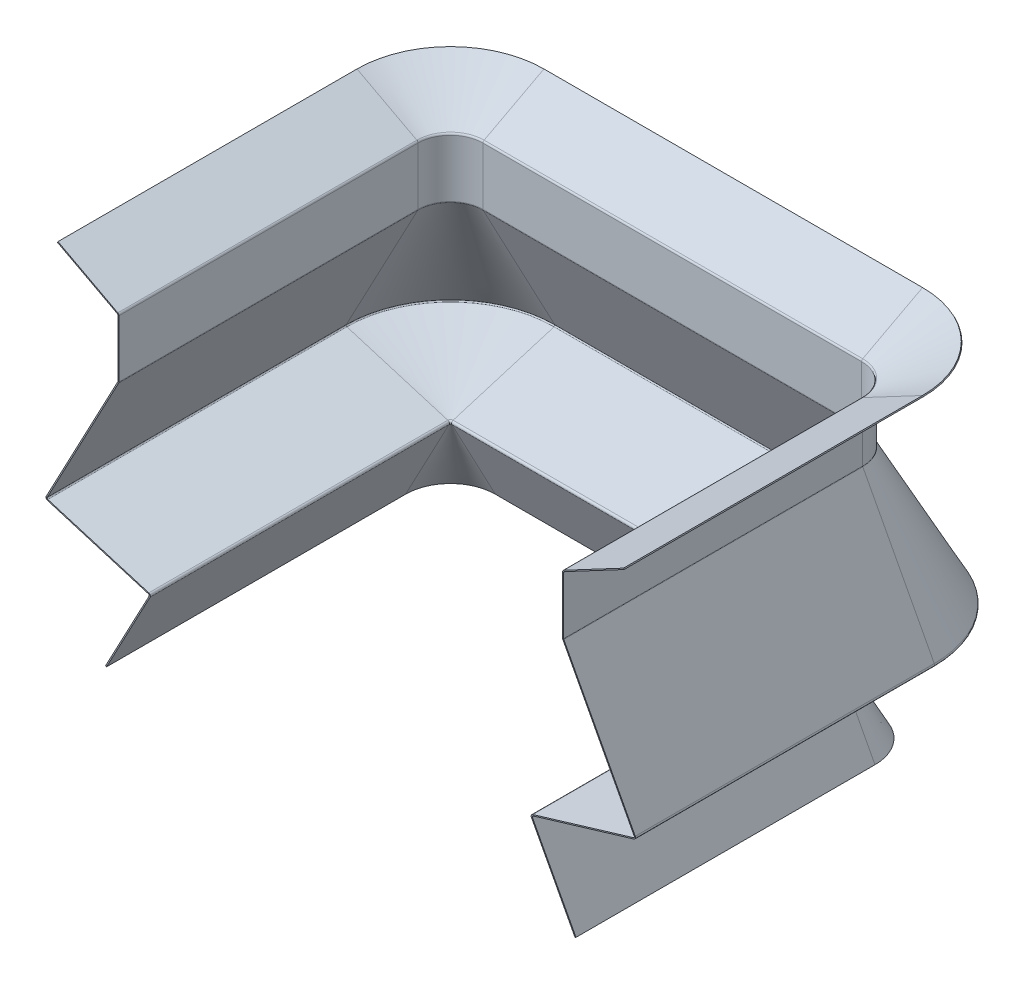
ISO-10303-21;
HEADER;
FILE_DESCRIPTION(('STEP AP214'),'2;1');
FILE_NAME('part.step','',(''),(''),'','','');
FILE_SCHEMA(('AUTOMOTIVE_DESIGN { 1 0 10303 214 1 1 1 1 }'));
ENDSEC;
DATA;
#1=APPLICATION_CONTEXT('core data for automotive mechanical design processes');
#2=APPLICATION_PROTOCOL_DEFINITION('international standard','automotive_design',2000,#1);
#3=PRODUCT_CONTEXT('',#1,'mechanical');
#4=PRODUCT('Part','Part','',(#3));
#5=PRODUCT_RELATED_PRODUCT_CATEGORY('part','',(#4));
#6=PRODUCT_DEFINITION_FORMATION('','',#4);
#7=PRODUCT_DEFINITION_CONTEXT('part definition',#1,'design');
#8=PRODUCT_DEFINITION('design','',#6,#7);
#9=PRODUCT_DEFINITION_SHAPE('','',#8);
#10=(LENGTH_UNIT() NAMED_UNIT(*) SI_UNIT(.MILLI.,.METRE.));
#11=(NAMED_UNIT(*) PLANE_ANGLE_UNIT() SI_UNIT($,.RADIAN.));
#12=(NAMED_UNIT(*) SI_UNIT($,.STERADIAN.) SOLID_ANGLE_UNIT());
#13=UNCERTAINTY_MEASURE_WITH_UNIT(LENGTH_MEASURE(1.E-05),#10,'distance_accuracy_value','');
#14=(GEOMETRIC_REPRESENTATION_CONTEXT(3) GLOBAL_UNCERTAINTY_ASSIGNED_CONTEXT((#13)) GLOBAL_UNIT_ASSIGNED_CONTEXT((#10,
#11,#12)) REPRESENTATION_CONTEXT('',''));
#15=CARTESIAN_POINT('',(0.,0.,0.));
#16=DIRECTION('',(0.,0.,1.));
#17=DIRECTION('',(1.,0.,0.));
#18=AXIS2_PLACEMENT_3D('',#15,#16,#17);
#19=CARTESIAN_POINT('',(419.842143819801,284.371861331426,0.));
#20=DIRECTION('',(0.,0.,-1.));
#21=DIRECTION('',(-1.,0.,0.));
#22=AXIS2_PLACEMENT_3D('',#19,#20,#21);
#23=PLANE('',#22);
#24=DIRECTION('',(0.468723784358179,-0.883344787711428,0.));
#25=VECTOR('',#24,1.);
#26=CARTESIAN_POINT('',(418.897196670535,286.152684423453,0.));
#27=LINE('',#26,#25);
#28=CARTESIAN_POINT('',(418.897196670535,286.152684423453,0.));
#29=VERTEX_POINT('',#28);
#30=CARTESIAN_POINT('',(419.365920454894,285.269339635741,0.));
#31=VERTEX_POINT('',#30);
#32=EDGE_CURVE('E11',#29,#31,#27,.T.);
#33=ORIENTED_EDGE('',*,*,#32,.F.);
#34=CARTESIAN_POINT('',(419.842143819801,284.371861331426,0.));
#35=DIRECTION('',(0.,0.,1.));
#36=DIRECTION('',(1.,0.,0.));
#37=AXIS2_PLACEMENT_3D('',#34,#35,#36);
#38=CIRCLE('',#37,2.016);
#39=CARTESIAN_POINT('',(417.826143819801,284.371861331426,0.));
#40=VERTEX_POINT('',#39);
#41=EDGE_CURVE('E360',#40,#29,#38,.F.);
#42=ORIENTED_EDGE('',*,*,#41,.F.);
#43=DIRECTION('',(1.,0.,0.));
#44=VECTOR('',#43,1.);
#45=CARTESIAN_POINT('',(417.826143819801,284.371861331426,0.));
#46=LINE('',#45,#44);
#47=CARTESIAN_POINT('',(418.826143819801,284.371861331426,0.));
#48=VERTEX_POINT('',#47);
#49=EDGE_CURVE('E47',#40,#48,#46,.T.);
#50=ORIENTED_EDGE('',*,*,#49,.T.);
#51=CARTESIAN_POINT('',(419.842143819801,284.371861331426,0.));
#52=DIRECTION('',(0.,0.,1.));
#53=DIRECTION('',(1.,0.,0.));
#54=AXIS2_PLACEMENT_3D('',#51,#52,#53);
#55=CIRCLE('',#54,1.016);
#56=EDGE_CURVE('E357',#48,#31,#55,.F.);
#57=ORIENTED_EDGE('',*,*,#56,.T.);
#58=EDGE_LOOP('',(#33,#42,#50,#57));
#59=FACE_BOUND('',#58,.T.);
#60=ADVANCED_FACE('F37',(#59),#23,.F.);
#61=CARTESIAN_POINT('',(417.826143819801,231.301302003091,0.));
#62=DIRECTION('',(0.,0.,-1.));
#63=DIRECTION('',(0.,1.,0.));
#64=AXIS2_PLACEMENT_3D('',#61,#62,#63);
#65=PLANE('',#64);
#66=ORIENTED_EDGE('',*,*,#49,.F.);
#67=DIRECTION('',(0.,1.,0.));
#68=VECTOR('',#67,1.);
#69=CARTESIAN_POINT('',(417.826143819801,231.301302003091,0.));
#70=LINE('',#69,#68);
#71=CARTESIAN_POINT('',(417.826143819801,231.803040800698,0.));
#72=VERTEX_POINT('',#71);
#73=EDGE_CURVE('E875',#72,#40,#70,.T.);
#74=ORIENTED_EDGE('',*,*,#73,.F.);
#75=DIRECTION('',(1.,0.,0.));
#76=VECTOR('',#75,1.);
#77=CARTESIAN_POINT('',(417.826143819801,231.803040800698,0.));
#78=LINE('',#77,#76);
#79=CARTESIAN_POINT('',(418.826143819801,231.803040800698,0.));
#80=VERTEX_POINT('',#79);
#81=EDGE_CURVE('E349',#72,#80,#78,.T.);
#82=ORIENTED_EDGE('',*,*,#81,.T.);
#83=DIRECTION('',(0.,1.,0.));
#84=VECTOR('',#83,1.);
#85=CARTESIAN_POINT('',(418.826143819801,231.301302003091,0.));
#86=LINE('',#85,#84);
#87=EDGE_CURVE('E378',#80,#48,#86,.T.);
#88=ORIENTED_EDGE('',*,*,#87,.T.);
#89=EDGE_LOOP('',(#66,#74,#82,#88));
#90=FACE_BOUND('',#89,.T.);
#91=ADVANCED_FACE('F379',(#90),#65,.F.);
#92=CARTESIAN_POINT('',(419.842143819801,231.803040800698,0.));
#93=DIRECTION('',(0.,0.,-1.));
#94=DIRECTION('',(-1.,0.,0.));
#95=AXIS2_PLACEMENT_3D('',#92,#93,#94);
#96=PLANE('',#95);
#97=ORIENTED_EDGE('',*,*,#81,.F.);
#98=CARTESIAN_POINT('',(419.842143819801,231.803040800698,0.));
#99=DIRECTION('',(0.,0.,1.));
#100=DIRECTION('',(1.,0.,0.));
#101=AXIS2_PLACEMENT_3D('',#98,#99,#100);
#102=CIRCLE('',#101,2.016);
#103=CARTESIAN_POINT('',(418.061320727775,230.858093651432,0.));
#104=VERTEX_POINT('',#103);
#105=EDGE_CURVE('E846',#104,#72,#102,.F.);
#106=ORIENTED_EDGE('',*,*,#105,.F.);
#107=DIRECTION('',(0.883344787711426,0.468723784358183,0.));
#108=VECTOR('',#107,1.);
#109=CARTESIAN_POINT('',(418.061320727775,230.858093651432,0.));
#110=LINE('',#109,#108);
#111=CARTESIAN_POINT('',(418.944665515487,231.326817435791,0.));
#112=VERTEX_POINT('',#111);
#113=EDGE_CURVE('E346',#104,#112,#110,.T.);
#114=ORIENTED_EDGE('',*,*,#113,.T.);
#115=CARTESIAN_POINT('',(419.842143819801,231.803040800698,0.));
#116=DIRECTION('',(0.,0.,1.));
#117=DIRECTION('',(1.,0.,0.));
#118=AXIS2_PLACEMENT_3D('',#115,#116,#117);
#119=CIRCLE('',#118,1.016);
#120=EDGE_CURVE('E400',#112,#80,#119,.F.);
#121=ORIENTED_EDGE('',*,*,#120,.T.);
#122=EDGE_LOOP('',(#97,#106,#114,#121));
#123=FACE_BOUND('',#122,.T.);
#124=ADVANCED_FACE('F1030',(#123),#96,.F.);
#125=CARTESIAN_POINT('',(484.136385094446,106.334726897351,0.));
#126=DIRECTION('',(0.,0.,-1.));
#127=DIRECTION('',(-0.468723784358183,0.883344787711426,0.));
#128=AXIS2_PLACEMENT_3D('',#125,#126,#127);
#129=PLANE('',#128);
#130=ORIENTED_EDGE('',*,*,#113,.F.);
#131=DIRECTION('',(-0.468723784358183,0.883344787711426,0.));
#132=VECTOR('',#131,1.);
#133=CARTESIAN_POINT('',(484.136385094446,106.334726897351,0.));
#134=LINE('',#133,#132);
#135=CARTESIAN_POINT('',(483.556704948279,107.427177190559,0.));
#136=VERTEX_POINT('',#135);
#137=EDGE_CURVE('E817',#136,#104,#134,.T.);
#138=ORIENTED_EDGE('',*,*,#137,.F.);
#139=DIRECTION('',(0.883344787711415,0.468723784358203,0.));
#140=VECTOR('',#139,1.);
#141=CARTESIAN_POINT('',(483.556704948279,107.427177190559,0.));
#142=LINE('',#141,#140);
#143=CARTESIAN_POINT('',(484.440049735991,107.895900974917,0.));
#144=VERTEX_POINT('',#143);
#145=EDGE_CURVE('E343',#136,#144,#142,.T.);
#146=ORIENTED_EDGE('',*,*,#145,.T.);
#147=DIRECTION('',(-0.468723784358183,0.883344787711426,0.));
#148=VECTOR('',#147,1.);
#149=CARTESIAN_POINT('',(485.019729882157,106.803450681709,0.));
#150=LINE('',#149,#148);
#151=EDGE_CURVE('E406',#144,#112,#150,.T.);
#152=ORIENTED_EDGE('',*,*,#151,.T.);
#153=EDGE_LOOP('',(#130,#138,#146,#152));
#154=FACE_BOUND('',#153,.T.);
#155=ADVANCED_FACE('F1039',(#154),#129,.F.);
#156=CARTESIAN_POINT('',(482.659226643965,106.950953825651,0.));
#157=DIRECTION('',(0.,0.,1.));
#158=DIRECTION('',(1.,0.,0.));
#159=AXIS2_PLACEMENT_3D('',#156,#157,#158);
#160=PLANE('',#159);
#161=ORIENTED_EDGE('',*,*,#145,.F.);
#162=CARTESIAN_POINT('',(482.659226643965,106.950953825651,0.));
#163=DIRECTION('',(0.,0.,-1.));
#164=DIRECTION('',(-1.,0.,0.));
#165=AXIS2_PLACEMENT_3D('',#162,#163,#164);
#166=CIRCLE('',#165,1.016);
#167=CARTESIAN_POINT('',(482.952197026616,105.978110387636,0.));
#168=VERTEX_POINT('',#167);
#169=EDGE_CURVE('E788',#168,#136,#166,.F.);
#170=ORIENTED_EDGE('',*,*,#169,.F.);
#171=DIRECTION('',(0.288356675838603,-0.957523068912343,0.));
#172=VECTOR('',#171,1.);
#173=CARTESIAN_POINT('',(482.952197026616,105.978110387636,0.));
#174=LINE('',#173,#172);
#175=CARTESIAN_POINT('',(483.240553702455,105.020587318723,0.));
#176=VERTEX_POINT('',#175);
#177=EDGE_CURVE('E340',#168,#176,#174,.T.);
#178=ORIENTED_EDGE('',*,*,#177,.T.);
#179=CARTESIAN_POINT('',(482.659226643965,106.950953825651,0.));
#180=DIRECTION('',(0.,0.,1.));
#181=DIRECTION('',(1.,0.,0.));
#182=AXIS2_PLACEMENT_3D('',#179,#180,#181);
#183=CIRCLE('',#182,2.016);
#184=EDGE_CURVE('E414',#176,#144,#183,.T.);
#185=ORIENTED_EDGE('',*,*,#184,.T.);
#186=EDGE_LOOP('',(#161,#170,#178,#185));
#187=FACE_BOUND('',#186,.T.);
#188=ADVANCED_FACE('F1314',(#187),#160,.T.);
#189=CARTESIAN_POINT('',(388.165315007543,77.433179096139,0.));
#190=DIRECTION('',(0.,0.,-1.));
#191=DIRECTION('',(0.957523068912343,0.288356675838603,0.));
#192=AXIS2_PLACEMENT_3D('',#189,#190,#191);
#193=PLANE('',#192);
#194=ORIENTED_EDGE('',*,*,#177,.F.);
#195=DIRECTION('',(0.957523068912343,0.288356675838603,0.));
#196=VECTOR('',#195,1.);
#197=CARTESIAN_POINT('',(388.165315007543,77.433179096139,0.));
#198=LINE('',#197,#196);
#199=CARTESIAN_POINT('',(390.515042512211,78.1407961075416,0.));
#200=VERTEX_POINT('',#199);
#201=EDGE_CURVE('E759',#200,#168,#198,.T.);
#202=ORIENTED_EDGE('',*,*,#201,.F.);
#203=DIRECTION('',(0.288356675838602,-0.957523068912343,0.));
#204=VECTOR('',#203,1.);
#205=CARTESIAN_POINT('',(390.515042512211,78.1407961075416,0.));
#206=LINE('',#205,#204);
#207=CARTESIAN_POINT('',(390.80339918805,77.1832730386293,0.));
#208=VERTEX_POINT('',#207);
#209=EDGE_CURVE('E337',#200,#208,#206,.T.);
#210=ORIENTED_EDGE('',*,*,#209,.T.);
#211=DIRECTION('',(0.957523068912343,0.288356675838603,0.));
#212=VECTOR('',#211,1.);
#213=CARTESIAN_POINT('',(388.453671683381,76.4756560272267,0.));
#214=LINE('',#213,#212);
#215=EDGE_CURVE('E422',#208,#176,#214,.T.);
#216=ORIENTED_EDGE('',*,*,#215,.T.);
#217=EDGE_LOOP('',(#194,#202,#210,#216));
#218=FACE_BOUND('',#217,.T.);
#219=ADVANCED_FACE('F1317',(#218),#193,.F.);
#220=CARTESIAN_POINT('',(391.096369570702,76.2104296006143,0.));
#221=DIRECTION('',(0.,0.,-1.));
#222=DIRECTION('',(-1.,0.,0.));
#223=AXIS2_PLACEMENT_3D('',#220,#221,#222);
#224=PLANE('',#223);
#225=ORIENTED_EDGE('',*,*,#209,.F.);
#226=CARTESIAN_POINT('',(391.096369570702,76.2104296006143,0.));
#227=DIRECTION('',(0.,0.,1.));
#228=DIRECTION('',(1.,0.,0.));
#229=AXIS2_PLACEMENT_3D('',#226,#227,#228);
#230=CIRCLE('',#229,2.016);
#231=CARTESIAN_POINT('',(389.315546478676,75.2654824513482,0.));
#232=VERTEX_POINT('',#231);
#233=EDGE_CURVE('E728',#232,#200,#230,.F.);
#234=ORIENTED_EDGE('',*,*,#233,.F.);
#235=DIRECTION('',(0.883344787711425,0.468723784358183,0.));
#236=VECTOR('',#235,1.);
#237=CARTESIAN_POINT('',(389.315546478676,75.2654824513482,0.));
#238=LINE('',#237,#236);
#239=CARTESIAN_POINT('',(390.198891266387,75.7342062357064,0.));
#240=VERTEX_POINT('',#239);
#241=EDGE_CURVE('E334',#232,#240,#238,.T.);
#242=ORIENTED_EDGE('',*,*,#241,.T.);
#243=CARTESIAN_POINT('',(391.096369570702,76.2104296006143,0.));
#244=DIRECTION('',(0.,0.,1.));
#245=DIRECTION('',(1.,0.,0.));
#246=AXIS2_PLACEMENT_3D('',#243,#244,#245);
#247=CIRCLE('',#246,1.016);
#248=EDGE_CURVE('E430',#240,#208,#247,.F.);
#249=ORIENTED_EDGE('',*,*,#248,.T.);
#250=EDGE_LOOP('',(#225,#234,#242,#249));
#251=FACE_BOUND('',#250,.T.);
#252=ADVANCED_FACE('F1321',(#251),#224,.F.);
#253=CARTESIAN_POINT('',(388.165315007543,77.433179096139,0.));
#254=DIRECTION('',(0.,0.,-1.));
#255=DIRECTION('',(-0.468723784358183,0.883344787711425,0.));
#256=AXIS2_PLACEMENT_3D('',#253,#254,#255);
#257=PLANE('',#256);
#258=ORIENTED_EDGE('',*,*,#241,.F.);
#259=DIRECTION('',(-0.468723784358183,0.883344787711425,0.));
#260=VECTOR('',#259,1.);
#261=CARTESIAN_POINT('',(388.165315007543,77.433179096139,0.));
#262=LINE('',#261,#260);
#263=CARTESIAN_POINT('',(429.253204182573,0.,0.));
#264=VERTEX_POINT('',#263);
#265=EDGE_CURVE('E722',#264,#232,#262,.T.);
#266=ORIENTED_EDGE('',*,*,#265,.F.);
#267=DIRECTION('',(0.883344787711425,0.468723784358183,0.));
#268=VECTOR('',#267,1.);
#269=CARTESIAN_POINT('',(429.253204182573,0.,0.));
#270=LINE('',#269,#268);
#271=CARTESIAN_POINT('',(430.136548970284,0.468723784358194,0.));
#272=VERTEX_POINT('',#271);
#273=EDGE_CURVE('E331',#264,#272,#270,.T.);
#274=ORIENTED_EDGE('',*,*,#273,.T.);
#275=DIRECTION('',(-0.468723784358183,0.883344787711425,0.));
#276=VECTOR('',#275,1.);
#277=CARTESIAN_POINT('',(389.048659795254,77.9019028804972,0.));
#278=LINE('',#277,#276);
#279=EDGE_CURVE('E438',#272,#240,#278,.T.);
#280=ORIENTED_EDGE('',*,*,#279,.T.);
#281=EDGE_LOOP('',(#258,#266,#274,#280));
#282=FACE_BOUND('',#281,.T.);
#283=ADVANCED_FACE('F1325',(#282),#257,.F.);
#284=CARTESIAN_POINT('',(429.253204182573,0.,-273.959087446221));
#285=DIRECTION('',(-0.468723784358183,0.883344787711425,0.));
#286=DIRECTION('',(0.,0.,1.));
#287=AXIS2_PLACEMENT_3D('',#284,#285,#286);
#288=PLANE('',#287);
#289=ORIENTED_EDGE('',*,*,#273,.F.);
#290=DIRECTION('',(0.,0.,1.));
#291=VECTOR('',#290,1.);
#292=CARTESIAN_POINT('',(429.253204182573,0.,-273.959087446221));
#293=LINE('',#292,#291);
#294=CARTESIAN_POINT('',(429.253204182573,0.,-273.959087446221));
#295=VERTEX_POINT('',#294);
#296=EDGE_CURVE('E268',#295,#264,#293,.T.);
#297=ORIENTED_EDGE('',*,*,#296,.F.);
#298=DIRECTION('',(0.883344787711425,0.468723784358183,0.));
#299=VECTOR('',#298,1.);
#300=CARTESIAN_POINT('',(429.253204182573,0.,-273.959087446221));
#301=LINE('',#300,#299);
#302=CARTESIAN_POINT('',(430.136548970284,0.468723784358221,-273.959087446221));
#303=VERTEX_POINT('',#302);
#304=EDGE_CURVE('E328',#295,#303,#301,.T.);
#305=ORIENTED_EDGE('',*,*,#304,.T.);
#306=DIRECTION('',(0.,0.,1.));
#307=VECTOR('',#306,1.);
#308=CARTESIAN_POINT('',(430.136548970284,0.468723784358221,-273.959087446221));
#309=LINE('',#308,#307);
#310=EDGE_CURVE('E626',#303,#272,#309,.T.);
#311=ORIENTED_EDGE('',*,*,#310,.T.);
#312=EDGE_LOOP('',(#289,#297,#305,#311));
#313=FACE_BOUND('',#312,.T.);
#314=ADVANCED_FACE('F1329',(#313),#288,.F.);
#315=CARTESIAN_POINT('',(388.064369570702,0.,-273.959087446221));
#316=DIRECTION('',(0.,1.,0.));
#317=DIRECTION('',(0.,0.,1.));
#318=AXIS2_PLACEMENT_3D('',#315,#316,#317);
#319=CONICAL_SURFACE('',#318,41.1888346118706,1.08295085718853);
#320=ORIENTED_EDGE('',*,*,#304,.F.);
#321=CARTESIAN_POINT('',(388.064369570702,0.,-273.959087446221));
#322=DIRECTION('',(0.,-1.,0.));
#323=DIRECTION('',(0.,0.,-1.));
#324=AXIS2_PLACEMENT_3D('',#321,#322,#323);
#325=CIRCLE('',#324,41.1888346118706);
#326=CARTESIAN_POINT('',(388.064369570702,0.,-315.147922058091));
#327=VERTEX_POINT('',#326);
#328=EDGE_CURVE('E716',#327,#295,#325,.T.);
#329=ORIENTED_EDGE('',*,*,#328,.F.);
#330=DIRECTION('',(0.,0.468723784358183,-0.883344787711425));
#331=VECTOR('',#330,1.);
#332=CARTESIAN_POINT('',(388.064369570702,0.,-315.147922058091));
#333=LINE('',#332,#331);
#334=CARTESIAN_POINT('',(388.064369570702,0.468723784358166,-316.031266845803));
#335=VERTEX_POINT('',#334);
#336=EDGE_CURVE('E325',#327,#335,#333,.T.);
#337=ORIENTED_EDGE('',*,*,#336,.T.);
#338=CARTESIAN_POINT('',(388.064369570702,0.468723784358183,-273.959087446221));
#339=DIRECTION('',(0.,-1.,0.));
#340=DIRECTION('',(0.,0.,-1.));
#341=AXIS2_PLACEMENT_3D('',#338,#339,#340);
#342=CIRCLE('',#341,42.072179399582);
#343=EDGE_CURVE('E446',#335,#303,#342,.T.);
#344=ORIENTED_EDGE('',*,*,#343,.T.);
#345=EDGE_LOOP('',(#320,#329,#337,#344));
#346=FACE_BOUND('',#345,.T.);
#347=ADVANCED_FACE('F1333',(#346),#319,.T.);
#348=CARTESIAN_POINT('',(41.1888346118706,0.,-315.147922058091));
#349=DIRECTION('',(0.,0.883344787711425,0.468723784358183));
#350=DIRECTION('',(1.,0.,0.));
#351=AXIS2_PLACEMENT_3D('',#348,#349,#350);
#352=PLANE('',#351);
#353=ORIENTED_EDGE('',*,*,#336,.F.);
#354=DIRECTION('',(1.,0.,0.));
#355=VECTOR('',#354,1.);
#356=CARTESIAN_POINT('',(41.1888346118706,0.,-315.147922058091));
#357=LINE('',#356,#355);
#358=CARTESIAN_POINT('',(41.1888346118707,0.,-315.147922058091));
#359=VERTEX_POINT('',#358);
#360=EDGE_CURVE('E706',#359,#327,#357,.T.);
#361=ORIENTED_EDGE('',*,*,#360,.F.);
#362=DIRECTION('',(0.,0.468723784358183,-0.883344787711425));
#363=VECTOR('',#362,1.);
#364=CARTESIAN_POINT('',(41.1888346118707,0.,-315.147922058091));
#365=LINE('',#364,#363);
#366=CARTESIAN_POINT('',(41.1888346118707,0.468723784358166,-316.031266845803));
#367=VERTEX_POINT('',#366);
#368=EDGE_CURVE('E322',#359,#367,#365,.T.);
#369=ORIENTED_EDGE('',*,*,#368,.T.);
#370=DIRECTION('',(1.,0.,0.));
#371=VECTOR('',#370,1.);
#372=CARTESIAN_POINT('',(41.1888346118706,0.468723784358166,-316.031266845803));
#373=LINE('',#372,#371);
#374=EDGE_CURVE('E548',#367,#335,#373,.T.);
#375=ORIENTED_EDGE('',*,*,#374,.T.);
#376=EDGE_LOOP('',(#353,#361,#369,#375));
#377=FACE_BOUND('',#376,.T.);
#378=ADVANCED_FACE('F1337',(#377),#352,.F.);
#379=CARTESIAN_POINT('',(41.1888346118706,0.,-273.959087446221));
#380=DIRECTION('',(0.,1.,0.));
#381=DIRECTION('',(0.,0.,1.));
#382=AXIS2_PLACEMENT_3D('',#379,#380,#381);
#383=CONICAL_SURFACE('',#382,41.1888346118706,1.08295085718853);
#384=ORIENTED_EDGE('',*,*,#368,.F.);
#385=CARTESIAN_POINT('',(41.1888346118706,0.,-273.959087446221));
#386=DIRECTION('',(0.,-1.,0.));
#387=DIRECTION('',(-1.,0.,0.));
#388=AXIS2_PLACEMENT_3D('',#385,#386,#387);
#389=CIRCLE('',#388,41.1888346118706);
#390=CARTESIAN_POINT('',(0.,0.,-273.959087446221));
#391=VERTEX_POINT('',#390);
#392=EDGE_CURVE('E696',#391,#359,#389,.T.);
#393=ORIENTED_EDGE('',*,*,#392,.F.);
#394=DIRECTION('',(-0.883344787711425,0.468723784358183,0.));
#395=VECTOR('',#394,1.);
#396=CARTESIAN_POINT('',(0.,0.,-273.959087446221));
#397=LINE('',#396,#395);
#398=CARTESIAN_POINT('',(-0.883344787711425,0.46872378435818,-273.959087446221));
#399=VERTEX_POINT('',#398);
#400=EDGE_CURVE('E319',#391,#399,#397,.T.);
#401=ORIENTED_EDGE('',*,*,#400,.T.);
#402=CARTESIAN_POINT('',(41.1888346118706,0.468723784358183,-273.959087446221));
#403=DIRECTION('',(0.,-1.,0.));
#404=DIRECTION('',(0.,0.,-1.));
#405=AXIS2_PLACEMENT_3D('',#402,#403,#404);
#406=CIRCLE('',#405,42.0721793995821);
#407=EDGE_CURVE('E552',#399,#367,#406,.T.);
#408=ORIENTED_EDGE('',*,*,#407,.T.);
#409=EDGE_LOOP('',(#384,#393,#401,#408));
#410=FACE_BOUND('',#409,.T.);
#411=ADVANCED_FACE('F1341',(#410),#383,.T.);
#412=CARTESIAN_POINT('',(0.,0.,0.));
#413=DIRECTION('',(0.468723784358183,0.883344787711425,0.));
#414=DIRECTION('',(0.,0.,-1.));
#415=AXIS2_PLACEMENT_3D('',#412,#413,#414);
#416=PLANE('',#415);
#417=ORIENTED_EDGE('',*,*,#400,.F.);
#418=DIRECTION('',(0.,0.,-1.));
#419=VECTOR('',#418,1.);
#420=CARTESIAN_POINT('',(0.,0.,0.));
#421=LINE('',#420,#419);
#422=CARTESIAN_POINT('',(0.,0.,0.));
#423=VERTEX_POINT('',#422);
#424=EDGE_CURVE('E686',#423,#391,#421,.T.);
#425=ORIENTED_EDGE('',*,*,#424,.F.);
#426=DIRECTION('',(-0.883344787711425,0.468723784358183,0.));
#427=VECTOR('',#426,1.);
#428=CARTESIAN_POINT('',(0.,0.,0.));
#429=LINE('',#428,#427);
#430=CARTESIAN_POINT('',(-0.883344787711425,0.46872378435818,0.));
#431=VERTEX_POINT('',#430);
#432=EDGE_CURVE('E316',#423,#431,#429,.T.);
#433=ORIENTED_EDGE('',*,*,#432,.T.);
#434=DIRECTION('',(0.,0.,1.));
#435=VECTOR('',#434,1.);
#436=CARTESIAN_POINT('',(-0.883344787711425,0.46872378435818,0.));
#437=LINE('',#436,#435);
#438=EDGE_CURVE('E621',#431,#399,#437,.F.);
#439=ORIENTED_EDGE('',*,*,#438,.T.);
#440=EDGE_LOOP('',(#417,#425,#433,#439));
#441=FACE_BOUND('',#440,.T.);
#442=ADVANCED_FACE('F1345',(#441),#416,.F.);
#443=CARTESIAN_POINT('',(41.0878891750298,77.433179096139,0.));
#444=DIRECTION('',(0.,0.,1.));
#445=DIRECTION('',(0.468723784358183,0.883344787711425,0.));
#446=AXIS2_PLACEMENT_3D('',#443,#444,#445);
#447=PLANE('',#446);
#448=ORIENTED_EDGE('',*,*,#432,.F.);
#449=DIRECTION('',(0.468723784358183,0.883344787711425,0.));
#450=VECTOR('',#449,1.);
#451=CARTESIAN_POINT('',(41.0878891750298,77.433179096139,0.));
#452=LINE('',#451,#450);
#453=CARTESIAN_POINT('',(39.9376577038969,75.2654824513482,0.));
#454=VERTEX_POINT('',#453);
#455=EDGE_CURVE('E678',#423,#454,#452,.T.);
#456=ORIENTED_EDGE('',*,*,#455,.T.);
#457=DIRECTION('',(-0.883344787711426,0.468723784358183,0.));
#458=VECTOR('',#457,1.);
#459=CARTESIAN_POINT('',(39.9376577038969,75.2654824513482,0.));
#460=LINE('',#459,#458);
#461=CARTESIAN_POINT('',(39.0543129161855,75.7342062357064,0.));
#462=VERTEX_POINT('',#461);
#463=EDGE_CURVE('E313',#454,#462,#460,.T.);
#464=ORIENTED_EDGE('',*,*,#463,.T.);
#465=DIRECTION('',(-0.468723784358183,-0.883344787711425,0.));
#466=VECTOR('',#465,1.);
#467=CARTESIAN_POINT('',(40.2045443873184,77.9019028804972,0.));
#468=LINE('',#467,#466);
#469=EDGE_CURVE('E274',#431,#462,#468,.F.);
#470=ORIENTED_EDGE('',*,*,#469,.F.);
#471=EDGE_LOOP('',(#448,#456,#464,#470));
#472=FACE_BOUND('',#471,.T.);
#473=ADVANCED_FACE('F1349',(#472),#447,.T.);
#474=CARTESIAN_POINT('',(38.1568346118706,76.2104296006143,0.));
#475=DIRECTION('',(0.,0.,1.));
#476=DIRECTION('',(1.,0.,0.));
#477=AXIS2_PLACEMENT_3D('',#474,#475,#476);
#478=PLANE('',#477);
#479=ORIENTED_EDGE('',*,*,#463,.F.);
#480=CARTESIAN_POINT('',(38.1568346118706,76.2104296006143,0.));
#481=DIRECTION('',(0.,0.,-1.));
#482=DIRECTION('',(-1.,0.,0.));
#483=AXIS2_PLACEMENT_3D('',#480,#481,#482);
#484=CIRCLE('',#483,2.016);
#485=CARTESIAN_POINT('',(38.7381616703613,78.1407961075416,0.));
#486=VERTEX_POINT('',#485);
#487=EDGE_CURVE('E681',#454,#486,#484,.F.);
#488=ORIENTED_EDGE('',*,*,#487,.T.);
#489=DIRECTION('',(-0.288356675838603,-0.957523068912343,0.));
#490=VECTOR('',#489,1.);
#491=CARTESIAN_POINT('',(38.7381616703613,78.1407961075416,0.));
#492=LINE('',#491,#490);
#493=CARTESIAN_POINT('',(38.4498049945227,77.1832730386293,0.));
#494=VERTEX_POINT('',#493);
#495=EDGE_CURVE('E310',#486,#494,#492,.T.);
#496=ORIENTED_EDGE('',*,*,#495,.T.);
#497=CARTESIAN_POINT('',(38.1568346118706,76.2104296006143,0.));
#498=DIRECTION('',(0.,0.,-1.));
#499=DIRECTION('',(-1.,0.,0.));
#500=AXIS2_PLACEMENT_3D('',#497,#498,#499);
#501=CIRCLE('',#500,1.016);
#502=EDGE_CURVE('E277',#462,#494,#501,.F.);
#503=ORIENTED_EDGE('',*,*,#502,.F.);
#504=EDGE_LOOP('',(#479,#488,#496,#503));
#505=FACE_BOUND('',#504,.T.);
#506=ADVANCED_FACE('F1128',(#505),#478,.T.);
#507=CARTESIAN_POINT('',(41.0878891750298,77.433179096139,0.));
#508=DIRECTION('',(0.,0.,1.));
#509=DIRECTION('',(-0.957523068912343,0.288356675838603,0.));
#510=AXIS2_PLACEMENT_3D('',#507,#508,#509);
#511=PLANE('',#510);
#512=ORIENTED_EDGE('',*,*,#495,.F.);
#513=DIRECTION('',(-0.957523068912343,0.288356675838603,0.));
#514=VECTOR('',#513,1.);
#515=CARTESIAN_POINT('',(41.0878891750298,77.433179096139,0.));
#516=LINE('',#515,#514);
#517=CARTESIAN_POINT('',(-53.698992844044,105.978110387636,0.));
#518=VERTEX_POINT('',#517);
#519=EDGE_CURVE('E733',#486,#518,#516,.T.);
#520=ORIENTED_EDGE('',*,*,#519,.T.);
#521=DIRECTION('',(-0.288356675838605,-0.957523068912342,0.));
#522=VECTOR('',#521,1.);
#523=CARTESIAN_POINT('',(-53.698992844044,105.978110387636,0.));
#524=LINE('',#523,#522);
#525=CARTESIAN_POINT('',(-53.9873495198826,105.020587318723,0.));
#526=VERTEX_POINT('',#525);
#527=EDGE_CURVE('E307',#518,#526,#524,.T.);
#528=ORIENTED_EDGE('',*,*,#527,.T.);
#529=DIRECTION('',(0.957523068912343,-0.288356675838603,0.));
#530=VECTOR('',#529,1.);
#531=CARTESIAN_POINT('',(40.7995324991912,76.4756560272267,0.));
#532=LINE('',#531,#530);
#533=EDGE_CURVE('E651',#494,#526,#532,.F.);
#534=ORIENTED_EDGE('',*,*,#533,.F.);
#535=EDGE_LOOP('',(#512,#520,#528,#534));
#536=FACE_BOUND('',#535,.T.);
#537=ADVANCED_FACE('F1133',(#536),#511,.T.);
#538=CARTESIAN_POINT('',(-53.4060224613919,106.950953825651,0.));
#539=DIRECTION('',(0.,0.,-1.));
#540=DIRECTION('',(-1.,0.,0.));
#541=AXIS2_PLACEMENT_3D('',#538,#539,#540);
#542=PLANE('',#541);
#543=ORIENTED_EDGE('',*,*,#527,.F.);
#544=CARTESIAN_POINT('',(-53.4060224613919,106.950953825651,0.));
#545=DIRECTION('',(0.,0.,1.));
#546=DIRECTION('',(1.,0.,0.));
#547=AXIS2_PLACEMENT_3D('',#544,#545,#546);
#548=CIRCLE('',#547,1.016);
#549=CARTESIAN_POINT('',(-54.3035007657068,107.427177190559,0.));
#550=VERTEX_POINT('',#549);
#551=EDGE_CURVE('E762',#518,#550,#548,.F.);
#552=ORIENTED_EDGE('',*,*,#551,.T.);
#553=DIRECTION('',(-0.883344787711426,0.468723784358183,0.));
#554=VECTOR('',#553,1.);
#555=CARTESIAN_POINT('',(-54.3035007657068,107.427177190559,0.));
#556=LINE('',#555,#554);
#557=CARTESIAN_POINT('',(-55.1868455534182,107.895900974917,0.));
#558=VERTEX_POINT('',#557);
#559=EDGE_CURVE('E304',#550,#558,#556,.T.);
#560=ORIENTED_EDGE('',*,*,#559,.T.);
#561=CARTESIAN_POINT('',(-53.4060224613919,106.950953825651,0.));
#562=DIRECTION('',(0.,0.,-1.));
#563=DIRECTION('',(-1.,0.,0.));
#564=AXIS2_PLACEMENT_3D('',#561,#562,#563);
#565=CIRCLE('',#564,2.016);
#566=EDGE_CURVE('E648',#526,#558,#565,.T.);
#567=ORIENTED_EDGE('',*,*,#566,.F.);
#568=EDGE_LOOP('',(#543,#552,#560,#567));
#569=FACE_BOUND('',#568,.T.);
#570=ADVANCED_FACE('F1186',(#569),#542,.F.);
#571=CARTESIAN_POINT('',(-54.8831809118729,106.334726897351,0.));
#572=DIRECTION('',(0.,0.,1.));
#573=DIRECTION('',(0.468723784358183,0.883344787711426,0.));
#574=AXIS2_PLACEMENT_3D('',#571,#572,#573);
#575=PLANE('',#574);
#576=ORIENTED_EDGE('',*,*,#559,.F.);
#577=DIRECTION('',(0.468723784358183,0.883344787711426,0.));
#578=VECTOR('',#577,1.);
#579=CARTESIAN_POINT('',(-54.8831809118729,106.334726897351,0.));
#580=LINE('',#579,#578);
#581=CARTESIAN_POINT('',(11.1918834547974,230.858093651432,0.));
#582=VERTEX_POINT('',#581);
#583=EDGE_CURVE('E791',#550,#582,#580,.T.);
#584=ORIENTED_EDGE('',*,*,#583,.T.);
#585=DIRECTION('',(-0.883344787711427,0.468723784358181,0.));
#586=VECTOR('',#585,1.);
#587=CARTESIAN_POINT('',(11.1918834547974,230.858093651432,0.));
#588=LINE('',#587,#586);
#589=CARTESIAN_POINT('',(10.3085386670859,231.32681743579,0.));
#590=VERTEX_POINT('',#589);
#591=EDGE_CURVE('E301',#582,#590,#588,.T.);
#592=ORIENTED_EDGE('',*,*,#591,.T.);
#593=DIRECTION('',(-0.468723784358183,-0.883344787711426,0.));
#594=VECTOR('',#593,1.);
#595=CARTESIAN_POINT('',(-55.7665256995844,106.803450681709,0.));
#596=LINE('',#595,#594);
#597=EDGE_CURVE('E645',#558,#590,#596,.F.);
#598=ORIENTED_EDGE('',*,*,#597,.F.);
#599=EDGE_LOOP('',(#576,#584,#592,#598));
#600=FACE_BOUND('',#599,.T.);
#601=ADVANCED_FACE('F1194',(#600),#575,.T.);
#602=CARTESIAN_POINT('',(9.4110603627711,231.803040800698,0.));
#603=DIRECTION('',(0.,0.,1.));
#604=DIRECTION('',(1.,0.,0.));
#605=AXIS2_PLACEMENT_3D('',#602,#603,#604);
#606=PLANE('',#605);
#607=ORIENTED_EDGE('',*,*,#591,.F.);
#608=CARTESIAN_POINT('',(9.4110603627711,231.803040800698,0.));
#609=DIRECTION('',(0.,0.,-1.));
#610=DIRECTION('',(-1.,0.,0.));
#611=AXIS2_PLACEMENT_3D('',#608,#609,#610);
#612=CIRCLE('',#611,2.016);
#613=CARTESIAN_POINT('',(11.4270603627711,231.803040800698,0.));
#614=VERTEX_POINT('',#613);
#615=EDGE_CURVE('E820',#582,#614,#612,.F.);
#616=ORIENTED_EDGE('',*,*,#615,.T.);
#617=DIRECTION('',(-1.,0.,0.));
#618=VECTOR('',#617,1.);
#619=CARTESIAN_POINT('',(11.4270603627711,231.803040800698,0.));
#620=LINE('',#619,#618);
#621=CARTESIAN_POINT('',(10.4270603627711,231.803040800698,0.));
#622=VERTEX_POINT('',#621);
#623=EDGE_CURVE('E298',#614,#622,#620,.T.);
#624=ORIENTED_EDGE('',*,*,#623,.T.);
#625=CARTESIAN_POINT('',(9.4110603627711,231.803040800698,0.));
#626=DIRECTION('',(0.,0.,-1.));
#627=DIRECTION('',(-1.,0.,0.));
#628=AXIS2_PLACEMENT_3D('',#625,#626,#627);
#629=CIRCLE('',#628,1.016);
#630=EDGE_CURVE('E642',#590,#622,#629,.F.);
#631=ORIENTED_EDGE('',*,*,#630,.F.);
#632=EDGE_LOOP('',(#607,#616,#624,#631));
#633=FACE_BOUND('',#632,.T.);
#634=ADVANCED_FACE('F1360',(#633),#606,.T.);
#635=CARTESIAN_POINT('',(11.4270603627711,231.301302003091,0.));
#636=DIRECTION('',(0.,0.,1.));
#637=DIRECTION('',(0.,1.,0.));
#638=AXIS2_PLACEMENT_3D('',#635,#636,#637);
#639=PLANE('',#638);
#640=ORIENTED_EDGE('',*,*,#623,.F.);
#641=DIRECTION('',(0.,1.,0.));
#642=VECTOR('',#641,1.);
#643=CARTESIAN_POINT('',(11.4270603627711,231.301302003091,0.));
#644=LINE('',#643,#642);
#645=CARTESIAN_POINT('',(11.4270603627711,284.371861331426,0.));
#646=VERTEX_POINT('',#645);
#647=EDGE_CURVE('E849',#614,#646,#644,.T.);
#648=ORIENTED_EDGE('',*,*,#647,.T.);
#649=DIRECTION('',(-1.,0.,0.));
#650=VECTOR('',#649,1.);
#651=CARTESIAN_POINT('',(11.4270603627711,284.371861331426,0.));
#652=LINE('',#651,#650);
#653=CARTESIAN_POINT('',(10.4270603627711,284.371861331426,0.));
#654=VERTEX_POINT('',#653);
#655=EDGE_CURVE('E295',#646,#654,#652,.T.);
#656=ORIENTED_EDGE('',*,*,#655,.T.);
#657=DIRECTION('',(0.,1.,0.));
#658=VECTOR('',#657,1.);
#659=CARTESIAN_POINT('',(10.4270603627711,231.301302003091,0.));
#660=LINE('',#659,#658);
#661=EDGE_CURVE('E639',#622,#654,#660,.T.);
#662=ORIENTED_EDGE('',*,*,#661,.F.);
#663=EDGE_LOOP('',(#640,#648,#656,#662));
#664=FACE_BOUND('',#663,.T.);
#665=ADVANCED_FACE('F1260',(#664),#639,.T.);
#666=CARTESIAN_POINT('',(9.41106036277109,284.371861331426,0.));
#667=DIRECTION('',(0.,0.,1.));
#668=DIRECTION('',(1.,0.,0.));
#669=AXIS2_PLACEMENT_3D('',#666,#667,#668);
#670=PLANE('',#669);
#671=ORIENTED_EDGE('',*,*,#655,.F.);
#672=CARTESIAN_POINT('',(9.41106036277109,284.371861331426,0.));
#673=DIRECTION('',(0.,0.,-1.));
#674=DIRECTION('',(-1.,0.,0.));
#675=AXIS2_PLACEMENT_3D('',#672,#673,#674);
#676=CIRCLE('',#675,2.016);
#677=CARTESIAN_POINT('',(10.3560075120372,286.152684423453,0.));
#678=VERTEX_POINT('',#677);
#679=EDGE_CURVE('E878',#646,#678,#676,.F.);
#680=ORIENTED_EDGE('',*,*,#679,.T.);
#681=DIRECTION('',(-0.468723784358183,-0.883344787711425,0.));
#682=VECTOR('',#681,1.);
#683=CARTESIAN_POINT('',(10.3560075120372,286.152684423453,0.));
#684=LINE('',#683,#682);
#685=CARTESIAN_POINT('',(9.88728372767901,285.269339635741,0.));
#686=VERTEX_POINT('',#685);
#687=EDGE_CURVE('E292',#678,#686,#684,.T.);
#688=ORIENTED_EDGE('',*,*,#687,.T.);
#689=CARTESIAN_POINT('',(9.41106036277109,284.371861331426,0.));
#690=DIRECTION('',(0.,0.,-1.));
#691=DIRECTION('',(-1.,0.,0.));
#692=AXIS2_PLACEMENT_3D('',#689,#690,#691);
#693=CIRCLE('',#692,1.016);
#694=EDGE_CURVE('E636',#654,#686,#693,.F.);
#695=ORIENTED_EDGE('',*,*,#694,.F.);
#696=EDGE_LOOP('',(#671,#680,#688,#695));
#697=FACE_BOUND('',#696,.T.);
#698=ADVANCED_FACE('F1262',(#697),#670,.T.);
#699=CARTESIAN_POINT('',(11.4270603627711,285.58435826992,0.));
#700=DIRECTION('',(0.,0.,1.));
#701=DIRECTION('',(-0.883344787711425,0.468723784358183,0.));
#702=AXIS2_PLACEMENT_3D('',#699,#700,#701);
#703=PLANE('',#702);
#704=ORIENTED_EDGE('',*,*,#687,.F.);
#705=DIRECTION('',(-0.883344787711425,0.468723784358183,0.));
#706=VECTOR('',#705,1.);
#707=CARTESIAN_POINT('',(11.4270603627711,285.58435826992,0.));
#708=LINE('',#707,#706);
#709=CARTESIAN_POINT('',(-44.4606958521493,315.239732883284,0.));
#710=VERTEX_POINT('',#709);
#711=EDGE_CURVE('E691',#678,#710,#708,.T.);
#712=ORIENTED_EDGE('',*,*,#711,.T.);
#713=DIRECTION('',(-0.468723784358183,-0.883344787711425,0.));
#714=VECTOR('',#713,1.);
#715=CARTESIAN_POINT('',(-44.4606958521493,315.239732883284,0.));
#716=LINE('',#715,#714);
#717=CARTESIAN_POINT('',(-44.9294196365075,314.356388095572,0.));
#718=VERTEX_POINT('',#717);
#719=EDGE_CURVE('E289',#710,#718,#716,.T.);
#720=ORIENTED_EDGE('',*,*,#719,.T.);
#721=DIRECTION('',(0.883344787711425,-0.468723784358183,0.));
#722=VECTOR('',#721,1.);
#723=CARTESIAN_POINT('',(10.9583365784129,284.701013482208,0.));
#724=LINE('',#723,#722);
#725=EDGE_CURVE('E633',#686,#718,#724,.F.);
#726=ORIENTED_EDGE('',*,*,#725,.F.);
#727=EDGE_LOOP('',(#704,#712,#720,#726));
#728=FACE_BOUND('',#727,.T.);
#729=ADVANCED_FACE('F960',(#728),#703,.T.);
#730=CARTESIAN_POINT('',(-44.4606958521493,315.239732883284,0.));
#731=DIRECTION('',(-0.883344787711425,0.468723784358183,0.));
#732=DIRECTION('',(0.,0.,-1.));
#733=AXIS2_PLACEMENT_3D('',#730,#731,#732);
#734=PLANE('',#733);
#735=ORIENTED_EDGE('',*,*,#719,.F.);
#736=DIRECTION('',(0.,0.,-1.));
#737=VECTOR('',#736,1.);
#738=CARTESIAN_POINT('',(-44.4606958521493,315.239732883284,0.));
#739=LINE('',#738,#737);
#740=CARTESIAN_POINT('',(-44.4606958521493,315.239732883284,-273.959087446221));
#741=VERTEX_POINT('',#740);
#742=EDGE_CURVE('E701',#710,#741,#739,.T.);
#743=ORIENTED_EDGE('',*,*,#742,.T.);
#744=DIRECTION('',(-0.468723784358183,-0.883344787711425,0.));
#745=VECTOR('',#744,1.);
#746=CARTESIAN_POINT('',(-44.4606958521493,315.239732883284,-273.959087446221));
#747=LINE('',#746,#745);
#748=CARTESIAN_POINT('',(-44.9294196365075,314.356388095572,-273.959087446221));
#749=VERTEX_POINT('',#748);
#750=EDGE_CURVE('E286',#741,#749,#747,.T.);
#751=ORIENTED_EDGE('',*,*,#750,.T.);
#752=DIRECTION('',(0.,0.,1.));
#753=VECTOR('',#752,1.);
#754=CARTESIAN_POINT('',(-44.9294196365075,314.356388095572,0.));
#755=LINE('',#754,#753);
#756=EDGE_CURVE('E601',#718,#749,#755,.F.);
#757=ORIENTED_EDGE('',*,*,#756,.F.);
#758=EDGE_LOOP('',(#735,#743,#751,#757));
#759=FACE_BOUND('',#758,.T.);
#760=ADVANCED_FACE('F953',(#759),#734,.T.);
#761=CARTESIAN_POINT('',(41.1888346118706,315.239732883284,-273.959087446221));
#762=DIRECTION('',(0.,-1.,0.));
#763=DIRECTION('',(0.,0.,-1.));
#764=AXIS2_PLACEMENT_3D('',#761,#762,#763);
#765=CONICAL_SURFACE('',#764,85.64953046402,0.487845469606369);
#766=ORIENTED_EDGE('',*,*,#750,.F.);
#767=CARTESIAN_POINT('',(41.1888346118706,315.239732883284,-273.959087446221));
#768=DIRECTION('',(0.,-1.,0.));
#769=DIRECTION('',(-1.,0.,0.));
#770=AXIS2_PLACEMENT_3D('',#767,#768,#769);
#771=CIRCLE('',#770,85.64953046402);
#772=CARTESIAN_POINT('',(41.1888346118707,315.239732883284,-359.608617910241));
#773=VERTEX_POINT('',#772);
#774=EDGE_CURVE('E711',#741,#773,#771,.T.);
#775=ORIENTED_EDGE('',*,*,#774,.T.);
#776=DIRECTION('',(0.,-0.883344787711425,-0.468723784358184));
#777=VECTOR('',#776,1.);
#778=CARTESIAN_POINT('',(41.1888346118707,315.239732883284,-359.608617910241));
#779=LINE('',#778,#777);
#780=CARTESIAN_POINT('',(41.1888346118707,314.356388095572,-360.077341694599));
#781=VERTEX_POINT('',#780);
#782=EDGE_CURVE('E283',#773,#781,#779,.T.);
#783=ORIENTED_EDGE('',*,*,#782,.T.);
#784=CARTESIAN_POINT('',(41.1888346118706,314.356388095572,-273.959087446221));
#785=DIRECTION('',(0.,1.,0.));
#786=DIRECTION('',(0.,0.,1.));
#787=AXIS2_PLACEMENT_3D('',#784,#785,#786);
#788=CIRCLE('',#787,86.1182542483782);
#789=EDGE_CURVE('E501',#749,#781,#788,.F.);
#790=ORIENTED_EDGE('',*,*,#789,.F.);
#791=EDGE_LOOP('',(#766,#775,#783,#790));
#792=FACE_BOUND('',#791,.T.);
#793=ADVANCED_FACE('F945',(#792),#765,.T.);
#794=CARTESIAN_POINT('',(41.1888346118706,315.239732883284,-359.608617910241));
#795=DIRECTION('',(0.,0.468723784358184,-0.883344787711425));
#796=DIRECTION('',(1.,0.,0.));
#797=AXIS2_PLACEMENT_3D('',#794,#795,#796);
#798=PLANE('',#797);
#799=ORIENTED_EDGE('',*,*,#782,.F.);
#800=DIRECTION('',(1.,0.,0.));
#801=VECTOR('',#800,1.);
#802=CARTESIAN_POINT('',(41.1888346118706,315.239732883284,-359.608617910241));
#803=LINE('',#802,#801);
#804=CARTESIAN_POINT('',(388.064369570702,315.239732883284,-359.608617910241));
#805=VERTEX_POINT('',#804);
#806=EDGE_CURVE('E721',#773,#805,#803,.T.);
#807=ORIENTED_EDGE('',*,*,#806,.T.);
#808=DIRECTION('',(0.,-0.883344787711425,-0.468723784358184));
#809=VECTOR('',#808,1.);
#810=CARTESIAN_POINT('',(388.064369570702,315.239732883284,-359.608617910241));
#811=LINE('',#810,#809);
#812=CARTESIAN_POINT('',(388.064369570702,314.356388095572,-360.077341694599));
#813=VERTEX_POINT('',#812);
#814=EDGE_CURVE('E249',#805,#813,#811,.T.);
#815=ORIENTED_EDGE('',*,*,#814,.T.);
#816=DIRECTION('',(1.,0.,0.));
#817=VECTOR('',#816,1.);
#818=CARTESIAN_POINT('',(41.1888346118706,314.356388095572,-360.077341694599));
#819=LINE('',#818,#817);
#820=EDGE_CURVE('E495',#781,#813,#819,.T.);
#821=ORIENTED_EDGE('',*,*,#820,.F.);
#822=EDGE_LOOP('',(#799,#807,#815,#821));
#823=FACE_BOUND('',#822,.T.);
#824=ADVANCED_FACE('F937',(#823),#798,.T.);
#825=CARTESIAN_POINT('',(388.064369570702,315.239732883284,-273.959087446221));
#826=DIRECTION('',(0.,-1.,0.));
#827=DIRECTION('',(0.,0.,-1.));
#828=AXIS2_PLACEMENT_3D('',#825,#826,#827);
#829=CONICAL_SURFACE('',#828,85.64953046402,0.487845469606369);
#830=ORIENTED_EDGE('',*,*,#814,.F.);
#831=CARTESIAN_POINT('',(388.064369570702,315.239732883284,-273.959087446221));
#832=DIRECTION('',(0.,-1.,0.));
#833=DIRECTION('',(0.,0.,-1.));
#834=AXIS2_PLACEMENT_3D('',#831,#832,#833);
#835=CIRCLE('',#834,85.64953046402);
#836=CARTESIAN_POINT('',(473.713900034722,315.239732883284,-273.959087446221));
#837=VERTEX_POINT('',#836);
#838=EDGE_CURVE('E257',#805,#837,#835,.T.);
#839=ORIENTED_EDGE('',*,*,#838,.T.);
#840=DIRECTION('',(0.468723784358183,-0.883344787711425,0.));
#841=VECTOR('',#840,1.);
#842=CARTESIAN_POINT('',(473.713900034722,315.239732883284,-273.959087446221));
#843=LINE('',#842,#841);
#844=CARTESIAN_POINT('',(474.18262381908,314.356388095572,-273.959087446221));
#845=VERTEX_POINT('',#844);
#846=EDGE_CURVE('E236',#837,#845,#843,.T.);
#847=ORIENTED_EDGE('',*,*,#846,.T.);
#848=CARTESIAN_POINT('',(388.064369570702,314.356388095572,-273.959087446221));
#849=DIRECTION('',(0.,1.,0.));
#850=DIRECTION('',(0.,0.,1.));
#851=AXIS2_PLACEMENT_3D('',#848,#849,#850);
#852=CIRCLE('',#851,86.1182542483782);
#853=EDGE_CURVE('E624',#813,#845,#852,.F.);
#854=ORIENTED_EDGE('',*,*,#853,.F.);
#855=EDGE_LOOP('',(#830,#839,#847,#854));
#856=FACE_BOUND('',#855,.T.);
#857=ADVANCED_FACE('F265',(#856),#829,.T.);
#858=CARTESIAN_POINT('',(473.713900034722,315.239732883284,-273.959087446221));
#859=DIRECTION('',(0.883344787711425,0.468723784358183,0.));
#860=DIRECTION('',(0.,0.,1.));
#861=AXIS2_PLACEMENT_3D('',#858,#859,#860);
#862=PLANE('',#861);
#863=ORIENTED_EDGE('',*,*,#846,.F.);
#864=DIRECTION('',(0.,0.,1.));
#865=VECTOR('',#864,1.);
#866=CARTESIAN_POINT('',(473.713900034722,315.239732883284,-273.959087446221));
#867=LINE('',#866,#865);
#868=CARTESIAN_POINT('',(473.713900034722,315.239732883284,0.));
#869=VERTEX_POINT('',#868);
#870=EDGE_CURVE('E240',#837,#869,#867,.T.);
#871=ORIENTED_EDGE('',*,*,#870,.T.);
#872=DIRECTION('',(0.468723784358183,-0.883344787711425,0.));
#873=VECTOR('',#872,1.);
#874=CARTESIAN_POINT('',(473.713900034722,315.239732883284,0.));
#875=LINE('',#874,#873);
#876=CARTESIAN_POINT('',(474.18262381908,314.356388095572,0.));
#877=VERTEX_POINT('',#876);
#878=EDGE_CURVE('E41',#869,#877,#875,.T.);
#879=ORIENTED_EDGE('',*,*,#878,.T.);
#880=DIRECTION('',(0.,0.,1.));
#881=VECTOR('',#880,1.);
#882=CARTESIAN_POINT('',(474.18262381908,314.356388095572,-273.959087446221));
#883=LINE('',#882,#881);
#884=EDGE_CURVE('E243',#845,#877,#883,.T.);
#885=ORIENTED_EDGE('',*,*,#884,.F.);
#886=EDGE_LOOP('',(#863,#871,#879,#885));
#887=FACE_BOUND('',#886,.T.);
#888=ADVANCED_FACE('F238',(#887),#862,.T.);
#889=CARTESIAN_POINT('',(417.826143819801,285.58435826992,0.));
#890=DIRECTION('',(0.,0.,-1.));
#891=DIRECTION('',(0.883344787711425,0.468723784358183,0.));
#892=AXIS2_PLACEMENT_3D('',#889,#890,#891);
#893=PLANE('',#892);
#894=DIRECTION('',(0.883344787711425,0.468723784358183,0.));
#895=VECTOR('',#894,1.);
#896=CARTESIAN_POINT('',(417.826143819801,285.58435826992,0.));
#897=LINE('',#896,#895);
#898=EDGE_CURVE('E273',#29,#869,#897,.T.);
#899=ORIENTED_EDGE('',*,*,#898,.F.);
#900=ORIENTED_EDGE('',*,*,#32,.T.);
#901=DIRECTION('',(0.883344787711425,0.468723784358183,0.));
#902=VECTOR('',#901,1.);
#903=CARTESIAN_POINT('',(418.29486760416,284.701013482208,0.));
#904=LINE('',#903,#902);
#905=EDGE_CURVE('E623',#31,#877,#904,.T.);
#906=ORIENTED_EDGE('',*,*,#905,.T.);
#907=ORIENTED_EDGE('',*,*,#878,.F.);
#908=EDGE_LOOP('',(#899,#900,#906,#907));
#909=FACE_BOUND('',#908,.T.);
#910=ADVANCED_FACE('F39',(#909),#893,.F.);
#911=CARTESIAN_POINT('',(418.29486760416,284.701013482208,-273.959087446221));
#912=DIRECTION('',(0.468723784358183,-0.883344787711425,0.));
#913=DIRECTION('',(0.883344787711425,0.468723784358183,0.));
#914=AXIS2_PLACEMENT_3D('',#911,#912,#913);
#915=PLANE('',#914);
#916=ORIENTED_EDGE('',*,*,#884,.T.);
#917=ORIENTED_EDGE('',*,*,#905,.F.);
#918=DIRECTION('',(0.,0.,1.));
#919=VECTOR('',#918,1.);
#920=CARTESIAN_POINT('',(419.365920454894,285.269339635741,-273.959087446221));
#921=LINE('',#920,#919);
#922=CARTESIAN_POINT('',(419.365920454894,285.269339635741,-273.959087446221));
#923=VERTEX_POINT('',#922);
#924=EDGE_CURVE('E375',#923,#31,#921,.T.);
#925=ORIENTED_EDGE('',*,*,#924,.F.);
#926=DIRECTION('',(0.883344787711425,0.468723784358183,0.));
#927=VECTOR('',#926,1.);
#928=CARTESIAN_POINT('',(418.29486760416,284.701013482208,-273.959087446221));
#929=LINE('',#928,#927);
#930=EDGE_CURVE('E392',#923,#845,#929,.T.);
#931=ORIENTED_EDGE('',*,*,#930,.T.);
#932=EDGE_LOOP('',(#916,#917,#925,#931));
#933=FACE_BOUND('',#932,.T.);
#934=ADVANCED_FACE('F1279',(#933),#915,.T.);
#935=CARTESIAN_POINT('',(419.842143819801,284.371861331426,-273.959087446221));
#936=DIRECTION('',(0.,0.,1.));
#937=DIRECTION('',(1.,0.,0.));
#938=AXIS2_PLACEMENT_3D('',#935,#936,#937);
#939=CYLINDRICAL_SURFACE('',#938,1.016);
#940=ORIENTED_EDGE('',*,*,#924,.T.);
#941=ORIENTED_EDGE('',*,*,#56,.F.);
#942=DIRECTION('',(0.,0.,-1.));
#943=VECTOR('',#942,1.);
#944=CARTESIAN_POINT('',(418.826143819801,284.371861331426,-273.959087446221));
#945=LINE('',#944,#943);
#946=CARTESIAN_POINT('',(418.826143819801,284.371861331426,-273.959087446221));
#947=VERTEX_POINT('',#946);
#948=EDGE_CURVE('E372',#947,#48,#945,.F.);
#949=ORIENTED_EDGE('',*,*,#948,.F.);
#950=CARTESIAN_POINT('',(419.842143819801,284.371861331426,-273.959087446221));
#951=DIRECTION('',(0.,0.,1.));
#952=DIRECTION('',(1.,0.,0.));
#953=AXIS2_PLACEMENT_3D('',#950,#951,#952);
#954=CIRCLE('',#953,1.016);
#955=EDGE_CURVE('E394',#947,#923,#954,.F.);
#956=ORIENTED_EDGE('',*,*,#955,.T.);
#957=EDGE_LOOP('',(#940,#941,#949,#956));
#958=FACE_BOUND('',#957,.T.);
#959=ADVANCED_FACE('F368',(#958),#939,.F.);
#960=CARTESIAN_POINT('',(418.826143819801,231.301302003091,-273.959087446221));
#961=DIRECTION('',(1.,0.,0.));
#962=DIRECTION('',(0.,0.,-1.));
#963=AXIS2_PLACEMENT_3D('',#960,#961,#962);
#964=PLANE('',#963);
#965=ORIENTED_EDGE('',*,*,#948,.T.);
#966=ORIENTED_EDGE('',*,*,#87,.F.);
#967=DIRECTION('',(0.,0.,1.));
#968=VECTOR('',#967,1.);
#969=CARTESIAN_POINT('',(418.826143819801,231.803040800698,-273.959087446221));
#970=LINE('',#969,#968);
#971=CARTESIAN_POINT('',(418.826143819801,231.803040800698,-273.959087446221));
#972=VERTEX_POINT('',#971);
#973=EDGE_CURVE('E383',#972,#80,#970,.T.);
#974=ORIENTED_EDGE('',*,*,#973,.F.);
#975=DIRECTION('',(0.,1.,0.));
#976=VECTOR('',#975,1.);
#977=CARTESIAN_POINT('',(418.826143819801,231.301302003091,-273.959087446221));
#978=LINE('',#977,#976);
#979=EDGE_CURVE('E388',#972,#947,#978,.T.);
#980=ORIENTED_EDGE('',*,*,#979,.T.);
#981=EDGE_LOOP('',(#965,#966,#974,#980));
#982=FACE_BOUND('',#981,.T.);
#983=ADVANCED_FACE('F386',(#982),#964,.T.);
#984=CARTESIAN_POINT('',(419.842143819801,231.803040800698,-273.959087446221));
#985=DIRECTION('',(0.,0.,1.));
#986=DIRECTION('',(1.,0.,0.));
#987=AXIS2_PLACEMENT_3D('',#984,#985,#986);
#988=CYLINDRICAL_SURFACE('',#987,1.016);
#989=ORIENTED_EDGE('',*,*,#973,.T.);
#990=ORIENTED_EDGE('',*,*,#120,.F.);
#991=DIRECTION('',(0.,0.,1.));
#992=VECTOR('',#991,1.);
#993=CARTESIAN_POINT('',(418.944665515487,231.326817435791,-273.959087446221));
#994=LINE('',#993,#992);
#995=CARTESIAN_POINT('',(418.944665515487,231.326817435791,-273.959087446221));
#996=VERTEX_POINT('',#995);
#997=EDGE_CURVE('E403',#996,#112,#994,.T.);
#998=ORIENTED_EDGE('',*,*,#997,.F.);
#999=CARTESIAN_POINT('',(419.842143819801,231.803040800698,-273.959087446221));
#1000=DIRECTION('',(0.,0.,1.));
#1001=DIRECTION('',(1.,0.,0.));
#1002=AXIS2_PLACEMENT_3D('',#999,#1000,#1001);
#1003=CIRCLE('',#1002,1.016);
#1004=EDGE_CURVE('E407',#996,#972,#1003,.F.);
#1005=ORIENTED_EDGE('',*,*,#1004,.T.);
#1006=EDGE_LOOP('',(#989,#990,#998,#1005));
#1007=FACE_BOUND('',#1006,.T.);
#1008=ADVANCED_FACE('F1035',(#1007),#988,.F.);
#1009=CARTESIAN_POINT('',(485.019729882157,106.803450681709,-273.959087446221));
#1010=DIRECTION('',(0.883344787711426,0.468723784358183,0.));
#1011=DIRECTION('',(-0.468723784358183,0.883344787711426,0.));
#1012=AXIS2_PLACEMENT_3D('',#1009,#1010,#1011);
#1013=PLANE('',#1012);
#1014=ORIENTED_EDGE('',*,*,#997,.T.);
#1015=ORIENTED_EDGE('',*,*,#151,.F.);
#1016=DIRECTION('',(0.,0.,1.));
#1017=VECTOR('',#1016,1.);
#1018=CARTESIAN_POINT('',(484.440049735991,107.895900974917,-273.959087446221));
#1019=LINE('',#1018,#1017);
#1020=CARTESIAN_POINT('',(484.440049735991,107.895900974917,-273.959087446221));
#1021=VERTEX_POINT('',#1020);
#1022=EDGE_CURVE('E411',#1021,#144,#1019,.T.);
#1023=ORIENTED_EDGE('',*,*,#1022,.F.);
#1024=DIRECTION('',(-0.468723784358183,0.883344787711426,0.));
#1025=VECTOR('',#1024,1.);
#1026=CARTESIAN_POINT('',(485.019729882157,106.803450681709,-273.959087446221));
#1027=LINE('',#1026,#1025);
#1028=EDGE_CURVE('E415',#1021,#996,#1027,.T.);
#1029=ORIENTED_EDGE('',*,*,#1028,.T.);
#1030=EDGE_LOOP('',(#1014,#1015,#1023,#1029));
#1031=FACE_BOUND('',#1030,.T.);
#1032=ADVANCED_FACE('F1042',(#1031),#1013,.T.);
#1033=CARTESIAN_POINT('',(482.659226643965,106.950953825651,-273.959087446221));
#1034=DIRECTION('',(0.,0.,1.));
#1035=DIRECTION('',(1.,0.,0.));
#1036=AXIS2_PLACEMENT_3D('',#1033,#1034,#1035);
#1037=CYLINDRICAL_SURFACE('',#1036,2.016);
#1038=ORIENTED_EDGE('',*,*,#1022,.T.);
#1039=ORIENTED_EDGE('',*,*,#184,.F.);
#1040=DIRECTION('',(0.,0.,1.));
#1041=VECTOR('',#1040,1.);
#1042=CARTESIAN_POINT('',(483.240553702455,105.020587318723,-273.959087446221));
#1043=LINE('',#1042,#1041);
#1044=CARTESIAN_POINT('',(483.240553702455,105.020587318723,-273.959087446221));
#1045=VERTEX_POINT('',#1044);
#1046=EDGE_CURVE('E419',#1045,#176,#1043,.T.);
#1047=ORIENTED_EDGE('',*,*,#1046,.F.);
#1048=CARTESIAN_POINT('',(482.659226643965,106.950953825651,-273.959087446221));
#1049=DIRECTION('',(0.,0.,1.));
#1050=DIRECTION('',(1.,0.,0.));
#1051=AXIS2_PLACEMENT_3D('',#1048,#1049,#1050);
#1052=CIRCLE('',#1051,2.016);
#1053=EDGE_CURVE('E423',#1045,#1021,#1052,.T.);
#1054=ORIENTED_EDGE('',*,*,#1053,.T.);
#1055=EDGE_LOOP('',(#1038,#1039,#1047,#1054));
#1056=FACE_BOUND('',#1055,.T.);
#1057=ADVANCED_FACE('F1062',(#1056),#1037,.T.);
#1058=CARTESIAN_POINT('',(388.453671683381,76.4756560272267,-273.959087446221));
#1059=DIRECTION('',(0.288356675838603,-0.957523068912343,0.));
#1060=DIRECTION('',(0.957523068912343,0.288356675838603,0.));
#1061=AXIS2_PLACEMENT_3D('',#1058,#1059,#1060);
#1062=PLANE('',#1061);
#1063=ORIENTED_EDGE('',*,*,#1046,.T.);
#1064=ORIENTED_EDGE('',*,*,#215,.F.);
#1065=DIRECTION('',(0.,0.,1.));
#1066=VECTOR('',#1065,1.);
#1067=CARTESIAN_POINT('',(390.80339918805,77.1832730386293,-273.959087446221));
#1068=LINE('',#1067,#1066);
#1069=CARTESIAN_POINT('',(390.80339918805,77.1832730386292,-273.959087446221));
#1070=VERTEX_POINT('',#1069);
#1071=EDGE_CURVE('E427',#1070,#208,#1068,.T.);
#1072=ORIENTED_EDGE('',*,*,#1071,.F.);
#1073=DIRECTION('',(0.957523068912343,0.288356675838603,0.));
#1074=VECTOR('',#1073,1.);
#1075=CARTESIAN_POINT('',(388.453671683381,76.4756560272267,-273.959087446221));
#1076=LINE('',#1075,#1074);
#1077=EDGE_CURVE('E431',#1070,#1045,#1076,.T.);
#1078=ORIENTED_EDGE('',*,*,#1077,.T.);
#1079=EDGE_LOOP('',(#1063,#1064,#1072,#1078));
#1080=FACE_BOUND('',#1079,.T.);
#1081=ADVANCED_FACE('F1068',(#1080),#1062,.T.);
#1082=CARTESIAN_POINT('',(391.096369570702,76.2104296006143,-273.959087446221));
#1083=DIRECTION('',(0.,0.,1.));
#1084=DIRECTION('',(1.,0.,0.));
#1085=AXIS2_PLACEMENT_3D('',#1082,#1083,#1084);
#1086=CYLINDRICAL_SURFACE('',#1085,1.016);
#1087=ORIENTED_EDGE('',*,*,#1071,.T.);
#1088=ORIENTED_EDGE('',*,*,#248,.F.);
#1089=DIRECTION('',(0.,0.,1.));
#1090=VECTOR('',#1089,1.);
#1091=CARTESIAN_POINT('',(390.198891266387,75.7342062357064,-273.959087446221));
#1092=LINE('',#1091,#1090);
#1093=CARTESIAN_POINT('',(390.198891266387,75.7342062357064,-273.959087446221));
#1094=VERTEX_POINT('',#1093);
#1095=EDGE_CURVE('E435',#1094,#240,#1092,.T.);
#1096=ORIENTED_EDGE('',*,*,#1095,.F.);
#1097=CARTESIAN_POINT('',(391.096369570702,76.2104296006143,-273.959087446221));
#1098=DIRECTION('',(0.,0.,1.));
#1099=DIRECTION('',(1.,0.,0.));
#1100=AXIS2_PLACEMENT_3D('',#1097,#1098,#1099);
#1101=CIRCLE('',#1100,1.016);
#1102=EDGE_CURVE('E439',#1094,#1070,#1101,.F.);
#1103=ORIENTED_EDGE('',*,*,#1102,.T.);
#1104=EDGE_LOOP('',(#1087,#1088,#1096,#1103));
#1105=FACE_BOUND('',#1104,.T.);
#1106=ADVANCED_FACE('F1084',(#1105),#1086,.F.);
#1107=CARTESIAN_POINT('',(389.048659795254,77.9019028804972,-273.959087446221));
#1108=DIRECTION('',(0.883344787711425,0.468723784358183,0.));
#1109=DIRECTION('',(-0.468723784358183,0.883344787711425,0.));
#1110=AXIS2_PLACEMENT_3D('',#1107,#1108,#1109);
#1111=PLANE('',#1110);
#1112=ORIENTED_EDGE('',*,*,#1095,.T.);
#1113=ORIENTED_EDGE('',*,*,#279,.F.);
#1114=ORIENTED_EDGE('',*,*,#310,.F.);
#1115=DIRECTION('',(-0.468723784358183,0.883344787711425,0.));
#1116=VECTOR('',#1115,1.);
#1117=CARTESIAN_POINT('',(389.048659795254,77.9019028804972,-273.959087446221));
#1118=LINE('',#1117,#1116);
#1119=EDGE_CURVE('E443',#303,#1094,#1118,.T.);
#1120=ORIENTED_EDGE('',*,*,#1119,.T.);
#1121=EDGE_LOOP('',(#1112,#1113,#1114,#1120));
#1122=FACE_BOUND('',#1121,.T.);
#1123=ADVANCED_FACE('F1089',(#1122),#1111,.T.);
#1124=CARTESIAN_POINT('',(388.064369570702,285.269339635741,-273.959087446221));
#1125=DIRECTION('',(0.,1.,0.));
#1126=DIRECTION('',(0.,0.,1.));
#1127=AXIS2_PLACEMENT_3D('',#1124,#1125,#1126);
#1128=CONICAL_SURFACE('',#1127,31.3015508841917,1.08295085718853);
#1129=ORIENTED_EDGE('',*,*,#853,.T.);
#1130=ORIENTED_EDGE('',*,*,#930,.F.);
#1131=CARTESIAN_POINT('',(388.064369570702,285.269339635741,-273.959087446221));
#1132=DIRECTION('',(0.,-1.,0.));
#1133=DIRECTION('',(0.,0.,-1.));
#1134=AXIS2_PLACEMENT_3D('',#1131,#1132,#1133);
#1135=CIRCLE('',#1134,31.3015508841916);
#1136=CARTESIAN_POINT('',(388.064369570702,285.269339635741,-305.260638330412));
#1137=VERTEX_POINT('',#1136);
#1138=EDGE_CURVE('E396',#1137,#923,#1135,.T.);
#1139=ORIENTED_EDGE('',*,*,#1138,.F.);
#1140=DIRECTION('',(0.,0.468723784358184,-0.883344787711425));
#1141=VECTOR('',#1140,1.);
#1142=CARTESIAN_POINT('',(388.064369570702,285.269339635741,-305.260638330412));
#1143=LINE('',#1142,#1141);
#1144=EDGE_CURVE('E492',#1137,#813,#1143,.T.);
#1145=ORIENTED_EDGE('',*,*,#1144,.T.);
#1146=EDGE_LOOP('',(#1129,#1130,#1139,#1145));
#1147=FACE_BOUND('',#1146,.T.);
#1148=ADVANCED_FACE('F1281',(#1147),#1128,.T.);
#1149=CARTESIAN_POINT('',(388.064369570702,284.371861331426,-273.959087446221));
#1150=DIRECTION('',(0.,-1.,0.));
#1151=DIRECTION('',(0.,0.,-1.));
#1152=AXIS2_PLACEMENT_3D('',#1149,#1150,#1151);
#1153=TOROIDAL_SURFACE('',#1152,31.7777742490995,1.016);
#1154=ORIENTED_EDGE('',*,*,#1138,.T.);
#1155=ORIENTED_EDGE('',*,*,#955,.F.);
#1156=CARTESIAN_POINT('',(388.064369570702,284.371861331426,-273.959087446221));
#1157=DIRECTION('',(0.,-1.,0.));
#1158=DIRECTION('',(0.,0.,-1.));
#1159=AXIS2_PLACEMENT_3D('',#1156,#1157,#1158);
#1160=CIRCLE('',#1159,30.7617742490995);
#1161=CARTESIAN_POINT('',(388.064369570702,284.371861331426,-304.72086169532));
#1162=VERTEX_POINT('',#1161);
#1163=EDGE_CURVE('E397',#1162,#947,#1160,.T.);
#1164=ORIENTED_EDGE('',*,*,#1163,.F.);
#1165=CARTESIAN_POINT('',(388.064369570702,284.371861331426,-305.73686169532));
#1166=DIRECTION('',(-1.,0.,0.));
#1167=DIRECTION('',(0.,0.,1.));
#1168=AXIS2_PLACEMENT_3D('',#1165,#1166,#1167);
#1169=CIRCLE('',#1168,1.016);
#1170=EDGE_CURVE('E488',#1162,#1137,#1169,.T.);
#1171=ORIENTED_EDGE('',*,*,#1170,.T.);
#1172=EDGE_LOOP('',(#1154,#1155,#1164,#1171));
#1173=FACE_BOUND('',#1172,.T.);
#1174=ADVANCED_FACE('F1284',(#1173),#1153,.F.);
#1175=CARTESIAN_POINT('',(388.064369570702,0.,-273.959087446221));
#1176=DIRECTION('',(0.,-1.,0.));
#1177=DIRECTION('',(0.,0.,-1.));
#1178=AXIS2_PLACEMENT_3D('',#1175,#1176,#1177);
#1179=CYLINDRICAL_SURFACE('',#1178,30.7617742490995);
#1180=ORIENTED_EDGE('',*,*,#1163,.T.);
#1181=ORIENTED_EDGE('',*,*,#979,.F.);
#1182=CARTESIAN_POINT('',(388.064369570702,231.803040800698,-273.959087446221));
#1183=DIRECTION('',(0.,-1.,0.));
#1184=DIRECTION('',(0.,0.,-1.));
#1185=AXIS2_PLACEMENT_3D('',#1182,#1183,#1184);
#1186=CIRCLE('',#1185,30.7617742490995);
#1187=CARTESIAN_POINT('',(388.064369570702,231.803040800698,-304.72086169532));
#1188=VERTEX_POINT('',#1187);
#1189=EDGE_CURVE('E402',#1188,#972,#1186,.T.);
#1190=ORIENTED_EDGE('',*,*,#1189,.F.);
#1191=DIRECTION('',(0.,-1.,0.));
#1192=VECTOR('',#1191,1.);
#1193=CARTESIAN_POINT('',(388.064369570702,0.,-304.72086169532));
#1194=LINE('',#1193,#1192);
#1195=EDGE_CURVE('E482',#1188,#1162,#1194,.F.);
#1196=ORIENTED_EDGE('',*,*,#1195,.T.);
#1197=EDGE_LOOP('',(#1180,#1181,#1190,#1196));
#1198=FACE_BOUND('',#1197,.T.);
#1199=ADVANCED_FACE('F2361',(#1198),#1179,.T.);
#1200=CARTESIAN_POINT('',(388.064369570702,231.803040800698,-273.959087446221));
#1201=DIRECTION('',(0.,-1.,0.));
#1202=DIRECTION('',(0.,0.,-1.));
#1203=AXIS2_PLACEMENT_3D('',#1200,#1201,#1202);
#1204=TOROIDAL_SURFACE('',#1203,31.7777742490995,1.016);
#1205=ORIENTED_EDGE('',*,*,#1189,.T.);
#1206=ORIENTED_EDGE('',*,*,#1004,.F.);
#1207=CARTESIAN_POINT('',(388.064369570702,231.32681743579,-273.959087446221));
#1208=DIRECTION('',(0.,-1.,0.));
#1209=DIRECTION('',(0.,0.,-1.));
#1210=AXIS2_PLACEMENT_3D('',#1207,#1208,#1209);
#1211=CIRCLE('',#1210,30.8802959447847);
#1212=CARTESIAN_POINT('',(388.064369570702,231.326817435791,-304.839383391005));
#1213=VERTEX_POINT('',#1212);
#1214=EDGE_CURVE('E410',#1213,#996,#1211,.T.);
#1215=ORIENTED_EDGE('',*,*,#1214,.F.);
#1216=CARTESIAN_POINT('',(388.064369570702,231.803040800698,-305.73686169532));
#1217=DIRECTION('',(-1.,0.,0.));
#1218=DIRECTION('',(0.,0.,1.));
#1219=AXIS2_PLACEMENT_3D('',#1216,#1217,#1218);
#1220=CIRCLE('',#1219,1.016);
#1221=EDGE_CURVE('E476',#1213,#1188,#1220,.T.);
#1222=ORIENTED_EDGE('',*,*,#1221,.T.);
#1223=EDGE_LOOP('',(#1205,#1206,#1215,#1222));
#1224=FACE_BOUND('',#1223,.T.);
#1225=ADVANCED_FACE('F1273',(#1224),#1204,.F.);
#1226=CARTESIAN_POINT('',(388.064369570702,107.895900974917,-273.959087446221));
#1227=DIRECTION('',(0.,-1.,0.));
#1228=DIRECTION('',(0.,0.,-1.));
#1229=AXIS2_PLACEMENT_3D('',#1226,#1227,#1228);
#1230=CONICAL_SURFACE('',#1229,96.3756801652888,0.487845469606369);
#1231=ORIENTED_EDGE('',*,*,#1214,.T.);
#1232=ORIENTED_EDGE('',*,*,#1028,.F.);
#1233=CARTESIAN_POINT('',(388.064369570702,107.895900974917,-273.959087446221));
#1234=DIRECTION('',(0.,-1.,0.));
#1235=DIRECTION('',(0.,0.,-1.));
#1236=AXIS2_PLACEMENT_3D('',#1233,#1234,#1235);
#1237=CIRCLE('',#1236,96.3756801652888);
#1238=CARTESIAN_POINT('',(388.064369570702,107.895900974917,-370.33476761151));
#1239=VERTEX_POINT('',#1238);
#1240=EDGE_CURVE('E418',#1239,#1021,#1237,.T.);
#1241=ORIENTED_EDGE('',*,*,#1240,.F.);
#1242=DIRECTION('',(0.,-0.883344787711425,-0.468723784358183));
#1243=VECTOR('',#1242,1.);
#1244=CARTESIAN_POINT('',(388.064369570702,107.895900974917,-370.33476761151));
#1245=LINE('',#1244,#1243);
#1246=EDGE_CURVE('E470',#1239,#1213,#1245,.F.);
#1247=ORIENTED_EDGE('',*,*,#1246,.T.);
#1248=EDGE_LOOP('',(#1231,#1232,#1241,#1247));
#1249=FACE_BOUND('',#1248,.T.);
#1250=ADVANCED_FACE('F1049',(#1249),#1230,.T.);
#1251=CARTESIAN_POINT('',(388.064369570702,106.950953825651,-273.959087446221));
#1252=DIRECTION('',(0.,-1.,0.));
#1253=DIRECTION('',(0.,0.,-1.));
#1254=AXIS2_PLACEMENT_3D('',#1251,#1252,#1253);
#1255=TOROIDAL_SURFACE('',#1254,94.5948570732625,2.016);
#1256=ORIENTED_EDGE('',*,*,#1240,.T.);
#1257=ORIENTED_EDGE('',*,*,#1053,.F.);
#1258=CARTESIAN_POINT('',(388.064369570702,105.020587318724,-273.959087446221));
#1259=DIRECTION('',(0.,1.,0.));
#1260=DIRECTION('',(0.,0.,1.));
#1261=AXIS2_PLACEMENT_3D('',#1258,#1259,#1260);
#1262=CIRCLE('',#1261,95.1761841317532);
#1263=CARTESIAN_POINT('',(388.064369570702,105.020587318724,-369.135271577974));
#1264=VERTEX_POINT('',#1263);
#1265=EDGE_CURVE('E426',#1264,#1045,#1262,.F.);
#1266=ORIENTED_EDGE('',*,*,#1265,.F.);
#1267=CARTESIAN_POINT('',(388.064369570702,106.950953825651,-368.553944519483));
#1268=DIRECTION('',(-1.,0.,0.));
#1269=DIRECTION('',(0.,0.,1.));
#1270=AXIS2_PLACEMENT_3D('',#1267,#1268,#1269);
#1271=CIRCLE('',#1270,2.016);
#1272=EDGE_CURVE('E464',#1264,#1239,#1271,.F.);
#1273=ORIENTED_EDGE('',*,*,#1272,.T.);
#1274=EDGE_LOOP('',(#1256,#1257,#1266,#1273));
#1275=FACE_BOUND('',#1274,.T.);
#1276=ADVANCED_FACE('F1057',(#1275),#1255,.T.);
#1277=CARTESIAN_POINT('',(388.064369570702,77.1832730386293,-273.959087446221));
#1278=DIRECTION('',(0.,1.,0.));
#1279=DIRECTION('',(0.,0.,1.));
#1280=AXIS2_PLACEMENT_3D('',#1277,#1278,#1279);
#1281=CONICAL_SURFACE('',#1280,2.73902961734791,1.27828615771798);
#1282=ORIENTED_EDGE('',*,*,#1265,.T.);
#1283=ORIENTED_EDGE('',*,*,#1077,.F.);
#1284=CARTESIAN_POINT('',(388.064369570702,77.1832730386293,-273.959087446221));
#1285=DIRECTION('',(0.,-1.,0.));
#1286=DIRECTION('',(0.,0.,-1.));
#1287=AXIS2_PLACEMENT_3D('',#1284,#1285,#1286);
#1288=CIRCLE('',#1287,2.73902961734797);
#1289=CARTESIAN_POINT('',(388.064369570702,77.1832730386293,-276.698117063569));
#1290=VERTEX_POINT('',#1289);
#1291=EDGE_CURVE('E434',#1290,#1070,#1288,.T.);
#1292=ORIENTED_EDGE('',*,*,#1291,.F.);
#1293=DIRECTION('',(0.,0.288356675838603,-0.957523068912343));
#1294=VECTOR('',#1293,1.);
#1295=CARTESIAN_POINT('',(388.064369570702,77.1832730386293,-276.698117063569));
#1296=LINE('',#1295,#1294);
#1297=EDGE_CURVE('E458',#1290,#1264,#1296,.T.);
#1298=ORIENTED_EDGE('',*,*,#1297,.T.);
#1299=EDGE_LOOP('',(#1282,#1283,#1292,#1298));
#1300=FACE_BOUND('',#1299,.T.);
#1301=ADVANCED_FACE('F1073',(#1300),#1281,.T.);
#1302=CARTESIAN_POINT('',(388.064369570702,76.2104296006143,-273.959087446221));
#1303=DIRECTION('',(0.,-1.,0.));
#1304=DIRECTION('',(0.,0.,-1.));
#1305=AXIS2_PLACEMENT_3D('',#1302,#1303,#1304);
#1306=TOROIDAL_SURFACE('',#1305,3.03199999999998,1.016);
#1307=ORIENTED_EDGE('',*,*,#1291,.T.);
#1308=ORIENTED_EDGE('',*,*,#1102,.F.);
#1309=CARTESIAN_POINT('',(388.064369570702,75.7342062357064,-273.959087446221));
#1310=DIRECTION('',(0.,-1.,0.));
#1311=DIRECTION('',(0.,0.,-1.));
#1312=AXIS2_PLACEMENT_3D('',#1309,#1310,#1311);
#1313=CIRCLE('',#1312,2.13452169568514);
#1314=CARTESIAN_POINT('',(388.064369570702,75.7342062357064,-276.093609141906));
#1315=VERTEX_POINT('',#1314);
#1316=EDGE_CURVE('E442',#1315,#1094,#1313,.T.);
#1317=ORIENTED_EDGE('',*,*,#1316,.F.);
#1318=CARTESIAN_POINT('',(388.064369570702,76.2104296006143,-276.991087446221));
#1319=DIRECTION('',(-1.,0.,0.));
#1320=DIRECTION('',(0.,0.,1.));
#1321=AXIS2_PLACEMENT_3D('',#1318,#1319,#1320);
#1322=CIRCLE('',#1321,1.016);
#1323=EDGE_CURVE('E451',#1315,#1290,#1322,.T.);
#1324=ORIENTED_EDGE('',*,*,#1323,.T.);
#1325=EDGE_LOOP('',(#1307,#1308,#1317,#1324));
#1326=FACE_BOUND('',#1325,.T.);
#1327=ADVANCED_FACE('F1079',(#1326),#1306,.F.);
#1328=CARTESIAN_POINT('',(388.064369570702,0.468723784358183,-273.959087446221));
#1329=DIRECTION('',(0.,-1.,0.));
#1330=DIRECTION('',(0.,0.,-1.));
#1331=AXIS2_PLACEMENT_3D('',#1328,#1329,#1330);
#1332=CONICAL_SURFACE('',#1331,42.072179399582,0.487845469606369);
#1333=ORIENTED_EDGE('',*,*,#1316,.T.);
#1334=ORIENTED_EDGE('',*,*,#1119,.F.);
#1335=ORIENTED_EDGE('',*,*,#343,.F.);
#1336=DIRECTION('',(0.,-0.883344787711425,-0.468723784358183));
#1337=VECTOR('',#1336,1.);
#1338=CARTESIAN_POINT('',(388.064369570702,0.468723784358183,-316.031266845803));
#1339=LINE('',#1338,#1337);
#1340=EDGE_CURVE('E541',#335,#1315,#1339,.F.);
#1341=ORIENTED_EDGE('',*,*,#1340,.T.);
#1342=EDGE_LOOP('',(#1333,#1334,#1335,#1341));
#1343=FACE_BOUND('',#1342,.T.);
#1344=ADVANCED_FACE('F1094',(#1343),#1332,.T.);
#1345=CARTESIAN_POINT('',(41.1888346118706,284.701013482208,-304.189585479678));
#1346=DIRECTION('',(0.,-0.883344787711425,-0.468723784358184));
#1347=DIRECTION('',(0.,0.468723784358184,-0.883344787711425));
#1348=AXIS2_PLACEMENT_3D('',#1345,#1346,#1347);
#1349=PLANE('',#1348);
#1350=ORIENTED_EDGE('',*,*,#820,.T.);
#1351=ORIENTED_EDGE('',*,*,#1144,.F.);
#1352=DIRECTION('',(1.,0.,0.));
#1353=VECTOR('',#1352,1.);
#1354=CARTESIAN_POINT('',(41.1888346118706,285.269339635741,-305.260638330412));
#1355=LINE('',#1354,#1353);
#1356=CARTESIAN_POINT('',(41.1888346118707,285.269339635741,-305.260638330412));
#1357=VERTEX_POINT('',#1356);
#1358=EDGE_CURVE('E491',#1357,#1137,#1355,.T.);
#1359=ORIENTED_EDGE('',*,*,#1358,.F.);
#1360=DIRECTION('',(0.,0.468723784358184,-0.883344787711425));
#1361=VECTOR('',#1360,1.);
#1362=CARTESIAN_POINT('',(41.1888346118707,284.701013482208,-304.189585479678));
#1363=LINE('',#1362,#1361);
#1364=EDGE_CURVE('E498',#1357,#781,#1363,.T.);
#1365=ORIENTED_EDGE('',*,*,#1364,.T.);
#1366=EDGE_LOOP('',(#1350,#1351,#1359,#1365));
#1367=FACE_BOUND('',#1366,.T.);
#1368=ADVANCED_FACE('F1290',(#1367),#1349,.T.);
#1369=CARTESIAN_POINT('',(41.1888346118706,284.371861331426,-305.73686169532));
#1370=DIRECTION('',(1.,0.,0.));
#1371=DIRECTION('',(0.,0.,-1.));
#1372=AXIS2_PLACEMENT_3D('',#1369,#1370,#1371);
#1373=CYLINDRICAL_SURFACE('',#1372,1.016);
#1374=ORIENTED_EDGE('',*,*,#1358,.T.);
#1375=ORIENTED_EDGE('',*,*,#1170,.F.);
#1376=DIRECTION('',(-1.,0.,0.));
#1377=VECTOR('',#1376,1.);
#1378=CARTESIAN_POINT('',(41.1888346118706,284.371861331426,-304.72086169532));
#1379=LINE('',#1378,#1377);
#1380=CARTESIAN_POINT('',(41.1888346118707,284.371861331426,-304.72086169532));
#1381=VERTEX_POINT('',#1380);
#1382=EDGE_CURVE('E485',#1381,#1162,#1379,.F.);
#1383=ORIENTED_EDGE('',*,*,#1382,.F.);
#1384=CARTESIAN_POINT('',(41.1888346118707,284.371861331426,-305.73686169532));
#1385=DIRECTION('',(1.,0.,0.));
#1386=DIRECTION('',(0.,0.,-1.));
#1387=AXIS2_PLACEMENT_3D('',#1384,#1385,#1386);
#1388=CIRCLE('',#1387,1.016);
#1389=EDGE_CURVE('E505',#1381,#1357,#1388,.F.);
#1390=ORIENTED_EDGE('',*,*,#1389,.T.);
#1391=EDGE_LOOP('',(#1374,#1375,#1383,#1390));
#1392=FACE_BOUND('',#1391,.T.);
#1393=ADVANCED_FACE('F1287',(#1392),#1373,.F.);
#1394=CARTESIAN_POINT('',(41.1888346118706,231.301302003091,-304.72086169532));
#1395=DIRECTION('',(0.,0.,-1.));
#1396=DIRECTION('',(-1.,0.,0.));
#1397=AXIS2_PLACEMENT_3D('',#1394,#1395,#1396);
#1398=PLANE('',#1397);
#1399=ORIENTED_EDGE('',*,*,#1382,.T.);
#1400=ORIENTED_EDGE('',*,*,#1195,.F.);
#1401=DIRECTION('',(1.,0.,0.));
#1402=VECTOR('',#1401,1.);
#1403=CARTESIAN_POINT('',(41.1888346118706,231.803040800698,-304.72086169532));
#1404=LINE('',#1403,#1402);
#1405=CARTESIAN_POINT('',(41.1888346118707,231.803040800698,-304.72086169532));
#1406=VERTEX_POINT('',#1405);
#1407=EDGE_CURVE('E479',#1406,#1188,#1404,.T.);
#1408=ORIENTED_EDGE('',*,*,#1407,.F.);
#1409=DIRECTION('',(0.,1.,0.));
#1410=VECTOR('',#1409,1.);
#1411=CARTESIAN_POINT('',(41.1888346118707,231.301302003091,-304.72086169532));
#1412=LINE('',#1411,#1410);
#1413=EDGE_CURVE('E511',#1406,#1381,#1412,.T.);
#1414=ORIENTED_EDGE('',*,*,#1413,.T.);
#1415=EDGE_LOOP('',(#1399,#1400,#1408,#1414));
#1416=FACE_BOUND('',#1415,.T.);
#1417=ADVANCED_FACE('F1270',(#1416),#1398,.T.);
#1418=CARTESIAN_POINT('',(41.1888346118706,231.803040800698,-305.73686169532));
#1419=DIRECTION('',(1.,0.,0.));
#1420=DIRECTION('',(0.,0.,-1.));
#1421=AXIS2_PLACEMENT_3D('',#1418,#1419,#1420);
#1422=CYLINDRICAL_SURFACE('',#1421,1.016);
#1423=ORIENTED_EDGE('',*,*,#1407,.T.);
#1424=ORIENTED_EDGE('',*,*,#1221,.F.);
#1425=DIRECTION('',(1.,0.,0.));
#1426=VECTOR('',#1425,1.);
#1427=CARTESIAN_POINT('',(41.1888346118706,231.326817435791,-304.839383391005));
#1428=LINE('',#1427,#1426);
#1429=CARTESIAN_POINT('',(41.1888346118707,231.326817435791,-304.839383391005));
#1430=VERTEX_POINT('',#1429);
#1431=EDGE_CURVE('E473',#1430,#1213,#1428,.T.);
#1432=ORIENTED_EDGE('',*,*,#1431,.F.);
#1433=CARTESIAN_POINT('',(41.1888346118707,231.803040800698,-305.73686169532));
#1434=DIRECTION('',(1.,0.,0.));
#1435=DIRECTION('',(0.,0.,-1.));
#1436=AXIS2_PLACEMENT_3D('',#1433,#1434,#1435);
#1437=CIRCLE('',#1436,1.016);
#1438=EDGE_CURVE('E517',#1430,#1406,#1437,.F.);
#1439=ORIENTED_EDGE('',*,*,#1438,.T.);
#1440=EDGE_LOOP('',(#1423,#1424,#1432,#1439));
#1441=FACE_BOUND('',#1440,.T.);
#1442=ADVANCED_FACE('F1242',(#1441),#1422,.F.);
#1443=CARTESIAN_POINT('',(41.1888346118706,106.803450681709,-370.914447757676));
#1444=DIRECTION('',(0.,0.468723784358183,-0.883344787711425));
#1445=DIRECTION('',(0.,0.883344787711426,0.468723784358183));
#1446=AXIS2_PLACEMENT_3D('',#1443,#1444,#1445);
#1447=PLANE('',#1446);
#1448=ORIENTED_EDGE('',*,*,#1431,.T.);
#1449=ORIENTED_EDGE('',*,*,#1246,.F.);
#1450=DIRECTION('',(1.,0.,0.));
#1451=VECTOR('',#1450,1.);
#1452=CARTESIAN_POINT('',(41.1888346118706,107.895900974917,-370.33476761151));
#1453=LINE('',#1452,#1451);
#1454=CARTESIAN_POINT('',(41.1888346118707,107.895900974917,-370.33476761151));
#1455=VERTEX_POINT('',#1454);
#1456=EDGE_CURVE('E467',#1455,#1239,#1453,.T.);
#1457=ORIENTED_EDGE('',*,*,#1456,.F.);
#1458=DIRECTION('',(0.,0.883344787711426,0.468723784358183));
#1459=VECTOR('',#1458,1.);
#1460=CARTESIAN_POINT('',(41.1888346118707,106.803450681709,-370.914447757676));
#1461=LINE('',#1460,#1459);
#1462=EDGE_CURVE('E523',#1455,#1430,#1461,.T.);
#1463=ORIENTED_EDGE('',*,*,#1462,.T.);
#1464=EDGE_LOOP('',(#1448,#1449,#1457,#1463));
#1465=FACE_BOUND('',#1464,.T.);
#1466=ADVANCED_FACE('F2261',(#1465),#1447,.T.);
#1467=CARTESIAN_POINT('',(41.1888346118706,106.950953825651,-368.553944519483));
#1468=DIRECTION('',(1.,0.,0.));
#1469=DIRECTION('',(0.,0.,-1.));
#1470=AXIS2_PLACEMENT_3D('',#1467,#1468,#1469);
#1471=CYLINDRICAL_SURFACE('',#1470,2.016);
#1472=ORIENTED_EDGE('',*,*,#1456,.T.);
#1473=ORIENTED_EDGE('',*,*,#1272,.F.);
#1474=DIRECTION('',(1.,0.,0.));
#1475=VECTOR('',#1474,1.);
#1476=CARTESIAN_POINT('',(41.1888346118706,105.020587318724,-369.135271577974));
#1477=LINE('',#1476,#1475);
#1478=CARTESIAN_POINT('',(41.1888346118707,105.020587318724,-369.135271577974));
#1479=VERTEX_POINT('',#1478);
#1480=EDGE_CURVE('E461',#1479,#1264,#1477,.T.);
#1481=ORIENTED_EDGE('',*,*,#1480,.F.);
#1482=CARTESIAN_POINT('',(41.1888346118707,106.950953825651,-368.553944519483));
#1483=DIRECTION('',(1.,0.,0.));
#1484=DIRECTION('',(0.,0.,-1.));
#1485=AXIS2_PLACEMENT_3D('',#1482,#1483,#1484);
#1486=CIRCLE('',#1485,2.016);
#1487=EDGE_CURVE('E529',#1479,#1455,#1486,.T.);
#1488=ORIENTED_EDGE('',*,*,#1487,.T.);
#1489=EDGE_LOOP('',(#1472,#1473,#1481,#1488));
#1490=FACE_BOUND('',#1489,.T.);
#1491=ADVANCED_FACE('F1210',(#1490),#1471,.T.);
#1492=CARTESIAN_POINT('',(41.1888346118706,76.4756560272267,-274.3483895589));
#1493=DIRECTION('',(0.,-0.957523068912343,-0.288356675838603));
#1494=DIRECTION('',(0.,0.288356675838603,-0.957523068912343));
#1495=AXIS2_PLACEMENT_3D('',#1492,#1493,#1494);
#1496=PLANE('',#1495);
#1497=ORIENTED_EDGE('',*,*,#1480,.T.);
#1498=ORIENTED_EDGE('',*,*,#1297,.F.);
#1499=DIRECTION('',(1.,0.,0.));
#1500=VECTOR('',#1499,1.);
#1501=CARTESIAN_POINT('',(41.1888346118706,77.1832730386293,-276.698117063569));
#1502=LINE('',#1501,#1500);
#1503=CARTESIAN_POINT('',(41.1888346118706,77.1832730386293,-276.698117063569));
#1504=VERTEX_POINT('',#1503);
#1505=EDGE_CURVE('E454',#1504,#1290,#1502,.T.);
#1506=ORIENTED_EDGE('',*,*,#1505,.F.);
#1507=DIRECTION('',(0.,0.288356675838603,-0.957523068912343));
#1508=VECTOR('',#1507,1.);
#1509=CARTESIAN_POINT('',(41.1888346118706,76.4756560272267,-274.3483895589));
#1510=LINE('',#1509,#1508);
#1511=EDGE_CURVE('E535',#1504,#1479,#1510,.T.);
#1512=ORIENTED_EDGE('',*,*,#1511,.T.);
#1513=EDGE_LOOP('',(#1497,#1498,#1506,#1512));
#1514=FACE_BOUND('',#1513,.T.);
#1515=ADVANCED_FACE('F1214',(#1514),#1496,.T.);
#1516=CARTESIAN_POINT('',(41.1888346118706,76.2104296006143,-276.991087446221));
#1517=DIRECTION('',(1.,0.,0.));
#1518=DIRECTION('',(0.,0.,-1.));
#1519=AXIS2_PLACEMENT_3D('',#1516,#1517,#1518);
#1520=CYLINDRICAL_SURFACE('',#1519,1.016);
#1521=ORIENTED_EDGE('',*,*,#1505,.T.);
#1522=ORIENTED_EDGE('',*,*,#1323,.F.);
#1523=DIRECTION('',(1.,0.,0.));
#1524=VECTOR('',#1523,1.);
#1525=CARTESIAN_POINT('',(41.1888346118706,75.7342062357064,-276.093609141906));
#1526=LINE('',#1525,#1524);
#1527=CARTESIAN_POINT('',(41.1888346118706,75.7342062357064,-276.093609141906));
#1528=VERTEX_POINT('',#1527);
#1529=EDGE_CURVE('E455',#1528,#1315,#1526,.T.);
#1530=ORIENTED_EDGE('',*,*,#1529,.F.);
#1531=CARTESIAN_POINT('',(41.1888346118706,76.2104296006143,-276.991087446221));
#1532=DIRECTION('',(1.,0.,0.));
#1533=DIRECTION('',(0.,0.,-1.));
#1534=AXIS2_PLACEMENT_3D('',#1531,#1532,#1533);
#1535=CIRCLE('',#1534,1.016);
#1536=EDGE_CURVE('E542',#1528,#1504,#1535,.F.);
#1537=ORIENTED_EDGE('',*,*,#1536,.T.);
#1538=EDGE_LOOP('',(#1521,#1522,#1530,#1537));
#1539=FACE_BOUND('',#1538,.T.);
#1540=ADVANCED_FACE('F1099',(#1539),#1520,.F.);
#1541=CARTESIAN_POINT('',(41.1888346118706,77.9019028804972,-274.943377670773));
#1542=DIRECTION('',(0.,0.468723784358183,-0.883344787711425));
#1543=DIRECTION('',(0.,0.883344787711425,0.468723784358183));
#1544=AXIS2_PLACEMENT_3D('',#1541,#1542,#1543);
#1545=PLANE('',#1544);
#1546=ORIENTED_EDGE('',*,*,#1529,.T.);
#1547=ORIENTED_EDGE('',*,*,#1340,.F.);
#1548=ORIENTED_EDGE('',*,*,#374,.F.);
#1549=DIRECTION('',(0.,0.883344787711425,0.468723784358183));
#1550=VECTOR('',#1549,1.);
#1551=CARTESIAN_POINT('',(41.1888346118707,77.9019028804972,-274.943377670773));
#1552=LINE('',#1551,#1550);
#1553=EDGE_CURVE('E549',#367,#1528,#1552,.T.);
#1554=ORIENTED_EDGE('',*,*,#1553,.T.);
#1555=EDGE_LOOP('',(#1546,#1547,#1548,#1554));
#1556=FACE_BOUND('',#1555,.T.);
#1557=ADVANCED_FACE('F1103',(#1556),#1545,.T.);
#1558=CARTESIAN_POINT('',(41.1888346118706,285.269339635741,-273.959087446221));
#1559=DIRECTION('',(0.,1.,0.));
#1560=DIRECTION('',(0.,0.,1.));
#1561=AXIS2_PLACEMENT_3D('',#1558,#1559,#1560);
#1562=CONICAL_SURFACE('',#1561,31.3015508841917,1.08295085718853);
#1563=ORIENTED_EDGE('',*,*,#789,.T.);
#1564=ORIENTED_EDGE('',*,*,#1364,.F.);
#1565=CARTESIAN_POINT('',(41.1888346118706,285.269339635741,-273.959087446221));
#1566=DIRECTION('',(0.,-1.,0.));
#1567=DIRECTION('',(0.,0.,-1.));
#1568=AXIS2_PLACEMENT_3D('',#1565,#1566,#1567);
#1569=CIRCLE('',#1568,31.3015508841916);
#1570=CARTESIAN_POINT('',(9.88728372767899,285.269339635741,-273.959087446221));
#1571=VERTEX_POINT('',#1570);
#1572=EDGE_CURVE('E502',#1571,#1357,#1569,.T.);
#1573=ORIENTED_EDGE('',*,*,#1572,.F.);
#1574=DIRECTION('',(-0.883344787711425,0.468723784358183,0.));
#1575=VECTOR('',#1574,1.);
#1576=CARTESIAN_POINT('',(9.88728372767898,285.269339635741,-273.959087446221));
#1577=LINE('',#1576,#1575);
#1578=EDGE_CURVE('E598',#1571,#749,#1577,.T.);
#1579=ORIENTED_EDGE('',*,*,#1578,.T.);
#1580=EDGE_LOOP('',(#1563,#1564,#1573,#1579));
#1581=FACE_BOUND('',#1580,.T.);
#1582=ADVANCED_FACE('F1292',(#1581),#1562,.T.);
#1583=CARTESIAN_POINT('',(41.1888346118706,284.371861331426,-273.959087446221));
#1584=DIRECTION('',(0.,-1.,0.));
#1585=DIRECTION('',(0.,0.,-1.));
#1586=AXIS2_PLACEMENT_3D('',#1583,#1584,#1585);
#1587=TOROIDAL_SURFACE('',#1586,31.7777742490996,1.016);
#1588=ORIENTED_EDGE('',*,*,#1572,.T.);
#1589=ORIENTED_EDGE('',*,*,#1389,.F.);
#1590=CARTESIAN_POINT('',(41.1888346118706,284.371861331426,-273.959087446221));
#1591=DIRECTION('',(0.,-1.,0.));
#1592=DIRECTION('',(0.,0.,-1.));
#1593=AXIS2_PLACEMENT_3D('',#1590,#1591,#1592);
#1594=CIRCLE('',#1593,30.7617742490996);
#1595=CARTESIAN_POINT('',(10.4270603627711,284.371861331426,-273.959087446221));
#1596=VERTEX_POINT('',#1595);
#1597=EDGE_CURVE('E508',#1596,#1381,#1594,.T.);
#1598=ORIENTED_EDGE('',*,*,#1597,.F.);
#1599=CARTESIAN_POINT('',(9.41106036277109,284.371861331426,-273.959087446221));
#1600=DIRECTION('',(0.,0.,1.));
#1601=DIRECTION('',(1.,0.,0.));
#1602=AXIS2_PLACEMENT_3D('',#1599,#1600,#1601);
#1603=CIRCLE('',#1602,1.016);
#1604=EDGE_CURVE('E594',#1596,#1571,#1603,.T.);
#1605=ORIENTED_EDGE('',*,*,#1604,.T.);
#1606=EDGE_LOOP('',(#1588,#1589,#1598,#1605));
#1607=FACE_BOUND('',#1606,.T.);
#1608=ADVANCED_FACE('F1267',(#1607),#1587,.F.);
#1609=CARTESIAN_POINT('',(41.1888346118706,0.,-273.959087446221));
#1610=DIRECTION('',(0.,-1.,0.));
#1611=DIRECTION('',(0.,0.,-1.));
#1612=AXIS2_PLACEMENT_3D('',#1609,#1610,#1611);
#1613=CYLINDRICAL_SURFACE('',#1612,30.7617742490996);
#1614=ORIENTED_EDGE('',*,*,#1597,.T.);
#1615=ORIENTED_EDGE('',*,*,#1413,.F.);
#1616=CARTESIAN_POINT('',(41.1888346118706,231.803040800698,-273.959087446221));
#1617=DIRECTION('',(0.,-1.,0.));
#1618=DIRECTION('',(0.,0.,-1.));
#1619=AXIS2_PLACEMENT_3D('',#1616,#1617,#1618);
#1620=CIRCLE('',#1619,30.7617742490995);
#1621=CARTESIAN_POINT('',(10.4270603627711,231.803040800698,-273.959087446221));
#1622=VERTEX_POINT('',#1621);
#1623=EDGE_CURVE('E514',#1622,#1406,#1620,.T.);
#1624=ORIENTED_EDGE('',*,*,#1623,.F.);
#1625=DIRECTION('',(0.,-1.,0.));
#1626=VECTOR('',#1625,1.);
#1627=CARTESIAN_POINT('',(10.4270603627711,0.,-273.959087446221));
#1628=LINE('',#1627,#1626);
#1629=EDGE_CURVE('E588',#1622,#1596,#1628,.F.);
#1630=ORIENTED_EDGE('',*,*,#1629,.T.);
#1631=EDGE_LOOP('',(#1614,#1615,#1624,#1630));
#1632=FACE_BOUND('',#1631,.T.);
#1633=ADVANCED_FACE('F1250',(#1632),#1613,.T.);
#1634=CARTESIAN_POINT('',(41.1888346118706,231.803040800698,-273.959087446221));
#1635=DIRECTION('',(0.,-1.,0.));
#1636=DIRECTION('',(0.,0.,-1.));
#1637=AXIS2_PLACEMENT_3D('',#1634,#1635,#1636);
#1638=TOROIDAL_SURFACE('',#1637,31.7777742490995,1.016);
#1639=ORIENTED_EDGE('',*,*,#1623,.T.);
#1640=ORIENTED_EDGE('',*,*,#1438,.F.);
#1641=CARTESIAN_POINT('',(41.1888346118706,231.32681743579,-273.959087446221));
#1642=DIRECTION('',(0.,-1.,0.));
#1643=DIRECTION('',(0.,0.,-1.));
#1644=AXIS2_PLACEMENT_3D('',#1641,#1642,#1643);
#1645=CIRCLE('',#1644,30.8802959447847);
#1646=CARTESIAN_POINT('',(10.3085386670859,231.326817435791,-273.959087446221));
#1647=VERTEX_POINT('',#1646);
#1648=EDGE_CURVE('E520',#1647,#1430,#1645,.T.);
#1649=ORIENTED_EDGE('',*,*,#1648,.F.);
#1650=CARTESIAN_POINT('',(9.4110603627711,231.803040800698,-273.959087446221));
#1651=DIRECTION('',(0.,0.,1.));
#1652=DIRECTION('',(1.,0.,0.));
#1653=AXIS2_PLACEMENT_3D('',#1650,#1651,#1652);
#1654=CIRCLE('',#1653,1.016);
#1655=EDGE_CURVE('E582',#1647,#1622,#1654,.T.);
#1656=ORIENTED_EDGE('',*,*,#1655,.T.);
#1657=EDGE_LOOP('',(#1639,#1640,#1649,#1656));
#1658=FACE_BOUND('',#1657,.T.);
#1659=ADVANCED_FACE('F1245',(#1658),#1638,.F.);
#1660=CARTESIAN_POINT('',(41.1888346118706,107.895900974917,-273.959087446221));
#1661=DIRECTION('',(0.,-1.,0.));
#1662=DIRECTION('',(0.,0.,-1.));
#1663=AXIS2_PLACEMENT_3D('',#1660,#1661,#1662);
#1664=CONICAL_SURFACE('',#1663,96.3756801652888,0.487845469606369);
#1665=ORIENTED_EDGE('',*,*,#1648,.T.);
#1666=ORIENTED_EDGE('',*,*,#1462,.F.);
#1667=CARTESIAN_POINT('',(41.1888346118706,107.895900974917,-273.959087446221));
#1668=DIRECTION('',(0.,-1.,0.));
#1669=DIRECTION('',(0.,0.,-1.));
#1670=AXIS2_PLACEMENT_3D('',#1667,#1668,#1669);
#1671=CIRCLE('',#1670,96.3756801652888);
#1672=CARTESIAN_POINT('',(-55.1868455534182,107.895900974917,-273.959087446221));
#1673=VERTEX_POINT('',#1672);
#1674=EDGE_CURVE('E526',#1673,#1455,#1671,.T.);
#1675=ORIENTED_EDGE('',*,*,#1674,.F.);
#1676=DIRECTION('',(-0.468723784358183,-0.883344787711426,0.));
#1677=VECTOR('',#1676,1.);
#1678=CARTESIAN_POINT('',(-55.1868455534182,107.895900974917,-273.959087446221));
#1679=LINE('',#1678,#1677);
#1680=EDGE_CURVE('E576',#1673,#1647,#1679,.F.);
#1681=ORIENTED_EDGE('',*,*,#1680,.T.);
#1682=EDGE_LOOP('',(#1665,#1666,#1675,#1681));
#1683=FACE_BOUND('',#1682,.T.);
#1684=ADVANCED_FACE('F1201',(#1683),#1664,.T.);
#1685=CARTESIAN_POINT('',(41.1888346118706,106.950953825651,-273.959087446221));
#1686=DIRECTION('',(0.,-1.,0.));
#1687=DIRECTION('',(0.,0.,-1.));
#1688=AXIS2_PLACEMENT_3D('',#1685,#1686,#1687);
#1689=TOROIDAL_SURFACE('',#1688,94.5948570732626,2.016);
#1690=ORIENTED_EDGE('',*,*,#1674,.T.);
#1691=ORIENTED_EDGE('',*,*,#1487,.F.);
#1692=CARTESIAN_POINT('',(41.1888346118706,105.020587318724,-273.959087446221));
#1693=DIRECTION('',(0.,1.,0.));
#1694=DIRECTION('',(0.,0.,1.));
#1695=AXIS2_PLACEMENT_3D('',#1692,#1693,#1694);
#1696=CIRCLE('',#1695,95.1761841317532);
#1697=CARTESIAN_POINT('',(-53.9873495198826,105.020587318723,-273.959087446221));
#1698=VERTEX_POINT('',#1697);
#1699=EDGE_CURVE('E532',#1698,#1479,#1696,.F.);
#1700=ORIENTED_EDGE('',*,*,#1699,.F.);
#1701=CARTESIAN_POINT('',(-53.4060224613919,106.950953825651,-273.959087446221));
#1702=DIRECTION('',(0.,0.,1.));
#1703=DIRECTION('',(1.,0.,0.));
#1704=AXIS2_PLACEMENT_3D('',#1701,#1702,#1703);
#1705=CIRCLE('',#1704,2.016);
#1706=EDGE_CURVE('E570',#1698,#1673,#1705,.F.);
#1707=ORIENTED_EDGE('',*,*,#1706,.T.);
#1708=EDGE_LOOP('',(#1690,#1691,#1700,#1707));
#1709=FACE_BOUND('',#1708,.T.);
#1710=ADVANCED_FACE('F1205',(#1709),#1689,.T.);
#1711=CARTESIAN_POINT('',(41.1888346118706,77.1832730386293,-273.959087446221));
#1712=DIRECTION('',(0.,1.,0.));
#1713=DIRECTION('',(0.,0.,1.));
#1714=AXIS2_PLACEMENT_3D('',#1711,#1712,#1713);
#1715=CONICAL_SURFACE('',#1714,2.73902961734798,1.27828615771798);
#1716=ORIENTED_EDGE('',*,*,#1699,.T.);
#1717=ORIENTED_EDGE('',*,*,#1511,.F.);
#1718=CARTESIAN_POINT('',(41.1888346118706,77.1832730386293,-273.959087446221));
#1719=DIRECTION('',(0.,-1.,0.));
#1720=DIRECTION('',(0.,0.,-1.));
#1721=AXIS2_PLACEMENT_3D('',#1718,#1719,#1720);
#1722=CIRCLE('',#1721,2.73902961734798);
#1723=CARTESIAN_POINT('',(38.4498049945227,77.1832730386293,-273.959087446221));
#1724=VERTEX_POINT('',#1723);
#1725=EDGE_CURVE('E538',#1724,#1504,#1722,.T.);
#1726=ORIENTED_EDGE('',*,*,#1725,.F.);
#1727=DIRECTION('',(-0.957523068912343,0.288356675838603,0.));
#1728=VECTOR('',#1727,1.);
#1729=CARTESIAN_POINT('',(38.4498049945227,77.1832730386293,-273.959087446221));
#1730=LINE('',#1729,#1728);
#1731=EDGE_CURVE('E564',#1724,#1698,#1730,.T.);
#1732=ORIENTED_EDGE('',*,*,#1731,.T.);
#1733=EDGE_LOOP('',(#1716,#1717,#1726,#1732));
#1734=FACE_BOUND('',#1733,.T.);
#1735=ADVANCED_FACE('F1144',(#1734),#1715,.T.);
#1736=CARTESIAN_POINT('',(41.1888346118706,76.2104296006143,-273.959087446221));
#1737=DIRECTION('',(0.,-1.,0.));
#1738=DIRECTION('',(0.,0.,-1.));
#1739=AXIS2_PLACEMENT_3D('',#1736,#1737,#1738);
#1740=TOROIDAL_SURFACE('',#1739,3.032,1.016);
#1741=ORIENTED_EDGE('',*,*,#1725,.T.);
#1742=ORIENTED_EDGE('',*,*,#1536,.F.);
#1743=CARTESIAN_POINT('',(41.1888346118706,75.7342062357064,-273.959087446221));
#1744=DIRECTION('',(0.,-1.,0.));
#1745=DIRECTION('',(0.,0.,-1.));
#1746=AXIS2_PLACEMENT_3D('',#1743,#1744,#1745);
#1747=CIRCLE('',#1746,2.13452169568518);
#1748=CARTESIAN_POINT('',(39.0543129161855,75.7342062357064,-273.959087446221));
#1749=VERTEX_POINT('',#1748);
#1750=EDGE_CURVE('E545',#1749,#1528,#1747,.T.);
#1751=ORIENTED_EDGE('',*,*,#1750,.F.);
#1752=CARTESIAN_POINT('',(38.1568346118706,76.2104296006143,-273.959087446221));
#1753=DIRECTION('',(0.,0.,1.));
#1754=DIRECTION('',(1.,0.,0.));
#1755=AXIS2_PLACEMENT_3D('',#1752,#1753,#1754);
#1756=CIRCLE('',#1755,1.016);
#1757=EDGE_CURVE('E557',#1749,#1724,#1756,.T.);
#1758=ORIENTED_EDGE('',*,*,#1757,.T.);
#1759=EDGE_LOOP('',(#1741,#1742,#1751,#1758));
#1760=FACE_BOUND('',#1759,.T.);
#1761=ADVANCED_FACE('F1115',(#1760),#1740,.F.);
#1762=CARTESIAN_POINT('',(41.1888346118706,0.468723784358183,-273.959087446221));
#1763=DIRECTION('',(0.,-1.,0.));
#1764=DIRECTION('',(0.,0.,-1.));
#1765=AXIS2_PLACEMENT_3D('',#1762,#1763,#1764);
#1766=CONICAL_SURFACE('',#1765,42.0721793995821,0.487845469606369);
#1767=ORIENTED_EDGE('',*,*,#1750,.T.);
#1768=ORIENTED_EDGE('',*,*,#1553,.F.);
#1769=ORIENTED_EDGE('',*,*,#407,.F.);
#1770=DIRECTION('',(-0.468723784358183,-0.883344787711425,0.));
#1771=VECTOR('',#1770,1.);
#1772=CARTESIAN_POINT('',(-0.883344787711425,0.468723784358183,-273.959087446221));
#1773=LINE('',#1772,#1771);
#1774=EDGE_CURVE('E618',#399,#1749,#1773,.F.);
#1775=ORIENTED_EDGE('',*,*,#1774,.T.);
#1776=EDGE_LOOP('',(#1767,#1768,#1769,#1775));
#1777=FACE_BOUND('',#1776,.T.);
#1778=ADVANCED_FACE('F1110',(#1777),#1766,.T.);
#1779=CARTESIAN_POINT('',(10.9583365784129,284.701013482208,0.));
#1780=DIRECTION('',(-0.468723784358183,-0.883344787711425,0.));
#1781=DIRECTION('',(0.883344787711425,-0.468723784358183,0.));
#1782=AXIS2_PLACEMENT_3D('',#1779,#1780,#1781);
#1783=PLANE('',#1782);
#1784=ORIENTED_EDGE('',*,*,#756,.T.);
#1785=ORIENTED_EDGE('',*,*,#1578,.F.);
#1786=DIRECTION('',(0.,0.,-1.));
#1787=VECTOR('',#1786,1.);
#1788=CARTESIAN_POINT('',(9.88728372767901,285.269339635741,0.));
#1789=LINE('',#1788,#1787);
#1790=EDGE_CURVE('E597',#686,#1571,#1789,.T.);
#1791=ORIENTED_EDGE('',*,*,#1790,.F.);
#1792=ORIENTED_EDGE('',*,*,#725,.T.);
#1793=EDGE_LOOP('',(#1784,#1785,#1791,#1792));
#1794=FACE_BOUND('',#1793,.T.);
#1795=ADVANCED_FACE('F1295',(#1794),#1783,.T.);
#1796=CARTESIAN_POINT('',(9.41106036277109,284.371861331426,0.));
#1797=DIRECTION('',(0.,0.,-1.));
#1798=DIRECTION('',(-1.,0.,0.));
#1799=AXIS2_PLACEMENT_3D('',#1796,#1797,#1798);
#1800=CYLINDRICAL_SURFACE('',#1799,1.016);
#1801=ORIENTED_EDGE('',*,*,#1790,.T.);
#1802=ORIENTED_EDGE('',*,*,#1604,.F.);
#1803=DIRECTION('',(0.,0.,1.));
#1804=VECTOR('',#1803,1.);
#1805=CARTESIAN_POINT('',(10.4270603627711,284.371861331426,0.));
#1806=LINE('',#1805,#1804);
#1807=EDGE_CURVE('E591',#654,#1596,#1806,.F.);
#1808=ORIENTED_EDGE('',*,*,#1807,.F.);
#1809=ORIENTED_EDGE('',*,*,#694,.T.);
#1810=EDGE_LOOP('',(#1801,#1802,#1808,#1809));
#1811=FACE_BOUND('',#1810,.T.);
#1812=ADVANCED_FACE('F1265',(#1811),#1800,.F.);
#1813=CARTESIAN_POINT('',(10.4270603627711,231.301302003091,0.));
#1814=DIRECTION('',(-1.,0.,0.));
#1815=DIRECTION('',(0.,0.,1.));
#1816=AXIS2_PLACEMENT_3D('',#1813,#1814,#1815);
#1817=PLANE('',#1816);
#1818=ORIENTED_EDGE('',*,*,#1807,.T.);
#1819=ORIENTED_EDGE('',*,*,#1629,.F.);
#1820=DIRECTION('',(0.,0.,-1.));
#1821=VECTOR('',#1820,1.);
#1822=CARTESIAN_POINT('',(10.4270603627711,231.803040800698,0.));
#1823=LINE('',#1822,#1821);
#1824=EDGE_CURVE('E585',#622,#1622,#1823,.T.);
#1825=ORIENTED_EDGE('',*,*,#1824,.F.);
#1826=ORIENTED_EDGE('',*,*,#661,.T.);
#1827=EDGE_LOOP('',(#1818,#1819,#1825,#1826));
#1828=FACE_BOUND('',#1827,.T.);
#1829=ADVANCED_FACE('F1253',(#1828),#1817,.T.);
#1830=CARTESIAN_POINT('',(9.4110603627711,231.803040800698,0.));
#1831=DIRECTION('',(0.,0.,-1.));
#1832=DIRECTION('',(-1.,0.,0.));
#1833=AXIS2_PLACEMENT_3D('',#1830,#1831,#1832);
#1834=CYLINDRICAL_SURFACE('',#1833,1.016);
#1835=ORIENTED_EDGE('',*,*,#1824,.T.);
#1836=ORIENTED_EDGE('',*,*,#1655,.F.);
#1837=DIRECTION('',(0.,0.,1.));
#1838=VECTOR('',#1837,1.);
#1839=CARTESIAN_POINT('',(10.3085386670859,231.32681743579,0.));
#1840=LINE('',#1839,#1838);
#1841=EDGE_CURVE('E579',#590,#1647,#1840,.F.);
#1842=ORIENTED_EDGE('',*,*,#1841,.F.);
#1843=ORIENTED_EDGE('',*,*,#630,.T.);
#1844=EDGE_LOOP('',(#1835,#1836,#1842,#1843));
#1845=FACE_BOUND('',#1844,.T.);
#1846=ADVANCED_FACE('F1256',(#1845),#1834,.F.);
#1847=CARTESIAN_POINT('',(-55.7665256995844,106.803450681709,0.));
#1848=DIRECTION('',(-0.883344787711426,0.468723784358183,0.));
#1849=DIRECTION('',(-0.468723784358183,-0.883344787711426,0.));
#1850=AXIS2_PLACEMENT_3D('',#1847,#1848,#1849);
#1851=PLANE('',#1850);
#1852=ORIENTED_EDGE('',*,*,#1841,.T.);
#1853=ORIENTED_EDGE('',*,*,#1680,.F.);
#1854=DIRECTION('',(0.,0.,-1.));
#1855=VECTOR('',#1854,1.);
#1856=CARTESIAN_POINT('',(-55.1868455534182,107.895900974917,0.));
#1857=LINE('',#1856,#1855);
#1858=EDGE_CURVE('E573',#558,#1673,#1857,.T.);
#1859=ORIENTED_EDGE('',*,*,#1858,.F.);
#1860=ORIENTED_EDGE('',*,*,#597,.T.);
#1861=EDGE_LOOP('',(#1852,#1853,#1859,#1860));
#1862=FACE_BOUND('',#1861,.T.);
#1863=ADVANCED_FACE('F1198',(#1862),#1851,.T.);
#1864=CARTESIAN_POINT('',(-53.4060224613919,106.950953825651,0.));
#1865=DIRECTION('',(0.,0.,-1.));
#1866=DIRECTION('',(-1.,0.,0.));
#1867=AXIS2_PLACEMENT_3D('',#1864,#1865,#1866);
#1868=CYLINDRICAL_SURFACE('',#1867,2.016);
#1869=ORIENTED_EDGE('',*,*,#1858,.T.);
#1870=ORIENTED_EDGE('',*,*,#1706,.F.);
#1871=DIRECTION('',(0.,0.,1.));
#1872=VECTOR('',#1871,1.);
#1873=CARTESIAN_POINT('',(-53.9873495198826,105.020587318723,0.));
#1874=LINE('',#1873,#1872);
#1875=EDGE_CURVE('E567',#526,#1698,#1874,.F.);
#1876=ORIENTED_EDGE('',*,*,#1875,.F.);
#1877=ORIENTED_EDGE('',*,*,#566,.T.);
#1878=EDGE_LOOP('',(#1869,#1870,#1876,#1877));
#1879=FACE_BOUND('',#1878,.T.);
#1880=ADVANCED_FACE('F1192',(#1879),#1868,.T.);
#1881=CARTESIAN_POINT('',(40.7995324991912,76.4756560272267,0.));
#1882=DIRECTION('',(-0.288356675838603,-0.957523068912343,0.));
#1883=DIRECTION('',(0.957523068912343,-0.288356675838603,0.));
#1884=AXIS2_PLACEMENT_3D('',#1881,#1882,#1883);
#1885=PLANE('',#1884);
#1886=ORIENTED_EDGE('',*,*,#1875,.T.);
#1887=ORIENTED_EDGE('',*,*,#1731,.F.);
#1888=DIRECTION('',(0.,0.,-1.));
#1889=VECTOR('',#1888,1.);
#1890=CARTESIAN_POINT('',(38.4498049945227,77.1832730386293,0.));
#1891=LINE('',#1890,#1889);
#1892=EDGE_CURVE('E560',#494,#1724,#1891,.T.);
#1893=ORIENTED_EDGE('',*,*,#1892,.F.);
#1894=ORIENTED_EDGE('',*,*,#533,.T.);
#1895=EDGE_LOOP('',(#1886,#1887,#1893,#1894));
#1896=FACE_BOUND('',#1895,.T.);
#1897=ADVANCED_FACE('F1138',(#1896),#1885,.T.);
#1898=CARTESIAN_POINT('',(38.1568346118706,76.2104296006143,0.));
#1899=DIRECTION('',(0.,0.,-1.));
#1900=DIRECTION('',(-1.,0.,0.));
#1901=AXIS2_PLACEMENT_3D('',#1898,#1899,#1900);
#1902=CYLINDRICAL_SURFACE('',#1901,1.016);
#1903=ORIENTED_EDGE('',*,*,#1892,.T.);
#1904=ORIENTED_EDGE('',*,*,#1757,.F.);
#1905=DIRECTION('',(0.,0.,1.));
#1906=VECTOR('',#1905,1.);
#1907=CARTESIAN_POINT('',(39.0543129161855,75.7342062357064,0.));
#1908=LINE('',#1907,#1906);
#1909=EDGE_CURVE('E561',#462,#1749,#1908,.F.);
#1910=ORIENTED_EDGE('',*,*,#1909,.F.);
#1911=ORIENTED_EDGE('',*,*,#502,.T.);
#1912=EDGE_LOOP('',(#1903,#1904,#1910,#1911));
#1913=FACE_BOUND('',#1912,.T.);
#1914=ADVANCED_FACE('F1120',(#1913),#1902,.F.);
#1915=CARTESIAN_POINT('',(40.2045443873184,77.9019028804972,0.));
#1916=DIRECTION('',(-0.883344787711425,0.468723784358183,0.));
#1917=DIRECTION('',(-0.468723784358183,-0.883344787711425,0.));
#1918=AXIS2_PLACEMENT_3D('',#1915,#1916,#1917);
#1919=PLANE('',#1918);
#1920=ORIENTED_EDGE('',*,*,#1909,.T.);
#1921=ORIENTED_EDGE('',*,*,#1774,.F.);
#1922=ORIENTED_EDGE('',*,*,#438,.F.);
#1923=ORIENTED_EDGE('',*,*,#469,.T.);
#1924=EDGE_LOOP('',(#1920,#1921,#1922,#1923));
#1925=FACE_BOUND('',#1924,.T.);
#1926=ADVANCED_FACE('F1123',(#1925),#1919,.T.);
#1927=CARTESIAN_POINT('',(417.826143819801,285.58435826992,-273.959087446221));
#1928=DIRECTION('',(0.468723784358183,-0.883344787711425,0.));
#1929=DIRECTION('',(0.883344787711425,0.468723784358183,0.));
#1930=AXIS2_PLACEMENT_3D('',#1927,#1928,#1929);
#1931=PLANE('',#1930);
#1932=ORIENTED_EDGE('',*,*,#870,.F.);
#1933=DIRECTION('',(0.883344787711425,0.468723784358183,0.));
#1934=VECTOR('',#1933,1.);
#1935=CARTESIAN_POINT('',(417.826143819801,285.58435826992,-273.959087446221));
#1936=LINE('',#1935,#1934);
#1937=CARTESIAN_POINT('',(418.897196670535,286.152684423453,-273.959087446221));
#1938=VERTEX_POINT('',#1937);
#1939=EDGE_CURVE('E254',#1938,#837,#1936,.T.);
#1940=ORIENTED_EDGE('',*,*,#1939,.F.);
#1941=DIRECTION('',(0.,0.,1.));
#1942=VECTOR('',#1941,1.);
#1943=CARTESIAN_POINT('',(418.897196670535,286.152684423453,-273.959087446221));
#1944=LINE('',#1943,#1942);
#1945=EDGE_CURVE('E279',#1938,#29,#1944,.T.);
#1946=ORIENTED_EDGE('',*,*,#1945,.T.);
#1947=ORIENTED_EDGE('',*,*,#898,.T.);
#1948=EDGE_LOOP('',(#1932,#1940,#1946,#1947));
#1949=FACE_BOUND('',#1948,.T.);
#1950=ADVANCED_FACE('F271',(#1949),#1931,.F.);
#1951=CARTESIAN_POINT('',(419.842143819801,284.371861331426,-273.959087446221));
#1952=DIRECTION('',(0.,0.,1.));
#1953=DIRECTION('',(1.,0.,0.));
#1954=AXIS2_PLACEMENT_3D('',#1951,#1952,#1953);
#1955=CYLINDRICAL_SURFACE('',#1954,2.016);
#1956=ORIENTED_EDGE('',*,*,#1945,.F.);
#1957=CARTESIAN_POINT('',(419.842143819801,284.371861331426,-273.959087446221));
#1958=DIRECTION('',(0.,0.,1.));
#1959=DIRECTION('',(1.,0.,0.));
#1960=AXIS2_PLACEMENT_3D('',#1957,#1958,#1959);
#1961=CIRCLE('',#1960,2.016);
#1962=CARTESIAN_POINT('',(417.826143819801,284.371861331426,-273.959087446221));
#1963=VERTEX_POINT('',#1962);
#1964=EDGE_CURVE('E898',#1963,#1938,#1961,.F.);
#1965=ORIENTED_EDGE('',*,*,#1964,.F.);
#1966=DIRECTION('',(0.,0.,1.));
#1967=VECTOR('',#1966,1.);
#1968=CARTESIAN_POINT('',(417.826143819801,284.371861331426,-273.959087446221));
#1969=LINE('',#1968,#1967);
#1970=EDGE_CURVE('E901',#1963,#40,#1969,.T.);
#1971=ORIENTED_EDGE('',*,*,#1970,.T.);
#1972=ORIENTED_EDGE('',*,*,#41,.T.);
#1973=EDGE_LOOP('',(#1956,#1965,#1971,#1972));
#1974=FACE_BOUND('',#1973,.T.);
#1975=ADVANCED_FACE('F989',(#1974),#1955,.T.);
#1976=CARTESIAN_POINT('',(417.826143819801,231.301302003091,-273.959087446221));
#1977=DIRECTION('',(1.,0.,0.));
#1978=DIRECTION('',(0.,0.,-1.));
#1979=AXIS2_PLACEMENT_3D('',#1976,#1977,#1978);
#1980=PLANE('',#1979);
#1981=ORIENTED_EDGE('',*,*,#1970,.F.);
#1982=DIRECTION('',(0.,1.,0.));
#1983=VECTOR('',#1982,1.);
#1984=CARTESIAN_POINT('',(417.826143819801,231.301302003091,-273.959087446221));
#1985=LINE('',#1984,#1983);
#1986=CARTESIAN_POINT('',(417.826143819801,231.803040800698,-273.959087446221));
#1987=VERTEX_POINT('',#1986);
#1988=EDGE_CURVE('E869',#1987,#1963,#1985,.T.);
#1989=ORIENTED_EDGE('',*,*,#1988,.F.);
#1990=DIRECTION('',(0.,0.,1.));
#1991=VECTOR('',#1990,1.);
#1992=CARTESIAN_POINT('',(417.826143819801,231.803040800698,-273.959087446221));
#1993=LINE('',#1992,#1991);
#1994=EDGE_CURVE('E872',#1987,#72,#1993,.T.);
#1995=ORIENTED_EDGE('',*,*,#1994,.T.);
#1996=ORIENTED_EDGE('',*,*,#73,.T.);
#1997=EDGE_LOOP('',(#1981,#1989,#1995,#1996));
#1998=FACE_BOUND('',#1997,.T.);
#1999=ADVANCED_FACE('F1395',(#1998),#1980,.F.);
#2000=CARTESIAN_POINT('',(419.842143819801,231.803040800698,-273.959087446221));
#2001=DIRECTION('',(0.,0.,1.));
#2002=DIRECTION('',(1.,0.,0.));
#2003=AXIS2_PLACEMENT_3D('',#2000,#2001,#2002);
#2004=CYLINDRICAL_SURFACE('',#2003,2.016);
#2005=ORIENTED_EDGE('',*,*,#1994,.F.);
#2006=CARTESIAN_POINT('',(419.842143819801,231.803040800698,-273.959087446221));
#2007=DIRECTION('',(0.,0.,1.));
#2008=DIRECTION('',(1.,0.,0.));
#2009=AXIS2_PLACEMENT_3D('',#2006,#2007,#2008);
#2010=CIRCLE('',#2009,2.016);
#2011=CARTESIAN_POINT('',(418.061320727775,230.858093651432,-273.959087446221));
#2012=VERTEX_POINT('',#2011);
#2013=EDGE_CURVE('E840',#2012,#1987,#2010,.F.);
#2014=ORIENTED_EDGE('',*,*,#2013,.F.);
#2015=DIRECTION('',(0.,0.,1.));
#2016=VECTOR('',#2015,1.);
#2017=CARTESIAN_POINT('',(418.061320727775,230.858093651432,-273.959087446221));
#2018=LINE('',#2017,#2016);
#2019=EDGE_CURVE('E843',#2012,#104,#2018,.T.);
#2020=ORIENTED_EDGE('',*,*,#2019,.T.);
#2021=ORIENTED_EDGE('',*,*,#105,.T.);
#2022=EDGE_LOOP('',(#2005,#2014,#2020,#2021));
#2023=FACE_BOUND('',#2022,.T.);
#2024=ADVANCED_FACE('F1410',(#2023),#2004,.T.);
#2025=CARTESIAN_POINT('',(484.136385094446,106.334726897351,-273.959087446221));
#2026=DIRECTION('',(0.883344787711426,0.468723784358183,0.));
#2027=DIRECTION('',(-0.468723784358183,0.883344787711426,0.));
#2028=AXIS2_PLACEMENT_3D('',#2025,#2026,#2027);
#2029=PLANE('',#2028);
#2030=ORIENTED_EDGE('',*,*,#2019,.F.);
#2031=DIRECTION('',(-0.468723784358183,0.883344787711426,0.));
#2032=VECTOR('',#2031,1.);
#2033=CARTESIAN_POINT('',(484.136385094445,106.334726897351,-273.959087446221));
#2034=LINE('',#2033,#2032);
#2035=CARTESIAN_POINT('',(483.556704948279,107.427177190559,-273.959087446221));
#2036=VERTEX_POINT('',#2035);
#2037=EDGE_CURVE('E811',#2036,#2012,#2034,.T.);
#2038=ORIENTED_EDGE('',*,*,#2037,.F.);
#2039=DIRECTION('',(0.,0.,1.));
#2040=VECTOR('',#2039,1.);
#2041=CARTESIAN_POINT('',(483.556704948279,107.427177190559,-273.959087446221));
#2042=LINE('',#2041,#2040);
#2043=EDGE_CURVE('E814',#2036,#136,#2042,.T.);
#2044=ORIENTED_EDGE('',*,*,#2043,.T.);
#2045=ORIENTED_EDGE('',*,*,#137,.T.);
#2046=EDGE_LOOP('',(#2030,#2038,#2044,#2045));
#2047=FACE_BOUND('',#2046,.T.);
#2048=ADVANCED_FACE('F1430',(#2047),#2029,.F.);
#2049=CARTESIAN_POINT('',(482.659226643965,106.950953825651,-273.959087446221));
#2050=DIRECTION('',(0.,0.,1.));
#2051=DIRECTION('',(1.,0.,0.));
#2052=AXIS2_PLACEMENT_3D('',#2049,#2050,#2051);
#2053=CYLINDRICAL_SURFACE('',#2052,1.016);
#2054=ORIENTED_EDGE('',*,*,#2043,.F.);
#2055=CARTESIAN_POINT('',(482.659226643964,106.950953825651,-273.959087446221));
#2056=DIRECTION('',(0.,0.,-1.));
#2057=DIRECTION('',(-1.,0.,0.));
#2058=AXIS2_PLACEMENT_3D('',#2055,#2056,#2057);
#2059=CIRCLE('',#2058,1.016);
#2060=CARTESIAN_POINT('',(482.952197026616,105.978110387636,-273.959087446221));
#2061=VERTEX_POINT('',#2060);
#2062=EDGE_CURVE('E782',#2061,#2036,#2059,.F.);
#2063=ORIENTED_EDGE('',*,*,#2062,.F.);
#2064=DIRECTION('',(0.,0.,1.));
#2065=VECTOR('',#2064,1.);
#2066=CARTESIAN_POINT('',(482.952197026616,105.978110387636,-273.959087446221));
#2067=LINE('',#2066,#2065);
#2068=EDGE_CURVE('E785',#2061,#168,#2067,.T.);
#2069=ORIENTED_EDGE('',*,*,#2068,.T.);
#2070=ORIENTED_EDGE('',*,*,#169,.T.);
#2071=EDGE_LOOP('',(#2054,#2063,#2069,#2070));
#2072=FACE_BOUND('',#2071,.T.);
#2073=ADVANCED_FACE('F1450',(#2072),#2053,.F.);
#2074=CARTESIAN_POINT('',(388.165315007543,77.433179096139,-273.959087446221));
#2075=DIRECTION('',(0.288356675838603,-0.957523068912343,0.));
#2076=DIRECTION('',(0.957523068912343,0.288356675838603,0.));
#2077=AXIS2_PLACEMENT_3D('',#2074,#2075,#2076);
#2078=PLANE('',#2077);
#2079=ORIENTED_EDGE('',*,*,#2068,.F.);
#2080=DIRECTION('',(0.957523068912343,0.288356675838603,0.));
#2081=VECTOR('',#2080,1.);
#2082=CARTESIAN_POINT('',(388.165315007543,77.433179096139,-273.959087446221));
#2083=LINE('',#2082,#2081);
#2084=CARTESIAN_POINT('',(390.515042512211,78.1407961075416,-273.959087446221));
#2085=VERTEX_POINT('',#2084);
#2086=EDGE_CURVE('E753',#2085,#2061,#2083,.T.);
#2087=ORIENTED_EDGE('',*,*,#2086,.F.);
#2088=DIRECTION('',(0.,0.,1.));
#2089=VECTOR('',#2088,1.);
#2090=CARTESIAN_POINT('',(390.515042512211,78.1407961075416,-273.959087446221));
#2091=LINE('',#2090,#2089);
#2092=EDGE_CURVE('E756',#2085,#200,#2091,.T.);
#2093=ORIENTED_EDGE('',*,*,#2092,.T.);
#2094=ORIENTED_EDGE('',*,*,#201,.T.);
#2095=EDGE_LOOP('',(#2079,#2087,#2093,#2094));
#2096=FACE_BOUND('',#2095,.T.);
#2097=ADVANCED_FACE('F1470',(#2096),#2078,.F.);
#2098=CARTESIAN_POINT('',(391.096369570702,76.2104296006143,-273.959087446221));
#2099=DIRECTION('',(0.,0.,1.));
#2100=DIRECTION('',(1.,0.,0.));
#2101=AXIS2_PLACEMENT_3D('',#2098,#2099,#2100);
#2102=CYLINDRICAL_SURFACE('',#2101,2.016);
#2103=ORIENTED_EDGE('',*,*,#2092,.F.);
#2104=CARTESIAN_POINT('',(391.096369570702,76.2104296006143,-273.959087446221));
#2105=DIRECTION('',(0.,0.,1.));
#2106=DIRECTION('',(1.,0.,0.));
#2107=AXIS2_PLACEMENT_3D('',#2104,#2105,#2106);
#2108=CIRCLE('',#2107,2.016);
#2109=CARTESIAN_POINT('',(389.315546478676,75.2654824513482,-273.959087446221));
#2110=VERTEX_POINT('',#2109);
#2111=EDGE_CURVE('E718',#2110,#2085,#2108,.F.);
#2112=ORIENTED_EDGE('',*,*,#2111,.F.);
#2113=DIRECTION('',(0.,0.,1.));
#2114=VECTOR('',#2113,1.);
#2115=CARTESIAN_POINT('',(389.315546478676,75.2654824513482,-273.959087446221));
#2116=LINE('',#2115,#2114);
#2117=EDGE_CURVE('E725',#2110,#232,#2116,.T.);
#2118=ORIENTED_EDGE('',*,*,#2117,.T.);
#2119=ORIENTED_EDGE('',*,*,#233,.T.);
#2120=EDGE_LOOP('',(#2103,#2112,#2118,#2119));
#2121=FACE_BOUND('',#2120,.T.);
#2122=ADVANCED_FACE('F1490',(#2121),#2102,.T.);
#2123=CARTESIAN_POINT('',(388.165315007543,77.433179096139,-273.959087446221));
#2124=DIRECTION('',(0.883344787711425,0.468723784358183,0.));
#2125=DIRECTION('',(-0.468723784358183,0.883344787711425,0.));
#2126=AXIS2_PLACEMENT_3D('',#2123,#2124,#2125);
#2127=PLANE('',#2126);
#2128=ORIENTED_EDGE('',*,*,#2117,.F.);
#2129=DIRECTION('',(-0.468723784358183,0.883344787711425,0.));
#2130=VECTOR('',#2129,1.);
#2131=CARTESIAN_POINT('',(388.165315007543,77.433179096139,-273.959087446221));
#2132=LINE('',#2131,#2130);
#2133=EDGE_CURVE('E712',#295,#2110,#2132,.T.);
#2134=ORIENTED_EDGE('',*,*,#2133,.F.);
#2135=ORIENTED_EDGE('',*,*,#296,.T.);
#2136=ORIENTED_EDGE('',*,*,#265,.T.);
#2137=EDGE_LOOP('',(#2128,#2134,#2135,#2136));
#2138=FACE_BOUND('',#2137,.T.);
#2139=ADVANCED_FACE('F1383',(#2138),#2127,.F.);
#2140=CARTESIAN_POINT('',(388.064369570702,286.152684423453,-273.959087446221));
#2141=DIRECTION('',(0.,1.,0.));
#2142=DIRECTION('',(0.,0.,1.));
#2143=AXIS2_PLACEMENT_3D('',#2140,#2141,#2142);
#2144=CONICAL_SURFACE('',#2143,30.8328270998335,1.08295085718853);
#2145=ORIENTED_EDGE('',*,*,#838,.F.);
#2146=DIRECTION('',(0.,0.468723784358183,-0.883344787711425));
#2147=VECTOR('',#2146,1.);
#2148=CARTESIAN_POINT('',(388.064369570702,285.58435826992,-303.72086169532));
#2149=LINE('',#2148,#2147);
#2150=CARTESIAN_POINT('',(388.064369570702,286.152684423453,-304.791914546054));
#2151=VERTEX_POINT('',#2150);
#2152=EDGE_CURVE('E919',#2151,#805,#2149,.T.);
#2153=ORIENTED_EDGE('',*,*,#2152,.F.);
#2154=CARTESIAN_POINT('',(388.064369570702,286.152684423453,-273.959087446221));
#2155=DIRECTION('',(0.,-1.,0.));
#2156=DIRECTION('',(0.,0.,-1.));
#2157=AXIS2_PLACEMENT_3D('',#2154,#2155,#2156);
#2158=CIRCLE('',#2157,30.8328270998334);
#2159=EDGE_CURVE('E260',#2151,#1938,#2158,.T.);
#2160=ORIENTED_EDGE('',*,*,#2159,.T.);
#2161=ORIENTED_EDGE('',*,*,#1939,.T.);
#2162=EDGE_LOOP('',(#2145,#2153,#2160,#2161));
#2163=FACE_BOUND('',#2162,.T.);
#2164=ADVANCED_FACE('F255',(#2163),#2144,.F.);
#2165=CARTESIAN_POINT('',(388.064369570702,284.371861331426,-273.959087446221));
#2166=DIRECTION('',(0.,-1.,0.));
#2167=DIRECTION('',(0.,0.,-1.));
#2168=AXIS2_PLACEMENT_3D('',#2165,#2166,#2167);
#2169=TOROIDAL_SURFACE('',#2168,31.7777742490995,2.016);
#2170=ORIENTED_EDGE('',*,*,#2159,.F.);
#2171=CARTESIAN_POINT('',(388.064369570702,284.371861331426,-305.73686169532));
#2172=DIRECTION('',(1.,0.,0.));
#2173=DIRECTION('',(0.,0.,-1.));
#2174=AXIS2_PLACEMENT_3D('',#2171,#2172,#2173);
#2175=CIRCLE('',#2174,2.016);
#2176=CARTESIAN_POINT('',(388.064369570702,284.371861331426,-303.72086169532));
#2177=VERTEX_POINT('',#2176);
#2178=EDGE_CURVE('E893',#2177,#2151,#2175,.F.);
#2179=ORIENTED_EDGE('',*,*,#2178,.F.);
#2180=CARTESIAN_POINT('',(388.064369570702,284.371861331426,-273.959087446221));
#2181=DIRECTION('',(0.,-1.,0.));
#2182=DIRECTION('',(0.,0.,-1.));
#2183=AXIS2_PLACEMENT_3D('',#2180,#2181,#2182);
#2184=CIRCLE('',#2183,29.7617742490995);
#2185=EDGE_CURVE('E896',#2177,#1963,#2184,.T.);
#2186=ORIENTED_EDGE('',*,*,#2185,.T.);
#2187=ORIENTED_EDGE('',*,*,#1964,.T.);
#2188=EDGE_LOOP('',(#2170,#2179,#2186,#2187));
#2189=FACE_BOUND('',#2188,.T.);
#2190=ADVANCED_FACE('F984',(#2189),#2169,.T.);
#2191=CARTESIAN_POINT('',(388.064369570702,0.,-273.959087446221));
#2192=DIRECTION('',(0.,-1.,0.));
#2193=DIRECTION('',(0.,0.,-1.));
#2194=AXIS2_PLACEMENT_3D('',#2191,#2192,#2193);
#2195=CYLINDRICAL_SURFACE('',#2194,29.7617742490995);
#2196=ORIENTED_EDGE('',*,*,#2185,.F.);
#2197=DIRECTION('',(0.,1.,0.));
#2198=VECTOR('',#2197,1.);
#2199=CARTESIAN_POINT('',(388.064369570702,231.301302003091,-303.72086169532));
#2200=LINE('',#2199,#2198);
#2201=CARTESIAN_POINT('',(388.064369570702,231.803040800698,-303.72086169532));
#2202=VERTEX_POINT('',#2201);
#2203=EDGE_CURVE('E864',#2202,#2177,#2200,.T.);
#2204=ORIENTED_EDGE('',*,*,#2203,.F.);
#2205=CARTESIAN_POINT('',(388.064369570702,231.803040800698,-273.959087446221));
#2206=DIRECTION('',(0.,-1.,0.));
#2207=DIRECTION('',(0.,0.,-1.));
#2208=AXIS2_PLACEMENT_3D('',#2205,#2206,#2207);
#2209=CIRCLE('',#2208,29.7617742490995);
#2210=EDGE_CURVE('E867',#2202,#1987,#2209,.T.);
#2211=ORIENTED_EDGE('',*,*,#2210,.T.);
#2212=ORIENTED_EDGE('',*,*,#1988,.T.);
#2213=EDGE_LOOP('',(#2196,#2204,#2211,#2212));
#2214=FACE_BOUND('',#2213,.T.);
#2215=ADVANCED_FACE('F1398',(#2214),#2195,.F.);
#2216=CARTESIAN_POINT('',(388.064369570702,231.803040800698,-273.959087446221));
#2217=DIRECTION('',(0.,-1.,0.));
#2218=DIRECTION('',(0.,0.,-1.));
#2219=AXIS2_PLACEMENT_3D('',#2216,#2217,#2218);
#2220=TOROIDAL_SURFACE('',#2219,31.7777742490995,2.016);
#2221=ORIENTED_EDGE('',*,*,#2210,.F.);
#2222=CARTESIAN_POINT('',(388.064369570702,231.803040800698,-305.73686169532));
#2223=DIRECTION('',(1.,0.,0.));
#2224=DIRECTION('',(0.,0.,-1.));
#2225=AXIS2_PLACEMENT_3D('',#2222,#2223,#2224);
#2226=CIRCLE('',#2225,2.016);
#2227=CARTESIAN_POINT('',(388.064369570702,230.858093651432,-303.956038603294));
#2228=VERTEX_POINT('',#2227);
#2229=EDGE_CURVE('E835',#2228,#2202,#2226,.F.);
#2230=ORIENTED_EDGE('',*,*,#2229,.F.);
#2231=CARTESIAN_POINT('',(388.064369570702,230.858093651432,-273.959087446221));
#2232=DIRECTION('',(0.,-1.,0.));
#2233=DIRECTION('',(0.,0.,-1.));
#2234=AXIS2_PLACEMENT_3D('',#2231,#2232,#2233);
#2235=CIRCLE('',#2234,29.9969511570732);
#2236=EDGE_CURVE('E838',#2228,#2012,#2235,.T.);
#2237=ORIENTED_EDGE('',*,*,#2236,.T.);
#2238=ORIENTED_EDGE('',*,*,#2013,.T.);
#2239=EDGE_LOOP('',(#2221,#2230,#2237,#2238));
#2240=FACE_BOUND('',#2239,.T.);
#2241=ADVANCED_FACE('F1414',(#2240),#2220,.T.);
#2242=CARTESIAN_POINT('',(388.064369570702,107.427177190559,-273.959087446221));
#2243=DIRECTION('',(0.,-1.,0.));
#2244=DIRECTION('',(0.,0.,-1.));
#2245=AXIS2_PLACEMENT_3D('',#2242,#2243,#2244);
#2246=CONICAL_SURFACE('',#2245,95.4923353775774,0.487845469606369);
#2247=ORIENTED_EDGE('',*,*,#2236,.F.);
#2248=DIRECTION('',(0.,0.883344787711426,0.468723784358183));
#2249=VECTOR('',#2248,1.);
#2250=CARTESIAN_POINT('',(388.064369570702,106.334726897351,-370.031102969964));
#2251=LINE('',#2250,#2249);
#2252=CARTESIAN_POINT('',(388.064369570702,107.427177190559,-369.451422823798));
#2253=VERTEX_POINT('',#2252);
#2254=EDGE_CURVE('E806',#2253,#2228,#2251,.T.);
#2255=ORIENTED_EDGE('',*,*,#2254,.F.);
#2256=CARTESIAN_POINT('',(388.064369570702,107.427177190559,-273.959087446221));
#2257=DIRECTION('',(0.,-1.,0.));
#2258=DIRECTION('',(0.,0.,-1.));
#2259=AXIS2_PLACEMENT_3D('',#2256,#2257,#2258);
#2260=CIRCLE('',#2259,95.4923353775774);
#2261=EDGE_CURVE('E809',#2253,#2036,#2260,.T.);
#2262=ORIENTED_EDGE('',*,*,#2261,.T.);
#2263=ORIENTED_EDGE('',*,*,#2037,.T.);
#2264=EDGE_LOOP('',(#2247,#2255,#2262,#2263));
#2265=FACE_BOUND('',#2264,.T.);
#2266=ADVANCED_FACE('F1434',(#2265),#2246,.F.);
#2267=CARTESIAN_POINT('',(388.064369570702,106.950953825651,-273.959087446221));
#2268=DIRECTION('',(0.,-1.,0.));
#2269=DIRECTION('',(0.,0.,-1.));
#2270=AXIS2_PLACEMENT_3D('',#2267,#2268,#2269);
#2271=TOROIDAL_SURFACE('',#2270,94.5948570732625,1.016);
#2272=ORIENTED_EDGE('',*,*,#2261,.F.);
#2273=CARTESIAN_POINT('',(388.064369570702,106.950953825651,-368.553944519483));
#2274=DIRECTION('',(-1.,0.,0.));
#2275=DIRECTION('',(0.,0.,1.));
#2276=AXIS2_PLACEMENT_3D('',#2273,#2274,#2275);
#2277=CIRCLE('',#2276,1.016);
#2278=CARTESIAN_POINT('',(388.064369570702,105.978110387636,-368.846914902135));
#2279=VERTEX_POINT('',#2278);
#2280=EDGE_CURVE('E777',#2279,#2253,#2277,.F.);
#2281=ORIENTED_EDGE('',*,*,#2280,.F.);
#2282=CARTESIAN_POINT('',(388.064369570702,105.978110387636,-273.959087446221));
#2283=DIRECTION('',(0.,-1.,0.));
#2284=DIRECTION('',(0.,0.,-1.));
#2285=AXIS2_PLACEMENT_3D('',#2282,#2283,#2284);
#2286=CIRCLE('',#2285,94.8878274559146);
#2287=EDGE_CURVE('E780',#2279,#2061,#2286,.T.);
#2288=ORIENTED_EDGE('',*,*,#2287,.T.);
#2289=ORIENTED_EDGE('',*,*,#2062,.T.);
#2290=EDGE_LOOP('',(#2272,#2281,#2288,#2289));
#2291=FACE_BOUND('',#2290,.T.);
#2292=ADVANCED_FACE('F1454',(#2291),#2271,.F.);
#2293=CARTESIAN_POINT('',(388.064369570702,78.1407961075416,-273.959087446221));
#2294=DIRECTION('',(0.,1.,0.));
#2295=DIRECTION('',(0.,0.,1.));
#2296=AXIS2_PLACEMENT_3D('',#2293,#2294,#2295);
#2297=CONICAL_SURFACE('',#2296,2.4506729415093,1.27828615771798);
#2298=ORIENTED_EDGE('',*,*,#2287,.F.);
#2299=DIRECTION('',(0.,0.288356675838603,-0.957523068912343));
#2300=VECTOR('',#2299,1.);
#2301=CARTESIAN_POINT('',(388.064369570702,77.433179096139,-274.060032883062));
#2302=LINE('',#2301,#2300);
#2303=CARTESIAN_POINT('',(388.064369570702,78.1407961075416,-276.40976038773));
#2304=VERTEX_POINT('',#2303);
#2305=EDGE_CURVE('E748',#2304,#2279,#2302,.T.);
#2306=ORIENTED_EDGE('',*,*,#2305,.F.);
#2307=CARTESIAN_POINT('',(388.064369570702,78.1407961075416,-273.959087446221));
#2308=DIRECTION('',(0.,-1.,0.));
#2309=DIRECTION('',(0.,0.,-1.));
#2310=AXIS2_PLACEMENT_3D('',#2307,#2308,#2309);
#2311=CIRCLE('',#2310,2.45067294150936);
#2312=EDGE_CURVE('E751',#2304,#2085,#2311,.T.);
#2313=ORIENTED_EDGE('',*,*,#2312,.T.);
#2314=ORIENTED_EDGE('',*,*,#2086,.T.);
#2315=EDGE_LOOP('',(#2298,#2306,#2313,#2314));
#2316=FACE_BOUND('',#2315,.T.);
#2317=ADVANCED_FACE('F1474',(#2316),#2297,.F.);
#2318=CARTESIAN_POINT('',(388.064369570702,76.2104296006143,-273.959087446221));
#2319=DIRECTION('',(0.,-1.,0.));
#2320=DIRECTION('',(0.,0.,-1.));
#2321=AXIS2_PLACEMENT_3D('',#2318,#2319,#2320);
#2322=TOROIDAL_SURFACE('',#2321,3.03199999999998,2.016);
#2323=ORIENTED_EDGE('',*,*,#2312,.F.);
#2324=CARTESIAN_POINT('',(388.064369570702,76.2104296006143,-276.991087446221));
#2325=DIRECTION('',(1.,0.,0.));
#2326=DIRECTION('',(0.,0.,-1.));
#2327=AXIS2_PLACEMENT_3D('',#2324,#2325,#2326);
#2328=CIRCLE('',#2327,2.016);
#2329=CARTESIAN_POINT('',(388.064369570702,75.2654824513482,-275.210264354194));
#2330=VERTEX_POINT('',#2329);
#2331=EDGE_CURVE('E708',#2330,#2304,#2328,.F.);
#2332=ORIENTED_EDGE('',*,*,#2331,.F.);
#2333=CARTESIAN_POINT('',(388.064369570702,75.2654824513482,-273.959087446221));
#2334=DIRECTION('',(0.,-1.,0.));
#2335=DIRECTION('',(0.,0.,-1.));
#2336=AXIS2_PLACEMENT_3D('',#2333,#2334,#2335);
#2337=CIRCLE('',#2336,1.25117690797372);
#2338=EDGE_CURVE('E715',#2330,#2110,#2337,.T.);
#2339=ORIENTED_EDGE('',*,*,#2338,.T.);
#2340=ORIENTED_EDGE('',*,*,#2111,.T.);
#2341=EDGE_LOOP('',(#2323,#2332,#2339,#2340));
#2342=FACE_BOUND('',#2341,.T.);
#2343=ADVANCED_FACE('F1494',(#2342),#2322,.T.);
#2344=CARTESIAN_POINT('',(388.064369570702,0.,-273.959087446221));
#2345=DIRECTION('',(0.,-1.,0.));
#2346=DIRECTION('',(0.,0.,-1.));
#2347=AXIS2_PLACEMENT_3D('',#2344,#2345,#2346);
#2348=CONICAL_SURFACE('',#2347,41.1888346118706,0.487845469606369);
#2349=ORIENTED_EDGE('',*,*,#2338,.F.);
#2350=DIRECTION('',(0.,0.883344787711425,0.468723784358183));
#2351=VECTOR('',#2350,1.);
#2352=CARTESIAN_POINT('',(388.064369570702,77.433179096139,-274.060032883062));
#2353=LINE('',#2352,#2351);
#2354=EDGE_CURVE('E702',#327,#2330,#2353,.T.);
#2355=ORIENTED_EDGE('',*,*,#2354,.F.);
#2356=ORIENTED_EDGE('',*,*,#328,.T.);
#2357=ORIENTED_EDGE('',*,*,#2133,.T.);
#2358=EDGE_LOOP('',(#2349,#2355,#2356,#2357));
#2359=FACE_BOUND('',#2358,.T.);
#2360=ADVANCED_FACE('F1386',(#2359),#2348,.F.);
#2361=CARTESIAN_POINT('',(41.1888346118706,285.58435826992,-303.72086169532));
#2362=DIRECTION('',(0.,-0.883344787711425,-0.468723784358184));
#2363=DIRECTION('',(0.,0.468723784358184,-0.883344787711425));
#2364=AXIS2_PLACEMENT_3D('',#2361,#2362,#2363);
#2365=PLANE('',#2364);
#2366=ORIENTED_EDGE('',*,*,#806,.F.);
#2367=DIRECTION('',(0.,0.468723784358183,-0.883344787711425));
#2368=VECTOR('',#2367,1.);
#2369=CARTESIAN_POINT('',(41.1888346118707,285.58435826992,-303.72086169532));
#2370=LINE('',#2369,#2368);
#2371=CARTESIAN_POINT('',(41.1888346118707,286.152684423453,-304.791914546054));
#2372=VERTEX_POINT('',#2371);
#2373=EDGE_CURVE('E914',#2372,#773,#2370,.T.);
#2374=ORIENTED_EDGE('',*,*,#2373,.F.);
#2375=DIRECTION('',(1.,0.,0.));
#2376=VECTOR('',#2375,1.);
#2377=CARTESIAN_POINT('',(41.1888346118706,286.152684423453,-304.791914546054));
#2378=LINE('',#2377,#2376);
#2379=EDGE_CURVE('E917',#2372,#2151,#2378,.T.);
#2380=ORIENTED_EDGE('',*,*,#2379,.T.);
#2381=ORIENTED_EDGE('',*,*,#2152,.T.);
#2382=EDGE_LOOP('',(#2366,#2374,#2380,#2381));
#2383=FACE_BOUND('',#2382,.T.);
#2384=ADVANCED_FACE('F942',(#2383),#2365,.F.);
#2385=CARTESIAN_POINT('',(41.1888346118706,284.371861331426,-305.73686169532));
#2386=DIRECTION('',(1.,0.,0.));
#2387=DIRECTION('',(0.,0.,-1.));
#2388=AXIS2_PLACEMENT_3D('',#2385,#2386,#2387);
#2389=CYLINDRICAL_SURFACE('',#2388,2.016);
#2390=ORIENTED_EDGE('',*,*,#2379,.F.);
#2391=CARTESIAN_POINT('',(41.1888346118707,284.371861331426,-305.73686169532));
#2392=DIRECTION('',(1.,0.,0.));
#2393=DIRECTION('',(0.,0.,-1.));
#2394=AXIS2_PLACEMENT_3D('',#2391,#2392,#2393);
#2395=CIRCLE('',#2394,2.016);
#2396=CARTESIAN_POINT('',(41.1888346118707,284.371861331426,-303.72086169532));
#2397=VERTEX_POINT('',#2396);
#2398=EDGE_CURVE('E888',#2397,#2372,#2395,.F.);
#2399=ORIENTED_EDGE('',*,*,#2398,.F.);
#2400=DIRECTION('',(1.,0.,0.));
#2401=VECTOR('',#2400,1.);
#2402=CARTESIAN_POINT('',(41.1888346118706,284.371861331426,-303.72086169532));
#2403=LINE('',#2402,#2401);
#2404=EDGE_CURVE('E891',#2397,#2177,#2403,.T.);
#2405=ORIENTED_EDGE('',*,*,#2404,.T.);
#2406=ORIENTED_EDGE('',*,*,#2178,.T.);
#2407=EDGE_LOOP('',(#2390,#2399,#2405,#2406));
#2408=FACE_BOUND('',#2407,.T.);
#2409=ADVANCED_FACE('F980',(#2408),#2389,.T.);
#2410=CARTESIAN_POINT('',(41.1888346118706,231.301302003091,-303.72086169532));
#2411=DIRECTION('',(0.,0.,-1.));
#2412=DIRECTION('',(-1.,0.,0.));
#2413=AXIS2_PLACEMENT_3D('',#2410,#2411,#2412);
#2414=PLANE('',#2413);
#2415=ORIENTED_EDGE('',*,*,#2404,.F.);
#2416=DIRECTION('',(0.,1.,0.));
#2417=VECTOR('',#2416,1.);
#2418=CARTESIAN_POINT('',(41.1888346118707,231.301302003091,-303.72086169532));
#2419=LINE('',#2418,#2417);
#2420=CARTESIAN_POINT('',(41.1888346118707,231.803040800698,-303.72086169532));
#2421=VERTEX_POINT('',#2420);
#2422=EDGE_CURVE('E859',#2421,#2397,#2419,.T.);
#2423=ORIENTED_EDGE('',*,*,#2422,.F.);
#2424=DIRECTION('',(1.,0.,0.));
#2425=VECTOR('',#2424,1.);
#2426=CARTESIAN_POINT('',(41.1888346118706,231.803040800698,-303.72086169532));
#2427=LINE('',#2426,#2425);
#2428=EDGE_CURVE('E862',#2421,#2202,#2427,.T.);
#2429=ORIENTED_EDGE('',*,*,#2428,.T.);
#2430=ORIENTED_EDGE('',*,*,#2203,.T.);
#2431=EDGE_LOOP('',(#2415,#2423,#2429,#2430));
#2432=FACE_BOUND('',#2431,.T.);
#2433=ADVANCED_FACE('F1401',(#2432),#2414,.F.);
#2434=CARTESIAN_POINT('',(41.1888346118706,231.803040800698,-305.73686169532));
#2435=DIRECTION('',(1.,0.,0.));
#2436=DIRECTION('',(0.,0.,-1.));
#2437=AXIS2_PLACEMENT_3D('',#2434,#2435,#2436);
#2438=CYLINDRICAL_SURFACE('',#2437,2.016);
#2439=ORIENTED_EDGE('',*,*,#2428,.F.);
#2440=CARTESIAN_POINT('',(41.1888346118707,231.803040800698,-305.73686169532));
#2441=DIRECTION('',(1.,0.,0.));
#2442=DIRECTION('',(0.,0.,-1.));
#2443=AXIS2_PLACEMENT_3D('',#2440,#2441,#2442);
#2444=CIRCLE('',#2443,2.016);
#2445=CARTESIAN_POINT('',(41.1888346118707,230.858093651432,-303.956038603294));
#2446=VERTEX_POINT('',#2445);
#2447=EDGE_CURVE('E830',#2446,#2421,#2444,.F.);
#2448=ORIENTED_EDGE('',*,*,#2447,.F.);
#2449=DIRECTION('',(1.,0.,0.));
#2450=VECTOR('',#2449,1.);
#2451=CARTESIAN_POINT('',(41.1888346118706,230.858093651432,-303.956038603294));
#2452=LINE('',#2451,#2450);
#2453=EDGE_CURVE('E833',#2446,#2228,#2452,.T.);
#2454=ORIENTED_EDGE('',*,*,#2453,.T.);
#2455=ORIENTED_EDGE('',*,*,#2229,.T.);
#2456=EDGE_LOOP('',(#2439,#2448,#2454,#2455));
#2457=FACE_BOUND('',#2456,.T.);
#2458=ADVANCED_FACE('F1418',(#2457),#2438,.T.);
#2459=CARTESIAN_POINT('',(41.1888346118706,106.334726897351,-370.031102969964));
#2460=DIRECTION('',(0.,0.468723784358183,-0.883344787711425));
#2461=DIRECTION('',(0.,0.883344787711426,0.468723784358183));
#2462=AXIS2_PLACEMENT_3D('',#2459,#2460,#2461);
#2463=PLANE('',#2462);
#2464=ORIENTED_EDGE('',*,*,#2453,.F.);
#2465=DIRECTION('',(0.,0.883344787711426,0.468723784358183));
#2466=VECTOR('',#2465,1.);
#2467=CARTESIAN_POINT('',(41.1888346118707,106.334726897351,-370.031102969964));
#2468=LINE('',#2467,#2466);
#2469=CARTESIAN_POINT('',(41.1888346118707,107.427177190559,-369.451422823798));
#2470=VERTEX_POINT('',#2469);
#2471=EDGE_CURVE('E801',#2470,#2446,#2468,.T.);
#2472=ORIENTED_EDGE('',*,*,#2471,.F.);
#2473=DIRECTION('',(1.,0.,0.));
#2474=VECTOR('',#2473,1.);
#2475=CARTESIAN_POINT('',(41.1888346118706,107.427177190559,-369.451422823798));
#2476=LINE('',#2475,#2474);
#2477=EDGE_CURVE('E804',#2470,#2253,#2476,.T.);
#2478=ORIENTED_EDGE('',*,*,#2477,.T.);
#2479=ORIENTED_EDGE('',*,*,#2254,.T.);
#2480=EDGE_LOOP('',(#2464,#2472,#2478,#2479));
#2481=FACE_BOUND('',#2480,.T.);
#2482=ADVANCED_FACE('F1438',(#2481),#2463,.F.);
#2483=CARTESIAN_POINT('',(41.1888346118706,106.950953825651,-368.553944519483));
#2484=DIRECTION('',(1.,0.,0.));
#2485=DIRECTION('',(0.,0.,-1.));
#2486=AXIS2_PLACEMENT_3D('',#2483,#2484,#2485);
#2487=CYLINDRICAL_SURFACE('',#2486,1.016);
#2488=ORIENTED_EDGE('',*,*,#2477,.F.);
#2489=CARTESIAN_POINT('',(41.1888346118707,106.950953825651,-368.553944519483));
#2490=DIRECTION('',(-1.,0.,0.));
#2491=DIRECTION('',(0.,0.,1.));
#2492=AXIS2_PLACEMENT_3D('',#2489,#2490,#2491);
#2493=CIRCLE('',#2492,1.016);
#2494=CARTESIAN_POINT('',(41.1888346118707,105.978110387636,-368.846914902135));
#2495=VERTEX_POINT('',#2494);
#2496=EDGE_CURVE('E772',#2495,#2470,#2493,.F.);
#2497=ORIENTED_EDGE('',*,*,#2496,.F.);
#2498=DIRECTION('',(1.,0.,0.));
#2499=VECTOR('',#2498,1.);
#2500=CARTESIAN_POINT('',(41.1888346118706,105.978110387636,-368.846914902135));
#2501=LINE('',#2500,#2499);
#2502=EDGE_CURVE('E775',#2495,#2279,#2501,.T.);
#2503=ORIENTED_EDGE('',*,*,#2502,.T.);
#2504=ORIENTED_EDGE('',*,*,#2280,.T.);
#2505=EDGE_LOOP('',(#2488,#2497,#2503,#2504));
#2506=FACE_BOUND('',#2505,.T.);
#2507=ADVANCED_FACE('F1458',(#2506),#2487,.F.);
#2508=CARTESIAN_POINT('',(41.1888346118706,77.433179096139,-274.060032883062));
#2509=DIRECTION('',(0.,-0.957523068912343,-0.288356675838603));
#2510=DIRECTION('',(0.,0.288356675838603,-0.957523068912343));
#2511=AXIS2_PLACEMENT_3D('',#2508,#2509,#2510);
#2512=PLANE('',#2511);
#2513=ORIENTED_EDGE('',*,*,#2502,.F.);
#2514=DIRECTION('',(0.,0.288356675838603,-0.957523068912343));
#2515=VECTOR('',#2514,1.);
#2516=CARTESIAN_POINT('',(41.1888346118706,77.433179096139,-274.060032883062));
#2517=LINE('',#2516,#2515);
#2518=CARTESIAN_POINT('',(41.1888346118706,78.1407961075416,-276.40976038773));
#2519=VERTEX_POINT('',#2518);
#2520=EDGE_CURVE('E743',#2519,#2495,#2517,.T.);
#2521=ORIENTED_EDGE('',*,*,#2520,.F.);
#2522=DIRECTION('',(1.,0.,0.));
#2523=VECTOR('',#2522,1.);
#2524=CARTESIAN_POINT('',(41.1888346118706,78.1407961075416,-276.40976038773));
#2525=LINE('',#2524,#2523);
#2526=EDGE_CURVE('E746',#2519,#2304,#2525,.T.);
#2527=ORIENTED_EDGE('',*,*,#2526,.T.);
#2528=ORIENTED_EDGE('',*,*,#2305,.T.);
#2529=EDGE_LOOP('',(#2513,#2521,#2527,#2528));
#2530=FACE_BOUND('',#2529,.T.);
#2531=ADVANCED_FACE('F1478',(#2530),#2512,.F.);
#2532=CARTESIAN_POINT('',(41.1888346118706,76.2104296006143,-276.991087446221));
#2533=DIRECTION('',(1.,0.,0.));
#2534=DIRECTION('',(0.,0.,-1.));
#2535=AXIS2_PLACEMENT_3D('',#2532,#2533,#2534);
#2536=CYLINDRICAL_SURFACE('',#2535,2.016);
#2537=ORIENTED_EDGE('',*,*,#2526,.F.);
#2538=CARTESIAN_POINT('',(41.1888346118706,76.2104296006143,-276.991087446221));
#2539=DIRECTION('',(1.,0.,0.));
#2540=DIRECTION('',(0.,0.,-1.));
#2541=AXIS2_PLACEMENT_3D('',#2538,#2539,#2540);
#2542=CIRCLE('',#2541,2.016);
#2543=CARTESIAN_POINT('',(41.1888346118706,75.2654824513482,-275.210264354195));
#2544=VERTEX_POINT('',#2543);
#2545=EDGE_CURVE('E698',#2544,#2519,#2542,.F.);
#2546=ORIENTED_EDGE('',*,*,#2545,.F.);
#2547=DIRECTION('',(1.,0.,0.));
#2548=VECTOR('',#2547,1.);
#2549=CARTESIAN_POINT('',(41.1888346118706,75.2654824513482,-275.210264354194));
#2550=LINE('',#2549,#2548);
#2551=EDGE_CURVE('E705',#2544,#2330,#2550,.T.);
#2552=ORIENTED_EDGE('',*,*,#2551,.T.);
#2553=ORIENTED_EDGE('',*,*,#2331,.T.);
#2554=EDGE_LOOP('',(#2537,#2546,#2552,#2553));
#2555=FACE_BOUND('',#2554,.T.);
#2556=ADVANCED_FACE('F1498',(#2555),#2536,.T.);
#2557=CARTESIAN_POINT('',(41.1888346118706,77.433179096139,-274.060032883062));
#2558=DIRECTION('',(0.,0.468723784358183,-0.883344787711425));
#2559=DIRECTION('',(0.,0.883344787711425,0.468723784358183));
#2560=AXIS2_PLACEMENT_3D('',#2557,#2558,#2559);
#2561=PLANE('',#2560);
#2562=ORIENTED_EDGE('',*,*,#2551,.F.);
#2563=DIRECTION('',(0.,0.883344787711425,0.468723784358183));
#2564=VECTOR('',#2563,1.);
#2565=CARTESIAN_POINT('',(41.1888346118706,77.433179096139,-274.060032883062));
#2566=LINE('',#2565,#2564);
#2567=EDGE_CURVE('E692',#359,#2544,#2566,.T.);
#2568=ORIENTED_EDGE('',*,*,#2567,.F.);
#2569=ORIENTED_EDGE('',*,*,#360,.T.);
#2570=ORIENTED_EDGE('',*,*,#2354,.T.);
#2571=EDGE_LOOP('',(#2562,#2568,#2569,#2570));
#2572=FACE_BOUND('',#2571,.T.);
#2573=ADVANCED_FACE('F1389',(#2572),#2561,.F.);
#2574=CARTESIAN_POINT('',(41.1888346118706,286.152684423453,-273.959087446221));
#2575=DIRECTION('',(0.,1.,0.));
#2576=DIRECTION('',(0.,0.,1.));
#2577=AXIS2_PLACEMENT_3D('',#2574,#2575,#2576);
#2578=CONICAL_SURFACE('',#2577,30.8328270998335,1.08295085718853);
#2579=ORIENTED_EDGE('',*,*,#774,.F.);
#2580=DIRECTION('',(-0.883344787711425,0.468723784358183,0.));
#2581=VECTOR('',#2580,1.);
#2582=CARTESIAN_POINT('',(11.4270603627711,285.58435826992,-273.959087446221));
#2583=LINE('',#2582,#2581);
#2584=CARTESIAN_POINT('',(10.3560075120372,286.152684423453,-273.959087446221));
#2585=VERTEX_POINT('',#2584);
#2586=EDGE_CURVE('E909',#2585,#741,#2583,.T.);
#2587=ORIENTED_EDGE('',*,*,#2586,.F.);
#2588=CARTESIAN_POINT('',(41.1888346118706,286.152684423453,-273.959087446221));
#2589=DIRECTION('',(0.,-1.,0.));
#2590=DIRECTION('',(-1.,0.,0.));
#2591=AXIS2_PLACEMENT_3D('',#2588,#2589,#2590);
#2592=CIRCLE('',#2591,30.8328270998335);
#2593=EDGE_CURVE('E912',#2585,#2372,#2592,.T.);
#2594=ORIENTED_EDGE('',*,*,#2593,.T.);
#2595=ORIENTED_EDGE('',*,*,#2373,.T.);
#2596=EDGE_LOOP('',(#2579,#2587,#2594,#2595));
#2597=FACE_BOUND('',#2596,.T.);
#2598=ADVANCED_FACE('F950',(#2597),#2578,.F.);
#2599=CARTESIAN_POINT('',(41.1888346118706,284.371861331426,-273.959087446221));
#2600=DIRECTION('',(0.,-1.,0.));
#2601=DIRECTION('',(0.,0.,-1.));
#2602=AXIS2_PLACEMENT_3D('',#2599,#2600,#2601);
#2603=TOROIDAL_SURFACE('',#2602,31.7777742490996,2.016);
#2604=ORIENTED_EDGE('',*,*,#2593,.F.);
#2605=CARTESIAN_POINT('',(9.41106036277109,284.371861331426,-273.959087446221));
#2606=DIRECTION('',(0.,0.,-1.));
#2607=DIRECTION('',(-1.,0.,0.));
#2608=AXIS2_PLACEMENT_3D('',#2605,#2606,#2607);
#2609=CIRCLE('',#2608,2.016);
#2610=CARTESIAN_POINT('',(11.4270603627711,284.371861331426,-273.959087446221));
#2611=VERTEX_POINT('',#2610);
#2612=EDGE_CURVE('E883',#2611,#2585,#2609,.F.);
#2613=ORIENTED_EDGE('',*,*,#2612,.F.);
#2614=CARTESIAN_POINT('',(41.1888346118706,284.371861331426,-273.959087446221));
#2615=DIRECTION('',(0.,-1.,0.));
#2616=DIRECTION('',(-1.,0.,0.));
#2617=AXIS2_PLACEMENT_3D('',#2614,#2615,#2616);
#2618=CIRCLE('',#2617,29.7617742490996);
#2619=EDGE_CURVE('E886',#2611,#2397,#2618,.T.);
#2620=ORIENTED_EDGE('',*,*,#2619,.T.);
#2621=ORIENTED_EDGE('',*,*,#2398,.T.);
#2622=EDGE_LOOP('',(#2604,#2613,#2620,#2621));
#2623=FACE_BOUND('',#2622,.T.);
#2624=ADVANCED_FACE('F975',(#2623),#2603,.T.);
#2625=CARTESIAN_POINT('',(41.1888346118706,0.,-273.959087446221));
#2626=DIRECTION('',(0.,-1.,0.));
#2627=DIRECTION('',(0.,0.,-1.));
#2628=AXIS2_PLACEMENT_3D('',#2625,#2626,#2627);
#2629=CYLINDRICAL_SURFACE('',#2628,29.7617742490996);
#2630=ORIENTED_EDGE('',*,*,#2619,.F.);
#2631=DIRECTION('',(0.,1.,0.));
#2632=VECTOR('',#2631,1.);
#2633=CARTESIAN_POINT('',(11.4270603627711,231.301302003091,-273.959087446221));
#2634=LINE('',#2633,#2632);
#2635=CARTESIAN_POINT('',(11.4270603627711,231.803040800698,-273.959087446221));
#2636=VERTEX_POINT('',#2635);
#2637=EDGE_CURVE('E854',#2636,#2611,#2634,.T.);
#2638=ORIENTED_EDGE('',*,*,#2637,.F.);
#2639=CARTESIAN_POINT('',(41.1888346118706,231.803040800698,-273.959087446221));
#2640=DIRECTION('',(0.,-1.,0.));
#2641=DIRECTION('',(-1.,0.,0.));
#2642=AXIS2_PLACEMENT_3D('',#2639,#2640,#2641);
#2643=CIRCLE('',#2642,29.7617742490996);
#2644=EDGE_CURVE('E857',#2636,#2421,#2643,.T.);
#2645=ORIENTED_EDGE('',*,*,#2644,.T.);
#2646=ORIENTED_EDGE('',*,*,#2422,.T.);
#2647=EDGE_LOOP('',(#2630,#2638,#2645,#2646));
#2648=FACE_BOUND('',#2647,.T.);
#2649=ADVANCED_FACE('F1404',(#2648),#2629,.F.);
#2650=CARTESIAN_POINT('',(41.1888346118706,231.803040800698,-273.959087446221));
#2651=DIRECTION('',(0.,-1.,0.));
#2652=DIRECTION('',(0.,0.,-1.));
#2653=AXIS2_PLACEMENT_3D('',#2650,#2651,#2652);
#2654=TOROIDAL_SURFACE('',#2653,31.7777742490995,2.016);
#2655=ORIENTED_EDGE('',*,*,#2644,.F.);
#2656=CARTESIAN_POINT('',(9.4110603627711,231.803040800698,-273.959087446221));
#2657=DIRECTION('',(0.,0.,-1.));
#2658=DIRECTION('',(-1.,0.,0.));
#2659=AXIS2_PLACEMENT_3D('',#2656,#2657,#2658);
#2660=CIRCLE('',#2659,2.016);
#2661=CARTESIAN_POINT('',(11.1918834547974,230.858093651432,-273.959087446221));
#2662=VERTEX_POINT('',#2661);
#2663=EDGE_CURVE('E825',#2662,#2636,#2660,.F.);
#2664=ORIENTED_EDGE('',*,*,#2663,.F.);
#2665=CARTESIAN_POINT('',(41.1888346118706,230.858093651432,-273.959087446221));
#2666=DIRECTION('',(0.,-1.,0.));
#2667=DIRECTION('',(-1.,0.,0.));
#2668=AXIS2_PLACEMENT_3D('',#2665,#2666,#2667);
#2669=CIRCLE('',#2668,29.9969511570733);
#2670=EDGE_CURVE('E828',#2662,#2446,#2669,.T.);
#2671=ORIENTED_EDGE('',*,*,#2670,.T.);
#2672=ORIENTED_EDGE('',*,*,#2447,.T.);
#2673=EDGE_LOOP('',(#2655,#2664,#2671,#2672));
#2674=FACE_BOUND('',#2673,.T.);
#2675=ADVANCED_FACE('F1422',(#2674),#2654,.T.);
#2676=CARTESIAN_POINT('',(41.1888346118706,107.427177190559,-273.959087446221));
#2677=DIRECTION('',(0.,-1.,0.));
#2678=DIRECTION('',(0.,0.,-1.));
#2679=AXIS2_PLACEMENT_3D('',#2676,#2677,#2678);
#2680=CONICAL_SURFACE('',#2679,95.4923353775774,0.487845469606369);
#2681=ORIENTED_EDGE('',*,*,#2670,.F.);
#2682=DIRECTION('',(0.468723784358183,0.883344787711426,0.));
#2683=VECTOR('',#2682,1.);
#2684=CARTESIAN_POINT('',(-54.8831809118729,106.334726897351,-273.959087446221));
#2685=LINE('',#2684,#2683);
#2686=CARTESIAN_POINT('',(-54.3035007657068,107.427177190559,-273.959087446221));
#2687=VERTEX_POINT('',#2686);
#2688=EDGE_CURVE('E796',#2687,#2662,#2685,.T.);
#2689=ORIENTED_EDGE('',*,*,#2688,.F.);
#2690=CARTESIAN_POINT('',(41.1888346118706,107.427177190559,-273.959087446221));
#2691=DIRECTION('',(0.,-1.,0.));
#2692=DIRECTION('',(-1.,0.,0.));
#2693=AXIS2_PLACEMENT_3D('',#2690,#2691,#2692);
#2694=CIRCLE('',#2693,95.4923353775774);
#2695=EDGE_CURVE('E799',#2687,#2470,#2694,.T.);
#2696=ORIENTED_EDGE('',*,*,#2695,.T.);
#2697=ORIENTED_EDGE('',*,*,#2471,.T.);
#2698=EDGE_LOOP('',(#2681,#2689,#2696,#2697));
#2699=FACE_BOUND('',#2698,.T.);
#2700=ADVANCED_FACE('F1442',(#2699),#2680,.F.);
#2701=CARTESIAN_POINT('',(41.1888346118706,106.950953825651,-273.959087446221));
#2702=DIRECTION('',(0.,-1.,0.));
#2703=DIRECTION('',(0.,0.,-1.));
#2704=AXIS2_PLACEMENT_3D('',#2701,#2702,#2703);
#2705=TOROIDAL_SURFACE('',#2704,94.5948570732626,1.016);
#2706=ORIENTED_EDGE('',*,*,#2695,.F.);
#2707=CARTESIAN_POINT('',(-53.4060224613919,106.950953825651,-273.959087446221));
#2708=DIRECTION('',(0.,0.,1.));
#2709=DIRECTION('',(1.,0.,0.));
#2710=AXIS2_PLACEMENT_3D('',#2707,#2708,#2709);
#2711=CIRCLE('',#2710,1.016);
#2712=CARTESIAN_POINT('',(-53.698992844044,105.978110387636,-273.959087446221));
#2713=VERTEX_POINT('',#2712);
#2714=EDGE_CURVE('E767',#2713,#2687,#2711,.F.);
#2715=ORIENTED_EDGE('',*,*,#2714,.F.);
#2716=CARTESIAN_POINT('',(41.1888346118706,105.978110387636,-273.959087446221));
#2717=DIRECTION('',(0.,-1.,0.));
#2718=DIRECTION('',(-1.,0.,0.));
#2719=AXIS2_PLACEMENT_3D('',#2716,#2717,#2718);
#2720=CIRCLE('',#2719,94.8878274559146);
#2721=EDGE_CURVE('E770',#2713,#2495,#2720,.T.);
#2722=ORIENTED_EDGE('',*,*,#2721,.T.);
#2723=ORIENTED_EDGE('',*,*,#2496,.T.);
#2724=EDGE_LOOP('',(#2706,#2715,#2722,#2723));
#2725=FACE_BOUND('',#2724,.T.);
#2726=ADVANCED_FACE('F1462',(#2725),#2705,.F.);
#2727=CARTESIAN_POINT('',(41.1888346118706,78.1407961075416,-273.959087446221));
#2728=DIRECTION('',(0.,1.,0.));
#2729=DIRECTION('',(0.,0.,1.));
#2730=AXIS2_PLACEMENT_3D('',#2727,#2728,#2729);
#2731=CONICAL_SURFACE('',#2730,2.45067294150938,1.27828615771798);
#2732=ORIENTED_EDGE('',*,*,#2721,.F.);
#2733=DIRECTION('',(-0.957523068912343,0.288356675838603,0.));
#2734=VECTOR('',#2733,1.);
#2735=CARTESIAN_POINT('',(41.0878891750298,77.433179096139,-273.959087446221));
#2736=LINE('',#2735,#2734);
#2737=CARTESIAN_POINT('',(38.7381616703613,78.1407961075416,-273.959087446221));
#2738=VERTEX_POINT('',#2737);
#2739=EDGE_CURVE('E738',#2738,#2713,#2736,.T.);
#2740=ORIENTED_EDGE('',*,*,#2739,.F.);
#2741=CARTESIAN_POINT('',(41.1888346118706,78.1407961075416,-273.959087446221));
#2742=DIRECTION('',(0.,-1.,0.));
#2743=DIRECTION('',(-1.,0.,0.));
#2744=AXIS2_PLACEMENT_3D('',#2741,#2742,#2743);
#2745=CIRCLE('',#2744,2.45067294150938);
#2746=EDGE_CURVE('E741',#2738,#2519,#2745,.T.);
#2747=ORIENTED_EDGE('',*,*,#2746,.T.);
#2748=ORIENTED_EDGE('',*,*,#2520,.T.);
#2749=EDGE_LOOP('',(#2732,#2740,#2747,#2748));
#2750=FACE_BOUND('',#2749,.T.);
#2751=ADVANCED_FACE('F1482',(#2750),#2731,.F.);
#2752=CARTESIAN_POINT('',(41.1888346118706,76.2104296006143,-273.959087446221));
#2753=DIRECTION('',(0.,-1.,0.));
#2754=DIRECTION('',(0.,0.,-1.));
#2755=AXIS2_PLACEMENT_3D('',#2752,#2753,#2754);
#2756=TOROIDAL_SURFACE('',#2755,3.032,2.016);
#2757=ORIENTED_EDGE('',*,*,#2746,.F.);
#2758=CARTESIAN_POINT('',(38.1568346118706,76.2104296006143,-273.959087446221));
#2759=DIRECTION('',(0.,0.,-1.));
#2760=DIRECTION('',(-1.,0.,0.));
#2761=AXIS2_PLACEMENT_3D('',#2758,#2759,#2760);
#2762=CIRCLE('',#2761,2.016);
#2763=CARTESIAN_POINT('',(39.9376577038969,75.2654824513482,-273.959087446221));
#2764=VERTEX_POINT('',#2763);
#2765=EDGE_CURVE('E688',#2764,#2738,#2762,.F.);
#2766=ORIENTED_EDGE('',*,*,#2765,.F.);
#2767=CARTESIAN_POINT('',(41.1888346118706,75.2654824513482,-273.959087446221));
#2768=DIRECTION('',(0.,-1.,0.));
#2769=DIRECTION('',(-1.,0.,0.));
#2770=AXIS2_PLACEMENT_3D('',#2767,#2768,#2769);
#2771=CIRCLE('',#2770,1.25117690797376);
#2772=EDGE_CURVE('E695',#2764,#2544,#2771,.T.);
#2773=ORIENTED_EDGE('',*,*,#2772,.T.);
#2774=ORIENTED_EDGE('',*,*,#2545,.T.);
#2775=EDGE_LOOP('',(#2757,#2766,#2773,#2774));
#2776=FACE_BOUND('',#2775,.T.);
#2777=ADVANCED_FACE('F1502',(#2776),#2756,.T.);
#2778=CARTESIAN_POINT('',(41.1888346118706,0.,-273.959087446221));
#2779=DIRECTION('',(0.,-1.,0.));
#2780=DIRECTION('',(0.,0.,-1.));
#2781=AXIS2_PLACEMENT_3D('',#2778,#2779,#2780);
#2782=CONICAL_SURFACE('',#2781,41.1888346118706,0.487845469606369);
#2783=ORIENTED_EDGE('',*,*,#2772,.F.);
#2784=DIRECTION('',(0.468723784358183,0.883344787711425,0.));
#2785=VECTOR('',#2784,1.);
#2786=CARTESIAN_POINT('',(41.0878891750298,77.433179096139,-273.959087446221));
#2787=LINE('',#2786,#2785);
#2788=EDGE_CURVE('E682',#391,#2764,#2787,.T.);
#2789=ORIENTED_EDGE('',*,*,#2788,.F.);
#2790=ORIENTED_EDGE('',*,*,#392,.T.);
#2791=ORIENTED_EDGE('',*,*,#2567,.T.);
#2792=EDGE_LOOP('',(#2783,#2789,#2790,#2791));
#2793=FACE_BOUND('',#2792,.T.);
#2794=ADVANCED_FACE('F1392',(#2793),#2782,.F.);
#2795=CARTESIAN_POINT('',(11.4270603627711,285.58435826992,0.));
#2796=DIRECTION('',(-0.468723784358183,-0.883344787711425,0.));
#2797=DIRECTION('',(0.883344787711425,-0.468723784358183,0.));
#2798=AXIS2_PLACEMENT_3D('',#2795,#2796,#2797);
#2799=PLANE('',#2798);
#2800=ORIENTED_EDGE('',*,*,#742,.F.);
#2801=ORIENTED_EDGE('',*,*,#711,.F.);
#2802=DIRECTION('',(0.,0.,-1.));
#2803=VECTOR('',#2802,1.);
#2804=CARTESIAN_POINT('',(10.3560075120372,286.152684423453,0.));
#2805=LINE('',#2804,#2803);
#2806=EDGE_CURVE('E907',#678,#2585,#2805,.T.);
#2807=ORIENTED_EDGE('',*,*,#2806,.T.);
#2808=ORIENTED_EDGE('',*,*,#2586,.T.);
#2809=EDGE_LOOP('',(#2800,#2801,#2807,#2808));
#2810=FACE_BOUND('',#2809,.T.);
#2811=ADVANCED_FACE('F958',(#2810),#2799,.F.);
#2812=CARTESIAN_POINT('',(9.41106036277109,284.371861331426,0.));
#2813=DIRECTION('',(0.,0.,-1.));
#2814=DIRECTION('',(-1.,0.,0.));
#2815=AXIS2_PLACEMENT_3D('',#2812,#2813,#2814);
#2816=CYLINDRICAL_SURFACE('',#2815,2.016);
#2817=ORIENTED_EDGE('',*,*,#2806,.F.);
#2818=ORIENTED_EDGE('',*,*,#679,.F.);
#2819=DIRECTION('',(0.,0.,-1.));
#2820=VECTOR('',#2819,1.);
#2821=CARTESIAN_POINT('',(11.4270603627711,284.371861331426,0.));
#2822=LINE('',#2821,#2820);
#2823=EDGE_CURVE('E881',#646,#2611,#2822,.T.);
#2824=ORIENTED_EDGE('',*,*,#2823,.T.);
#2825=ORIENTED_EDGE('',*,*,#2612,.T.);
#2826=EDGE_LOOP('',(#2817,#2818,#2824,#2825));
#2827=FACE_BOUND('',#2826,.T.);
#2828=ADVANCED_FACE('F970',(#2827),#2816,.T.);
#2829=CARTESIAN_POINT('',(11.4270603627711,231.301302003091,0.));
#2830=DIRECTION('',(-1.,0.,0.));
#2831=DIRECTION('',(0.,0.,1.));
#2832=AXIS2_PLACEMENT_3D('',#2829,#2830,#2831);
#2833=PLANE('',#2832);
#2834=ORIENTED_EDGE('',*,*,#2823,.F.);
#2835=ORIENTED_EDGE('',*,*,#647,.F.);
#2836=DIRECTION('',(0.,0.,-1.));
#2837=VECTOR('',#2836,1.);
#2838=CARTESIAN_POINT('',(11.4270603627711,231.803040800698,0.));
#2839=LINE('',#2838,#2837);
#2840=EDGE_CURVE('E852',#614,#2636,#2839,.T.);
#2841=ORIENTED_EDGE('',*,*,#2840,.T.);
#2842=ORIENTED_EDGE('',*,*,#2637,.T.);
#2843=EDGE_LOOP('',(#2834,#2835,#2841,#2842));
#2844=FACE_BOUND('',#2843,.T.);
#2845=ADVANCED_FACE('F1407',(#2844),#2833,.F.);
#2846=CARTESIAN_POINT('',(9.4110603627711,231.803040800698,0.));
#2847=DIRECTION('',(0.,0.,-1.));
#2848=DIRECTION('',(-1.,0.,0.));
#2849=AXIS2_PLACEMENT_3D('',#2846,#2847,#2848);
#2850=CYLINDRICAL_SURFACE('',#2849,2.016);
#2851=ORIENTED_EDGE('',*,*,#2840,.F.);
#2852=ORIENTED_EDGE('',*,*,#615,.F.);
#2853=DIRECTION('',(0.,0.,-1.));
#2854=VECTOR('',#2853,1.);
#2855=CARTESIAN_POINT('',(11.1918834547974,230.858093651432,0.));
#2856=LINE('',#2855,#2854);
#2857=EDGE_CURVE('E823',#582,#2662,#2856,.T.);
#2858=ORIENTED_EDGE('',*,*,#2857,.T.);
#2859=ORIENTED_EDGE('',*,*,#2663,.T.);
#2860=EDGE_LOOP('',(#2851,#2852,#2858,#2859));
#2861=FACE_BOUND('',#2860,.T.);
#2862=ADVANCED_FACE('F1426',(#2861),#2850,.T.);
#2863=CARTESIAN_POINT('',(-54.8831809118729,106.334726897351,0.));
#2864=DIRECTION('',(-0.883344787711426,0.468723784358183,0.));
#2865=DIRECTION('',(-0.468723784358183,-0.883344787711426,0.));
#2866=AXIS2_PLACEMENT_3D('',#2863,#2864,#2865);
#2867=PLANE('',#2866);
#2868=ORIENTED_EDGE('',*,*,#2857,.F.);
#2869=ORIENTED_EDGE('',*,*,#583,.F.);
#2870=DIRECTION('',(0.,0.,-1.));
#2871=VECTOR('',#2870,1.);
#2872=CARTESIAN_POINT('',(-54.3035007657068,107.427177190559,0.));
#2873=LINE('',#2872,#2871);
#2874=EDGE_CURVE('E794',#550,#2687,#2873,.T.);
#2875=ORIENTED_EDGE('',*,*,#2874,.T.);
#2876=ORIENTED_EDGE('',*,*,#2688,.T.);
#2877=EDGE_LOOP('',(#2868,#2869,#2875,#2876));
#2878=FACE_BOUND('',#2877,.T.);
#2879=ADVANCED_FACE('F1446',(#2878),#2867,.F.);
#2880=CARTESIAN_POINT('',(-53.4060224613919,106.950953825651,0.));
#2881=DIRECTION('',(0.,0.,-1.));
#2882=DIRECTION('',(-1.,0.,0.));
#2883=AXIS2_PLACEMENT_3D('',#2880,#2881,#2882);
#2884=CYLINDRICAL_SURFACE('',#2883,1.016);
#2885=ORIENTED_EDGE('',*,*,#2874,.F.);
#2886=ORIENTED_EDGE('',*,*,#551,.F.);
#2887=DIRECTION('',(0.,0.,-1.));
#2888=VECTOR('',#2887,1.);
#2889=CARTESIAN_POINT('',(-53.698992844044,105.978110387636,0.));
#2890=LINE('',#2889,#2888);
#2891=EDGE_CURVE('E765',#518,#2713,#2890,.T.);
#2892=ORIENTED_EDGE('',*,*,#2891,.T.);
#2893=ORIENTED_EDGE('',*,*,#2714,.T.);
#2894=EDGE_LOOP('',(#2885,#2886,#2892,#2893));
#2895=FACE_BOUND('',#2894,.T.);
#2896=ADVANCED_FACE('F1466',(#2895),#2884,.F.);
#2897=CARTESIAN_POINT('',(41.0878891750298,77.433179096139,0.));
#2898=DIRECTION('',(-0.288356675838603,-0.957523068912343,0.));
#2899=DIRECTION('',(0.957523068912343,-0.288356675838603,0.));
#2900=AXIS2_PLACEMENT_3D('',#2897,#2898,#2899);
#2901=PLANE('',#2900);
#2902=ORIENTED_EDGE('',*,*,#2891,.F.);
#2903=ORIENTED_EDGE('',*,*,#519,.F.);
#2904=DIRECTION('',(0.,0.,-1.));
#2905=VECTOR('',#2904,1.);
#2906=CARTESIAN_POINT('',(38.7381616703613,78.1407961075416,0.));
#2907=LINE('',#2906,#2905);
#2908=EDGE_CURVE('E736',#486,#2738,#2907,.T.);
#2909=ORIENTED_EDGE('',*,*,#2908,.T.);
#2910=ORIENTED_EDGE('',*,*,#2739,.T.);
#2911=EDGE_LOOP('',(#2902,#2903,#2909,#2910));
#2912=FACE_BOUND('',#2911,.T.);
#2913=ADVANCED_FACE('F1486',(#2912),#2901,.F.);
#2914=CARTESIAN_POINT('',(38.1568346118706,76.2104296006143,0.));
#2915=DIRECTION('',(0.,0.,-1.));
#2916=DIRECTION('',(-1.,0.,0.));
#2917=AXIS2_PLACEMENT_3D('',#2914,#2915,#2916);
#2918=CYLINDRICAL_SURFACE('',#2917,2.016);
#2919=ORIENTED_EDGE('',*,*,#2908,.F.);
#2920=ORIENTED_EDGE('',*,*,#487,.F.);
#2921=DIRECTION('',(0.,0.,-1.));
#2922=VECTOR('',#2921,1.);
#2923=CARTESIAN_POINT('',(39.9376577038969,75.2654824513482,0.));
#2924=LINE('',#2923,#2922);
#2925=EDGE_CURVE('E685',#454,#2764,#2924,.T.);
#2926=ORIENTED_EDGE('',*,*,#2925,.T.);
#2927=ORIENTED_EDGE('',*,*,#2765,.T.);
#2928=EDGE_LOOP('',(#2919,#2920,#2926,#2927));
#2929=FACE_BOUND('',#2928,.T.);
#2930=ADVANCED_FACE('F1506',(#2929),#2918,.T.);
#2931=CARTESIAN_POINT('',(41.0878891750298,77.433179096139,0.));
#2932=DIRECTION('',(-0.883344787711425,0.468723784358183,0.));
#2933=DIRECTION('',(-0.468723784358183,-0.883344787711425,0.));
#2934=AXIS2_PLACEMENT_3D('',#2931,#2932,#2933);
#2935=PLANE('',#2934);
#2936=ORIENTED_EDGE('',*,*,#2925,.F.);
#2937=ORIENTED_EDGE('',*,*,#455,.F.);
#2938=ORIENTED_EDGE('',*,*,#424,.T.);
#2939=ORIENTED_EDGE('',*,*,#2788,.T.);
#2940=EDGE_LOOP('',(#2936,#2937,#2938,#2939));
#2941=FACE_BOUND('',#2940,.T.);
#2942=ADVANCED_FACE('F1522',(#2941),#2935,.F.);
#2943=CLOSED_SHELL('',(#60,#91,#124,#155,#188,#219,#252,#283,#314,#347,#378,#411,#442,#473,#506,
#537,#570,#601,#634,#665,#698,#729,#760,#793,#824,#857,#888,#910,#934,#959,#983,#1008,#1032,
#1057,#1081,#1106,#1123,#1148,#1174,#1199,#1225,#1250,#1276,#1301,#1327,#1344,#1368,#1393,#1417,
#1442,#1466,#1491,#1515,#1540,#1557,#1582,#1608,#1633,#1659,#1684,#1710,#1735,#1761,#1778,#1795,
#1812,#1829,#1846,#1863,#1880,#1897,#1914,#1926,#1950,#1975,#1999,#2024,#2048,#2073,#2097,#2122,
#2139,#2164,#2190,#2215,#2241,#2266,#2292,#2317,#2343,#2360,#2384,#2409,#2433,#2458,#2482,#2507,
#2531,#2556,#2573,#2598,#2624,#2649,#2675,#2700,#2726,#2751,#2777,#2794,#2811,#2828,#2845,#2862,
#2879,#2896,#2913,#2930,#2942));
#2944=MANIFOLD_SOLID_BREP('B2',#2943);
#2945=ADVANCED_BREP_SHAPE_REPRESENTATION('',(#18,#2944),#14);
#2946=SHAPE_DEFINITION_REPRESENTATION(#9,#2945);
ENDSEC;
END-ISO-10303-21;
